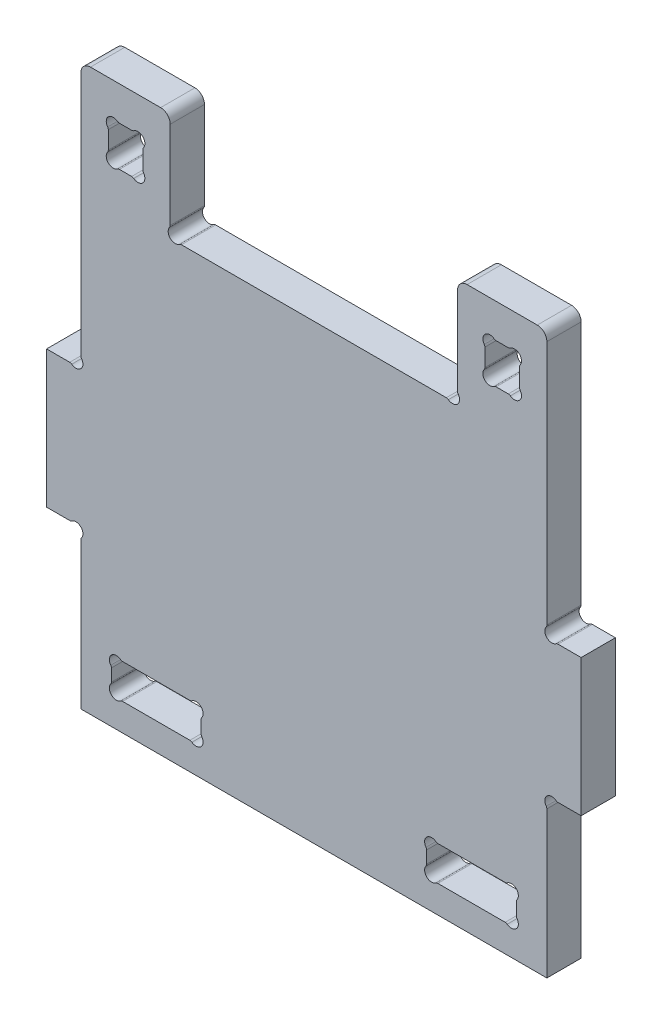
ISO-10303-21;
HEADER;
FILE_DESCRIPTION(('STEP AP214'),'2;1');
FILE_NAME('part.step','',(''),(''),'','','');
FILE_SCHEMA(('AUTOMOTIVE_DESIGN { 1 0 10303 214 1 1 1 1 }'));
ENDSEC;
DATA;
#1=APPLICATION_CONTEXT('core data for automotive mechanical design processes');
#2=APPLICATION_PROTOCOL_DEFINITION('international standard','automotive_design',2000,#1);
#3=PRODUCT_CONTEXT('',#1,'mechanical');
#4=PRODUCT('Part','Part','',(#3));
#5=PRODUCT_RELATED_PRODUCT_CATEGORY('part','',(#4));
#6=PRODUCT_DEFINITION_FORMATION('','',#4);
#7=PRODUCT_DEFINITION_CONTEXT('part definition',#1,'design');
#8=PRODUCT_DEFINITION('design','',#6,#7);
#9=PRODUCT_DEFINITION_SHAPE('','',#8);
#10=(LENGTH_UNIT() NAMED_UNIT(*) SI_UNIT(.MILLI.,.METRE.));
#11=(NAMED_UNIT(*) PLANE_ANGLE_UNIT() SI_UNIT($,.RADIAN.));
#12=(NAMED_UNIT(*) SI_UNIT($,.STERADIAN.) SOLID_ANGLE_UNIT());
#13=UNCERTAINTY_MEASURE_WITH_UNIT(LENGTH_MEASURE(1.E-05),#10,'distance_accuracy_value','');
#14=(GEOMETRIC_REPRESENTATION_CONTEXT(3) GLOBAL_UNCERTAINTY_ASSIGNED_CONTEXT((#13)) GLOBAL_UNIT_ASSIGNED_CONTEXT((#10,
#11,#12)) REPRESENTATION_CONTEXT('',''));
#15=CARTESIAN_POINT('',(0.,0.,0.));
#16=DIRECTION('',(0.,0.,1.));
#17=DIRECTION('',(1.,0.,0.));
#18=AXIS2_PLACEMENT_3D('',#15,#16,#17);
#19=CARTESIAN_POINT('',(-167.500000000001,106.86895961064,25.));
#20=DIRECTION('',(0.,0.,-1.));
#21=DIRECTION('',(-1.,0.,0.));
#22=AXIS2_PLACEMENT_3D('',#19,#20,#21);
#23=PLANE('',#22);
#24=CARTESIAN_POINT('',(-132.931040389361,352.5,25.));
#25=DIRECTION('',(0.,0.,-1.));
#26=DIRECTION('',(1.,0.,0.));
#27=AXIS2_PLACEMENT_3D('',#24,#25,#26);
#28=CIRCLE('',#27,2.50000000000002);
#29=CARTESIAN_POINT('',(-132.931040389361,355.,25.));
#30=VERTEX_POINT('',#29);
#31=CARTESIAN_POINT('',(-131.442620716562,354.508633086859,25.));
#32=VERTEX_POINT('',#31);
#33=EDGE_CURVE('E1194',#30,#32,#28,.T.);
#34=ORIENTED_EDGE('',*,*,#33,.F.);
#35=DIRECTION('',(1.,0.,0.));
#36=VECTOR('',#35,1.);
#37=CARTESIAN_POINT('',(-141.86895961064,355.,25.));
#38=LINE('',#37,#36);
#39=CARTESIAN_POINT('',(-141.86895961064,355.,25.));
#40=VERTEX_POINT('',#39);
#41=EDGE_CURVE('E1226',#40,#30,#38,.T.);
#42=ORIENTED_EDGE('',*,*,#41,.F.);
#43=CARTESIAN_POINT('',(-141.86895961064,352.5,25.));
#44=DIRECTION('',(0.,0.,-1.));
#45=DIRECTION('',(-1.,0.,0.));
#46=AXIS2_PLACEMENT_3D('',#43,#44,#45);
#47=CIRCLE('',#46,2.50000000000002);
#48=CARTESIAN_POINT('',(-143.357379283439,354.508633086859,25.));
#49=VERTEX_POINT('',#48);
#50=EDGE_CURVE('E1223',#49,#40,#47,.T.);
#51=ORIENTED_EDGE('',*,*,#50,.F.);
#52=CARTESIAN_POINT('',(-146.393755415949,358.606244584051,25.));
#53=DIRECTION('',(0.,0.,1.));
#54=DIRECTION('',(-1.,0.,0.));
#55=AXIS2_PLACEMENT_3D('',#52,#53,#54);
#56=CIRCLE('',#55,5.10000000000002);
#57=CARTESIAN_POINT('',(-150.491366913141,361.642620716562,25.));
#58=VERTEX_POINT('',#57);
#59=EDGE_CURVE('E1221',#58,#49,#56,.T.);
#60=ORIENTED_EDGE('',*,*,#59,.F.);
#61=CARTESIAN_POINT('',(-152.500000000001,363.131040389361,25.));
#62=DIRECTION('',(0.,0.,-1.));
#63=DIRECTION('',(1.,0.,0.));
#64=AXIS2_PLACEMENT_3D('',#61,#62,#63);
#65=CIRCLE('',#64,2.50000000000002);
#66=CARTESIAN_POINT('',(-150.,363.131040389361,25.));
#67=VERTEX_POINT('',#66);
#68=EDGE_CURVE('E1219',#67,#58,#65,.T.);
#69=ORIENTED_EDGE('',*,*,#68,.F.);
#70=DIRECTION('',(0.,-1.,0.));
#71=VECTOR('',#70,1.);
#72=CARTESIAN_POINT('',(-150.,363.131040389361,25.));
#73=LINE('',#72,#71);
#74=CARTESIAN_POINT('',(-150.000000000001,376.035626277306,25.));
#75=VERTEX_POINT('',#74);
#76=EDGE_CURVE('E1217',#75,#67,#73,.T.);
#77=ORIENTED_EDGE('',*,*,#76,.F.);
#78=CARTESIAN_POINT('',(-152.500000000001,376.035626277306,25.));
#79=DIRECTION('',(0.,0.,-1.));
#80=DIRECTION('',(-1.,0.,0.));
#81=AXIS2_PLACEMENT_3D('',#78,#79,#80);
#82=CIRCLE('',#81,2.50000000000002);
#83=CARTESIAN_POINT('',(-150.491366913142,377.524045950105,25.));
#84=VERTEX_POINT('',#83);
#85=EDGE_CURVE('E1215',#84,#75,#82,.T.);
#86=ORIENTED_EDGE('',*,*,#85,.F.);
#87=CARTESIAN_POINT('',(-146.393755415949,380.560422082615,25.));
#88=DIRECTION('',(0.,0.,1.));
#89=DIRECTION('',(1.,0.,0.));
#90=AXIS2_PLACEMENT_3D('',#87,#88,#89);
#91=CIRCLE('',#90,5.10000000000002);
#92=CARTESIAN_POINT('',(-143.357379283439,384.658033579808,25.));
#93=VERTEX_POINT('',#92);
#94=EDGE_CURVE('E1213',#93,#84,#91,.T.);
#95=ORIENTED_EDGE('',*,*,#94,.F.);
#96=CARTESIAN_POINT('',(-141.86895961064,386.666666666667,25.));
#97=DIRECTION('',(0.,0.,-1.));
#98=DIRECTION('',(1.,0.,0.));
#99=AXIS2_PLACEMENT_3D('',#96,#97,#98);
#100=CIRCLE('',#99,2.50000000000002);
#101=CARTESIAN_POINT('',(-141.86895961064,384.166666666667,25.));
#102=VERTEX_POINT('',#101);
#103=EDGE_CURVE('E1211',#102,#93,#100,.T.);
#104=ORIENTED_EDGE('',*,*,#103,.F.);
#105=DIRECTION('',(-1.,0.,0.));
#106=VECTOR('',#105,1.);
#107=CARTESIAN_POINT('',(-141.86895961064,384.166666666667,25.));
#108=LINE('',#107,#106);
#109=CARTESIAN_POINT('',(-132.931040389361,384.166666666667,25.));
#110=VERTEX_POINT('',#109);
#111=EDGE_CURVE('E1209',#110,#102,#108,.T.);
#112=ORIENTED_EDGE('',*,*,#111,.F.);
#113=CARTESIAN_POINT('',(-132.931040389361,386.666666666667,25.));
#114=DIRECTION('',(0.,0.,-1.));
#115=DIRECTION('',(-1.,0.,0.));
#116=AXIS2_PLACEMENT_3D('',#113,#114,#115);
#117=CIRCLE('',#116,2.50000000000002);
#118=CARTESIAN_POINT('',(-131.442620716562,384.658033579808,25.));
#119=VERTEX_POINT('',#118);
#120=EDGE_CURVE('E1207',#119,#110,#117,.T.);
#121=ORIENTED_EDGE('',*,*,#120,.F.);
#122=CARTESIAN_POINT('',(-128.406244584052,380.560422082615,25.));
#123=DIRECTION('',(0.,0.,1.));
#124=DIRECTION('',(-1.,0.,0.));
#125=AXIS2_PLACEMENT_3D('',#122,#123,#124);
#126=CIRCLE('',#125,5.10000000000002);
#127=CARTESIAN_POINT('',(-124.30863308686,377.524045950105,25.));
#128=VERTEX_POINT('',#127);
#129=EDGE_CURVE('E1205',#128,#119,#126,.T.);
#130=ORIENTED_EDGE('',*,*,#129,.F.);
#131=CARTESIAN_POINT('',(-122.300000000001,376.035626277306,25.));
#132=DIRECTION('',(0.,0.,-1.));
#133=DIRECTION('',(1.,0.,0.));
#134=AXIS2_PLACEMENT_3D('',#131,#132,#133);
#135=CIRCLE('',#134,2.50000000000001);
#136=CARTESIAN_POINT('',(-124.800000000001,376.035626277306,25.));
#137=VERTEX_POINT('',#136);
#138=EDGE_CURVE('E1203',#137,#128,#135,.T.);
#139=ORIENTED_EDGE('',*,*,#138,.F.);
#140=DIRECTION('',(0.,1.,0.));
#141=VECTOR('',#140,1.);
#142=CARTESIAN_POINT('',(-124.800000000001,363.131040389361,25.));
#143=LINE('',#142,#141);
#144=CARTESIAN_POINT('',(-124.800000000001,363.131040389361,25.));
#145=VERTEX_POINT('',#144);
#146=EDGE_CURVE('E1201',#145,#137,#143,.T.);
#147=ORIENTED_EDGE('',*,*,#146,.F.);
#148=CARTESIAN_POINT('',(-122.300000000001,363.131040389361,25.));
#149=DIRECTION('',(0.,0.,-1.));
#150=DIRECTION('',(-1.,0.,0.));
#151=AXIS2_PLACEMENT_3D('',#148,#149,#150);
#152=CIRCLE('',#151,2.50000000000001);
#153=CARTESIAN_POINT('',(-124.30863308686,361.642620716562,25.));
#154=VERTEX_POINT('',#153);
#155=EDGE_CURVE('E1199',#154,#145,#152,.T.);
#156=ORIENTED_EDGE('',*,*,#155,.F.);
#157=CARTESIAN_POINT('',(-128.406244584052,358.606244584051,25.));
#158=DIRECTION('',(0.,0.,1.));
#159=DIRECTION('',(1.,0.,0.));
#160=AXIS2_PLACEMENT_3D('',#157,#158,#159);
#161=CIRCLE('',#160,5.10000000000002);
#162=EDGE_CURVE('E1196',#32,#154,#161,.T.);
#163=ORIENTED_EDGE('',*,*,#162,.F.);
#164=EDGE_LOOP('',(#34,#42,#51,#60,#69,#77,#86,#95,#104,#112,#121,#130,#139,#147,#156,#163));
#165=FACE_BOUND('',#164,.T.);
#166=DIRECTION('',(0.,1.,0.));
#167=VECTOR('',#166,1.);
#168=CARTESIAN_POINT('',(-104.800000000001,338.13104038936,25.));
#169=LINE('',#168,#167);
#170=CARTESIAN_POINT('',(-104.800000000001,338.13104038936,25.));
#171=VERTEX_POINT('',#170);
#172=CARTESIAN_POINT('',(-104.800000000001,402.066666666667,25.));
#173=VERTEX_POINT('',#172);
#174=EDGE_CURVE('E1318',#171,#173,#169,.T.);
#175=ORIENTED_EDGE('',*,*,#174,.T.);
#176=CARTESIAN_POINT('',(-111.800000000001,402.066666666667,25.));
#177=DIRECTION('',(0.,0.,-1.));
#178=DIRECTION('',(-1.,0.,0.));
#179=AXIS2_PLACEMENT_3D('',#176,#177,#178);
#180=CIRCLE('',#179,7.);
#181=CARTESIAN_POINT('',(-111.800000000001,409.066666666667,25.));
#182=VERTEX_POINT('',#181);
#183=EDGE_CURVE('E41',#173,#182,#180,.F.);
#184=ORIENTED_EDGE('',*,*,#183,.T.);
#185=DIRECTION('',(-1.,0.,0.));
#186=VECTOR('',#185,1.);
#187=CARTESIAN_POINT('',(-170.000000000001,409.066666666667,25.));
#188=LINE('',#187,#186);
#189=CARTESIAN_POINT('',(-163.000000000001,409.066666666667,25.));
#190=VERTEX_POINT('',#189);
#191=EDGE_CURVE('E1320',#182,#190,#188,.T.);
#192=ORIENTED_EDGE('',*,*,#191,.T.);
#193=CARTESIAN_POINT('',(-163.000000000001,402.066666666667,25.));
#194=DIRECTION('',(0.,0.,-1.));
#195=DIRECTION('',(-1.,0.,0.));
#196=AXIS2_PLACEMENT_3D('',#193,#194,#195);
#197=CIRCLE('',#196,7.);
#198=CARTESIAN_POINT('',(-170.000000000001,402.066666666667,25.));
#199=VERTEX_POINT('',#198);
#200=EDGE_CURVE('E48',#190,#199,#197,.F.);
#201=ORIENTED_EDGE('',*,*,#200,.T.);
#202=DIRECTION('',(0.,-1.,0.));
#203=VECTOR('',#202,1.);
#204=CARTESIAN_POINT('',(-170.,223.131040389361,25.));
#205=LINE('',#204,#203);
#206=CARTESIAN_POINT('',(-170.000000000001,223.131040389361,25.));
#207=VERTEX_POINT('',#206);
#208=EDGE_CURVE('E1322',#199,#207,#205,.T.);
#209=ORIENTED_EDGE('',*,*,#208,.T.);
#210=CARTESIAN_POINT('',(-167.500000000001,223.131040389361,25.));
#211=DIRECTION('',(0.,0.,1.));
#212=DIRECTION('',(-1.,0.,0.));
#213=AXIS2_PLACEMENT_3D('',#210,#211,#212);
#214=CIRCLE('',#213,2.49999999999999);
#215=CARTESIAN_POINT('',(-169.508633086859,221.642620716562,25.));
#216=VERTEX_POINT('',#215);
#217=EDGE_CURVE('E1324',#207,#216,#214,.T.);
#218=ORIENTED_EDGE('',*,*,#217,.T.);
#219=CARTESIAN_POINT('',(-173.606244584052,218.606244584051,25.));
#220=DIRECTION('',(0.,0.,-1.));
#221=DIRECTION('',(1.,0.,0.));
#222=AXIS2_PLACEMENT_3D('',#219,#220,#221);
#223=CIRCLE('',#222,5.1);
#224=CARTESIAN_POINT('',(-176.642620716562,214.508633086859,25.));
#225=VERTEX_POINT('',#224);
#226=EDGE_CURVE('E1326',#216,#225,#223,.T.);
#227=ORIENTED_EDGE('',*,*,#226,.T.);
#228=CARTESIAN_POINT('',(-178.131040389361,212.5,25.));
#229=DIRECTION('',(0.,0.,1.));
#230=DIRECTION('',(-1.,0.,0.));
#231=AXIS2_PLACEMENT_3D('',#228,#229,#230);
#232=CIRCLE('',#231,2.49999999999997);
#233=CARTESIAN_POINT('',(-178.131040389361,215.,25.));
#234=VERTEX_POINT('',#233);
#235=EDGE_CURVE('E1328',#225,#234,#232,.T.);
#236=ORIENTED_EDGE('',*,*,#235,.T.);
#237=DIRECTION('',(-1.,0.,0.));
#238=VECTOR('',#237,1.);
#239=CARTESIAN_POINT('',(-178.131040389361,215.,25.));
#240=LINE('',#239,#238);
#241=CARTESIAN_POINT('',(-195.,215.,25.));
#242=VERTEX_POINT('',#241);
#243=EDGE_CURVE('E1330',#234,#242,#240,.T.);
#244=ORIENTED_EDGE('',*,*,#243,.T.);
#245=DIRECTION('',(0.,-1.,0.));
#246=VECTOR('',#245,1.);
#247=CARTESIAN_POINT('',(-195.,115.,25.));
#248=LINE('',#247,#246);
#249=CARTESIAN_POINT('',(-195.,115.,25.));
#250=VERTEX_POINT('',#249);
#251=EDGE_CURVE('E1332',#242,#250,#248,.T.);
#252=ORIENTED_EDGE('',*,*,#251,.T.);
#253=DIRECTION('',(1.,0.,0.));
#254=VECTOR('',#253,1.);
#255=CARTESIAN_POINT('',(-178.131040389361,115.,25.));
#256=LINE('',#255,#254);
#257=CARTESIAN_POINT('',(-178.131040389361,115.,25.));
#258=VERTEX_POINT('',#257);
#259=EDGE_CURVE('E1334',#250,#258,#256,.T.);
#260=ORIENTED_EDGE('',*,*,#259,.T.);
#261=CARTESIAN_POINT('',(-178.131040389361,117.5,25.));
#262=DIRECTION('',(0.,0.,1.));
#263=DIRECTION('',(-1.,0.,0.));
#264=AXIS2_PLACEMENT_3D('',#261,#262,#263);
#265=CIRCLE('',#264,2.50000000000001);
#266=CARTESIAN_POINT('',(-176.642620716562,115.491366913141,25.));
#267=VERTEX_POINT('',#266);
#268=EDGE_CURVE('E1336',#258,#267,#265,.T.);
#269=ORIENTED_EDGE('',*,*,#268,.T.);
#270=CARTESIAN_POINT('',(-173.606244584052,111.393755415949,25.));
#271=DIRECTION('',(0.,0.,-1.));
#272=DIRECTION('',(1.,0.,0.));
#273=AXIS2_PLACEMENT_3D('',#270,#271,#272);
#274=CIRCLE('',#273,5.1);
#275=CARTESIAN_POINT('',(-169.50863308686,108.357379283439,25.));
#276=VERTEX_POINT('',#275);
#277=EDGE_CURVE('E1338',#267,#276,#274,.T.);
#278=ORIENTED_EDGE('',*,*,#277,.T.);
#279=CARTESIAN_POINT('',(-167.500000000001,106.86895961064,25.));
#280=DIRECTION('',(0.,0.,1.));
#281=DIRECTION('',(-1.,0.,0.));
#282=AXIS2_PLACEMENT_3D('',#279,#280,#281);
#283=CIRCLE('',#282,2.49999999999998);
#284=CARTESIAN_POINT('',(-170.,106.86895961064,25.));
#285=VERTEX_POINT('',#284);
#286=EDGE_CURVE('E1340',#276,#285,#283,.T.);
#287=ORIENTED_EDGE('',*,*,#286,.T.);
#288=DIRECTION('',(0.,-1.,0.));
#289=VECTOR('',#288,1.);
#290=CARTESIAN_POINT('',(-170.,106.86895961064,25.));
#291=LINE('',#290,#289);
#292=CARTESIAN_POINT('',(-170.,0.,25.));
#293=VERTEX_POINT('',#292);
#294=EDGE_CURVE('E1342',#285,#293,#291,.T.);
#295=ORIENTED_EDGE('',*,*,#294,.T.);
#296=DIRECTION('',(1.,0.,0.));
#297=VECTOR('',#296,1.);
#298=CARTESIAN_POINT('',(0.,0.,25.));
#299=LINE('',#298,#297);
#300=CARTESIAN_POINT('',(170.,0.,25.));
#301=VERTEX_POINT('',#300);
#302=EDGE_CURVE('E1344',#293,#301,#299,.T.);
#303=ORIENTED_EDGE('',*,*,#302,.T.);
#304=DIRECTION('',(0.,-1.,0.));
#305=VECTOR('',#304,1.);
#306=CARTESIAN_POINT('',(170.,106.86895961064,25.));
#307=LINE('',#306,#305);
#308=CARTESIAN_POINT('',(170.,106.86895961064,25.));
#309=VERTEX_POINT('',#308);
#310=EDGE_CURVE('E977',#309,#301,#307,.T.);
#311=ORIENTED_EDGE('',*,*,#310,.F.);
#312=CARTESIAN_POINT('',(167.500000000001,106.86895961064,25.));
#313=DIRECTION('',(0.,0.,-1.));
#314=DIRECTION('',(1.,0.,0.));
#315=AXIS2_PLACEMENT_3D('',#312,#313,#314);
#316=CIRCLE('',#315,2.49999999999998);
#317=CARTESIAN_POINT('',(169.50863308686,108.357379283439,25.));
#318=VERTEX_POINT('',#317);
#319=EDGE_CURVE('E974',#318,#309,#316,.T.);
#320=ORIENTED_EDGE('',*,*,#319,.F.);
#321=CARTESIAN_POINT('',(173.606244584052,111.393755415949,25.));
#322=DIRECTION('',(0.,0.,1.));
#323=DIRECTION('',(-1.,0.,0.));
#324=AXIS2_PLACEMENT_3D('',#321,#322,#323);
#325=CIRCLE('',#324,5.1);
#326=CARTESIAN_POINT('',(176.642620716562,115.491366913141,25.));
#327=VERTEX_POINT('',#326);
#328=EDGE_CURVE('E971',#327,#318,#325,.T.);
#329=ORIENTED_EDGE('',*,*,#328,.F.);
#330=CARTESIAN_POINT('',(178.131040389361,117.5,25.));
#331=DIRECTION('',(0.,0.,-1.));
#332=DIRECTION('',(1.,0.,0.));
#333=AXIS2_PLACEMENT_3D('',#330,#331,#332);
#334=CIRCLE('',#333,2.50000000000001);
#335=CARTESIAN_POINT('',(178.131040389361,115.,25.));
#336=VERTEX_POINT('',#335);
#337=EDGE_CURVE('E968',#336,#327,#334,.T.);
#338=ORIENTED_EDGE('',*,*,#337,.F.);
#339=DIRECTION('',(-1.,0.,0.));
#340=VECTOR('',#339,1.);
#341=CARTESIAN_POINT('',(178.131040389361,115.,25.));
#342=LINE('',#341,#340);
#343=CARTESIAN_POINT('',(195.,115.,25.));
#344=VERTEX_POINT('',#343);
#345=EDGE_CURVE('E965',#344,#336,#342,.T.);
#346=ORIENTED_EDGE('',*,*,#345,.F.);
#347=DIRECTION('',(0.,-1.,0.));
#348=VECTOR('',#347,1.);
#349=CARTESIAN_POINT('',(195.,115.,25.));
#350=LINE('',#349,#348);
#351=CARTESIAN_POINT('',(195.,215.,25.));
#352=VERTEX_POINT('',#351);
#353=EDGE_CURVE('E962',#352,#344,#350,.T.);
#354=ORIENTED_EDGE('',*,*,#353,.F.);
#355=DIRECTION('',(1.,0.,0.));
#356=VECTOR('',#355,1.);
#357=CARTESIAN_POINT('',(178.131040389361,215.,25.));
#358=LINE('',#357,#356);
#359=CARTESIAN_POINT('',(178.131040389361,215.,25.));
#360=VERTEX_POINT('',#359);
#361=EDGE_CURVE('E959',#360,#352,#358,.T.);
#362=ORIENTED_EDGE('',*,*,#361,.F.);
#363=CARTESIAN_POINT('',(178.131040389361,212.5,25.));
#364=DIRECTION('',(0.,0.,-1.));
#365=DIRECTION('',(1.,0.,0.));
#366=AXIS2_PLACEMENT_3D('',#363,#364,#365);
#367=CIRCLE('',#366,2.49999999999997);
#368=CARTESIAN_POINT('',(176.642620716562,214.508633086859,25.));
#369=VERTEX_POINT('',#368);
#370=EDGE_CURVE('E956',#369,#360,#367,.T.);
#371=ORIENTED_EDGE('',*,*,#370,.F.);
#372=CARTESIAN_POINT('',(173.606244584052,218.606244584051,25.));
#373=DIRECTION('',(0.,0.,1.));
#374=DIRECTION('',(-1.,0.,0.));
#375=AXIS2_PLACEMENT_3D('',#372,#373,#374);
#376=CIRCLE('',#375,5.1);
#377=CARTESIAN_POINT('',(169.508633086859,221.642620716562,25.));
#378=VERTEX_POINT('',#377);
#379=EDGE_CURVE('E953',#378,#369,#376,.T.);
#380=ORIENTED_EDGE('',*,*,#379,.F.);
#381=CARTESIAN_POINT('',(167.500000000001,223.131040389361,25.));
#382=DIRECTION('',(0.,0.,-1.));
#383=DIRECTION('',(1.,0.,0.));
#384=AXIS2_PLACEMENT_3D('',#381,#382,#383);
#385=CIRCLE('',#384,2.49999999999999);
#386=CARTESIAN_POINT('',(170.000000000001,223.131040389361,25.));
#387=VERTEX_POINT('',#386);
#388=EDGE_CURVE('E950',#387,#378,#385,.T.);
#389=ORIENTED_EDGE('',*,*,#388,.F.);
#390=DIRECTION('',(0.,-1.,0.));
#391=VECTOR('',#390,1.);
#392=CARTESIAN_POINT('',(170.,223.131040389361,25.));
#393=LINE('',#392,#391);
#394=CARTESIAN_POINT('',(170.000000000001,402.066666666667,25.));
#395=VERTEX_POINT('',#394);
#396=EDGE_CURVE('E947',#395,#387,#393,.T.);
#397=ORIENTED_EDGE('',*,*,#396,.F.);
#398=CARTESIAN_POINT('',(163.000000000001,402.066666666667,25.));
#399=DIRECTION('',(0.,0.,1.));
#400=DIRECTION('',(1.,0.,0.));
#401=AXIS2_PLACEMENT_3D('',#398,#399,#400);
#402=CIRCLE('',#401,7.);
#403=CARTESIAN_POINT('',(163.000000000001,409.066666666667,25.));
#404=VERTEX_POINT('',#403);
#405=EDGE_CURVE('E1070',#404,#395,#402,.F.);
#406=ORIENTED_EDGE('',*,*,#405,.F.);
#407=DIRECTION('',(1.,0.,0.));
#408=VECTOR('',#407,1.);
#409=CARTESIAN_POINT('',(170.000000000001,409.066666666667,25.));
#410=LINE('',#409,#408);
#411=CARTESIAN_POINT('',(111.800000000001,409.066666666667,25.));
#412=VERTEX_POINT('',#411);
#413=EDGE_CURVE('E944',#412,#404,#410,.T.);
#414=ORIENTED_EDGE('',*,*,#413,.F.);
#415=CARTESIAN_POINT('',(111.800000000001,402.066666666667,25.));
#416=DIRECTION('',(0.,0.,1.));
#417=DIRECTION('',(1.,0.,0.));
#418=AXIS2_PLACEMENT_3D('',#415,#416,#417);
#419=CIRCLE('',#418,7.);
#420=CARTESIAN_POINT('',(104.800000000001,402.066666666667,25.));
#421=VERTEX_POINT('',#420);
#422=EDGE_CURVE('E1073',#421,#412,#419,.F.);
#423=ORIENTED_EDGE('',*,*,#422,.F.);
#424=DIRECTION('',(0.,1.,0.));
#425=VECTOR('',#424,1.);
#426=CARTESIAN_POINT('',(104.800000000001,338.13104038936,25.));
#427=LINE('',#426,#425);
#428=CARTESIAN_POINT('',(104.800000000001,338.13104038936,25.));
#429=VERTEX_POINT('',#428);
#430=EDGE_CURVE('E941',#429,#421,#427,.T.);
#431=ORIENTED_EDGE('',*,*,#430,.F.);
#432=CARTESIAN_POINT('',(107.300000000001,338.13104038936,25.));
#433=DIRECTION('',(0.,0.,-1.));
#434=DIRECTION('',(1.,0.,0.));
#435=AXIS2_PLACEMENT_3D('',#432,#433,#434);
#436=CIRCLE('',#435,2.5);
#437=CARTESIAN_POINT('',(105.291366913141,336.642620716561,25.));
#438=VERTEX_POINT('',#437);
#439=EDGE_CURVE('E938',#438,#429,#436,.T.);
#440=ORIENTED_EDGE('',*,*,#439,.F.);
#441=CARTESIAN_POINT('',(101.193755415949,333.606244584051,25.));
#442=DIRECTION('',(0.,0.,1.));
#443=DIRECTION('',(-1.,0.,0.));
#444=AXIS2_PLACEMENT_3D('',#441,#442,#443);
#445=CIRCLE('',#444,5.1);
#446=CARTESIAN_POINT('',(98.1573792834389,329.508633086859,25.));
#447=VERTEX_POINT('',#446);
#448=EDGE_CURVE('E934',#447,#438,#445,.T.);
#449=ORIENTED_EDGE('',*,*,#448,.F.);
#450=CARTESIAN_POINT('',(96.6689596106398,327.5,25.));
#451=DIRECTION('',(0.,0.,-1.));
#452=DIRECTION('',(1.,0.,0.));
#453=AXIS2_PLACEMENT_3D('',#450,#451,#452);
#454=CIRCLE('',#453,2.50000000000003);
#455=CARTESIAN_POINT('',(96.6689596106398,330.,25.));
#456=VERTEX_POINT('',#455);
#457=EDGE_CURVE('E931',#456,#447,#454,.T.);
#458=ORIENTED_EDGE('',*,*,#457,.F.);
#459=DIRECTION('',(-1.,0.,0.));
#460=VECTOR('',#459,1.);
#461=CARTESIAN_POINT('',(-96.6689596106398,330.,25.));
#462=LINE('',#461,#460);
#463=CARTESIAN_POINT('',(-96.6689596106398,330.,25.));
#464=VERTEX_POINT('',#463);
#465=EDGE_CURVE('E1309',#456,#464,#462,.T.);
#466=ORIENTED_EDGE('',*,*,#465,.T.);
#467=CARTESIAN_POINT('',(-96.6689596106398,327.5,25.));
#468=DIRECTION('',(0.,0.,1.));
#469=DIRECTION('',(-1.,0.,0.));
#470=AXIS2_PLACEMENT_3D('',#467,#468,#469);
#471=CIRCLE('',#470,2.50000000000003);
#472=CARTESIAN_POINT('',(-98.1573792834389,329.508633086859,25.));
#473=VERTEX_POINT('',#472);
#474=EDGE_CURVE('E1311',#464,#473,#471,.T.);
#475=ORIENTED_EDGE('',*,*,#474,.T.);
#476=CARTESIAN_POINT('',(-101.193755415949,333.606244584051,25.));
#477=DIRECTION('',(0.,0.,-1.));
#478=DIRECTION('',(1.,0.,0.));
#479=AXIS2_PLACEMENT_3D('',#476,#477,#478);
#480=CIRCLE('',#479,5.1);
#481=CARTESIAN_POINT('',(-105.291366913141,336.642620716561,25.));
#482=VERTEX_POINT('',#481);
#483=EDGE_CURVE('E1314',#473,#482,#480,.T.);
#484=ORIENTED_EDGE('',*,*,#483,.T.);
#485=CARTESIAN_POINT('',(-107.300000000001,338.13104038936,25.));
#486=DIRECTION('',(0.,0.,1.));
#487=DIRECTION('',(-1.,0.,0.));
#488=AXIS2_PLACEMENT_3D('',#485,#486,#487);
#489=CIRCLE('',#488,2.5);
#490=EDGE_CURVE('E1316',#482,#171,#489,.T.);
#491=ORIENTED_EDGE('',*,*,#490,.T.);
#492=EDGE_LOOP('',(#175,#184,#192,#201,#209,#218,#227,#236,#244,#252,#260,#269,#278,#287,#295,
#303,#311,#320,#329,#338,#346,#354,#362,#371,#380,#389,#397,#406,#414,#423,#431,#440,#449,#458,
#466,#475,#484,#491));
#493=FACE_BOUND('',#492,.T.);
#494=CARTESIAN_POINT('',(-90.431040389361,17.5,25.));
#495=DIRECTION('',(0.,0.,-1.));
#496=DIRECTION('',(1.,0.,0.));
#497=AXIS2_PLACEMENT_3D('',#494,#495,#496);
#498=CIRCLE('',#497,2.5);
#499=CARTESIAN_POINT('',(-90.431040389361,20.,25.));
#500=VERTEX_POINT('',#499);
#501=CARTESIAN_POINT('',(-88.9426207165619,19.508633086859,25.));
#502=VERTEX_POINT('',#501);
#503=EDGE_CURVE('E1079',#500,#502,#498,.T.);
#504=ORIENTED_EDGE('',*,*,#503,.F.);
#505=DIRECTION('',(1.,0.,0.));
#506=VECTOR('',#505,1.);
#507=CARTESIAN_POINT('',(-139.56895961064,20.,25.));
#508=LINE('',#507,#506);
#509=CARTESIAN_POINT('',(-139.56895961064,20.,25.));
#510=VERTEX_POINT('',#509);
#511=EDGE_CURVE('E1111',#510,#500,#508,.T.);
#512=ORIENTED_EDGE('',*,*,#511,.F.);
#513=CARTESIAN_POINT('',(-139.56895961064,17.5,25.));
#514=DIRECTION('',(0.,0.,-1.));
#515=DIRECTION('',(-1.,0.,0.));
#516=AXIS2_PLACEMENT_3D('',#513,#514,#515);
#517=CIRCLE('',#516,2.50000000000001);
#518=CARTESIAN_POINT('',(-141.057379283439,19.508633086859,25.));
#519=VERTEX_POINT('',#518);
#520=EDGE_CURVE('E1108',#519,#510,#517,.T.);
#521=ORIENTED_EDGE('',*,*,#520,.F.);
#522=CARTESIAN_POINT('',(-144.093755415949,23.6062445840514,25.));
#523=DIRECTION('',(0.,0.,1.));
#524=DIRECTION('',(-1.,0.,0.));
#525=AXIS2_PLACEMENT_3D('',#522,#523,#524);
#526=CIRCLE('',#525,5.09999999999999);
#527=CARTESIAN_POINT('',(-148.191366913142,26.6426207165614,25.));
#528=VERTEX_POINT('',#527);
#529=EDGE_CURVE('E1106',#528,#519,#526,.T.);
#530=ORIENTED_EDGE('',*,*,#529,.F.);
#531=CARTESIAN_POINT('',(-150.200000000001,28.1310403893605,25.));
#532=DIRECTION('',(0.,0.,-1.));
#533=DIRECTION('',(1.,0.,0.));
#534=AXIS2_PLACEMENT_3D('',#531,#532,#533);
#535=CIRCLE('',#534,2.49999999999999);
#536=CARTESIAN_POINT('',(-147.700000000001,28.1310403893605,25.));
#537=VERTEX_POINT('',#536);
#538=EDGE_CURVE('E1104',#537,#528,#535,.T.);
#539=ORIENTED_EDGE('',*,*,#538,.F.);
#540=DIRECTION('',(0.,-1.,0.));
#541=VECTOR('',#540,1.);
#542=CARTESIAN_POINT('',(-147.700000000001,28.1310403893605,25.));
#543=LINE('',#542,#541);
#544=CARTESIAN_POINT('',(-147.700000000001,37.0689596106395,25.));
#545=VERTEX_POINT('',#544);
#546=EDGE_CURVE('E1102',#545,#537,#543,.T.);
#547=ORIENTED_EDGE('',*,*,#546,.F.);
#548=CARTESIAN_POINT('',(-150.200000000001,37.0689596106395,25.));
#549=DIRECTION('',(0.,0.,-1.));
#550=DIRECTION('',(-1.,0.,0.));
#551=AXIS2_PLACEMENT_3D('',#548,#549,#550);
#552=CIRCLE('',#551,2.49999999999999);
#553=CARTESIAN_POINT('',(-148.191366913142,38.5573792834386,25.));
#554=VERTEX_POINT('',#553);
#555=EDGE_CURVE('E1100',#554,#545,#552,.T.);
#556=ORIENTED_EDGE('',*,*,#555,.F.);
#557=CARTESIAN_POINT('',(-144.093755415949,41.5937554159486,25.));
#558=DIRECTION('',(0.,0.,1.));
#559=DIRECTION('',(1.,0.,0.));
#560=AXIS2_PLACEMENT_3D('',#557,#558,#559);
#561=CIRCLE('',#560,5.1);
#562=CARTESIAN_POINT('',(-141.057379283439,45.691366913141,25.));
#563=VERTEX_POINT('',#562);
#564=EDGE_CURVE('E1098',#563,#554,#561,.T.);
#565=ORIENTED_EDGE('',*,*,#564,.F.);
#566=CARTESIAN_POINT('',(-139.56895961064,47.7,25.));
#567=DIRECTION('',(0.,0.,-1.));
#568=DIRECTION('',(1.,0.,0.));
#569=AXIS2_PLACEMENT_3D('',#566,#567,#568);
#570=CIRCLE('',#569,2.50000000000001);
#571=CARTESIAN_POINT('',(-139.56895961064,45.2,25.));
#572=VERTEX_POINT('',#571);
#573=EDGE_CURVE('E1096',#572,#563,#570,.T.);
#574=ORIENTED_EDGE('',*,*,#573,.F.);
#575=DIRECTION('',(-1.,0.,0.));
#576=VECTOR('',#575,1.);
#577=CARTESIAN_POINT('',(-139.56895961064,45.2,25.));
#578=LINE('',#577,#576);
#579=CARTESIAN_POINT('',(-90.431040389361,45.2,25.));
#580=VERTEX_POINT('',#579);
#581=EDGE_CURVE('E1094',#580,#572,#578,.T.);
#582=ORIENTED_EDGE('',*,*,#581,.F.);
#583=CARTESIAN_POINT('',(-90.431040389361,47.7,25.));
#584=DIRECTION('',(0.,0.,-1.));
#585=DIRECTION('',(-1.,0.,0.));
#586=AXIS2_PLACEMENT_3D('',#583,#584,#585);
#587=CIRCLE('',#586,2.5);
#588=CARTESIAN_POINT('',(-88.9426207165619,45.691366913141,25.));
#589=VERTEX_POINT('',#588);
#590=EDGE_CURVE('E1092',#589,#580,#587,.T.);
#591=ORIENTED_EDGE('',*,*,#590,.F.);
#592=CARTESIAN_POINT('',(-85.9062445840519,41.5937554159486,25.));
#593=DIRECTION('',(0.,0.,1.));
#594=DIRECTION('',(-1.,0.,0.));
#595=AXIS2_PLACEMENT_3D('',#592,#593,#594);
#596=CIRCLE('',#595,5.1);
#597=CARTESIAN_POINT('',(-81.8086330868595,38.5573792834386,25.));
#598=VERTEX_POINT('',#597);
#599=EDGE_CURVE('E1090',#598,#589,#596,.T.);
#600=ORIENTED_EDGE('',*,*,#599,.F.);
#601=CARTESIAN_POINT('',(-79.8000000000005,37.0689596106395,25.));
#602=DIRECTION('',(0.,0.,-1.));
#603=DIRECTION('',(1.,0.,0.));
#604=AXIS2_PLACEMENT_3D('',#601,#602,#603);
#605=CIRCLE('',#604,2.5);
#606=CARTESIAN_POINT('',(-82.3000000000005,37.0689596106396,25.));
#607=VERTEX_POINT('',#606);
#608=EDGE_CURVE('E1088',#607,#598,#605,.T.);
#609=ORIENTED_EDGE('',*,*,#608,.F.);
#610=DIRECTION('',(0.,1.,0.));
#611=VECTOR('',#610,1.);
#612=CARTESIAN_POINT('',(-82.3000000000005,28.1310403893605,25.));
#613=LINE('',#612,#611);
#614=CARTESIAN_POINT('',(-82.3000000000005,28.1310403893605,25.));
#615=VERTEX_POINT('',#614);
#616=EDGE_CURVE('E1086',#615,#607,#613,.T.);
#617=ORIENTED_EDGE('',*,*,#616,.F.);
#618=CARTESIAN_POINT('',(-79.8000000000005,28.1310403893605,25.));
#619=DIRECTION('',(0.,0.,-1.));
#620=DIRECTION('',(-1.,0.,0.));
#621=AXIS2_PLACEMENT_3D('',#618,#619,#620);
#622=CIRCLE('',#621,2.5);
#623=CARTESIAN_POINT('',(-81.8086330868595,26.6426207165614,25.));
#624=VERTEX_POINT('',#623);
#625=EDGE_CURVE('E1084',#624,#615,#622,.T.);
#626=ORIENTED_EDGE('',*,*,#625,.F.);
#627=CARTESIAN_POINT('',(-85.9062445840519,23.6062445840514,25.));
#628=DIRECTION('',(0.,0.,1.));
#629=DIRECTION('',(1.,0.,0.));
#630=AXIS2_PLACEMENT_3D('',#627,#628,#629);
#631=CIRCLE('',#630,5.1);
#632=EDGE_CURVE('E1081',#502,#624,#631,.T.);
#633=ORIENTED_EDGE('',*,*,#632,.F.);
#634=EDGE_LOOP('',(#504,#512,#521,#530,#539,#547,#556,#565,#574,#582,#591,#600,#609,#617,#626,#633));
#635=FACE_BOUND('',#634,.T.);
#636=CARTESIAN_POINT('',(132.931040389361,352.5,25.));
#637=DIRECTION('',(0.,0.,1.));
#638=DIRECTION('',(-1.,0.,0.));
#639=AXIS2_PLACEMENT_3D('',#636,#637,#638);
#640=CIRCLE('',#639,2.50000000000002);
#641=CARTESIAN_POINT('',(132.931040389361,355.,25.));
#642=VERTEX_POINT('',#641);
#643=CARTESIAN_POINT('',(131.442620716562,354.508633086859,25.));
#644=VERTEX_POINT('',#643);
#645=EDGE_CURVE('E803',#642,#644,#640,.T.);
#646=ORIENTED_EDGE('',*,*,#645,.T.);
#647=CARTESIAN_POINT('',(128.406244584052,358.606244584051,25.));
#648=DIRECTION('',(0.,0.,-1.));
#649=DIRECTION('',(-1.,0.,0.));
#650=AXIS2_PLACEMENT_3D('',#647,#648,#649);
#651=CIRCLE('',#650,5.10000000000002);
#652=CARTESIAN_POINT('',(124.30863308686,361.642620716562,25.));
#653=VERTEX_POINT('',#652);
#654=EDGE_CURVE('E806',#644,#653,#651,.T.);
#655=ORIENTED_EDGE('',*,*,#654,.T.);
#656=CARTESIAN_POINT('',(122.300000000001,363.131040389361,25.));
#657=DIRECTION('',(0.,0.,1.));
#658=DIRECTION('',(1.,0.,0.));
#659=AXIS2_PLACEMENT_3D('',#656,#657,#658);
#660=CIRCLE('',#659,2.50000000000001);
#661=CARTESIAN_POINT('',(124.800000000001,363.131040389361,25.));
#662=VERTEX_POINT('',#661);
#663=EDGE_CURVE('E810',#653,#662,#660,.T.);
#664=ORIENTED_EDGE('',*,*,#663,.T.);
#665=DIRECTION('',(0.,1.,0.));
#666=VECTOR('',#665,1.);
#667=CARTESIAN_POINT('',(124.800000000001,363.131040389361,25.));
#668=LINE('',#667,#666);
#669=CARTESIAN_POINT('',(124.800000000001,376.035626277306,25.));
#670=VERTEX_POINT('',#669);
#671=EDGE_CURVE('E813',#662,#670,#668,.T.);
#672=ORIENTED_EDGE('',*,*,#671,.T.);
#673=CARTESIAN_POINT('',(122.300000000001,376.035626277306,25.));
#674=DIRECTION('',(0.,0.,1.));
#675=DIRECTION('',(-1.,0.,0.));
#676=AXIS2_PLACEMENT_3D('',#673,#674,#675);
#677=CIRCLE('',#676,2.50000000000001);
#678=CARTESIAN_POINT('',(124.30863308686,377.524045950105,25.));
#679=VERTEX_POINT('',#678);
#680=EDGE_CURVE('E816',#670,#679,#677,.T.);
#681=ORIENTED_EDGE('',*,*,#680,.T.);
#682=CARTESIAN_POINT('',(128.406244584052,380.560422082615,25.));
#683=DIRECTION('',(0.,0.,-1.));
#684=DIRECTION('',(1.,0.,0.));
#685=AXIS2_PLACEMENT_3D('',#682,#683,#684);
#686=CIRCLE('',#685,5.10000000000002);
#687=CARTESIAN_POINT('',(131.442620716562,384.658033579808,25.));
#688=VERTEX_POINT('',#687);
#689=EDGE_CURVE('E819',#679,#688,#686,.T.);
#690=ORIENTED_EDGE('',*,*,#689,.T.);
#691=CARTESIAN_POINT('',(132.931040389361,386.666666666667,25.));
#692=DIRECTION('',(0.,0.,1.));
#693=DIRECTION('',(1.,0.,0.));
#694=AXIS2_PLACEMENT_3D('',#691,#692,#693);
#695=CIRCLE('',#694,2.50000000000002);
#696=CARTESIAN_POINT('',(132.931040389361,384.166666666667,25.));
#697=VERTEX_POINT('',#696);
#698=EDGE_CURVE('E822',#688,#697,#695,.T.);
#699=ORIENTED_EDGE('',*,*,#698,.T.);
#700=DIRECTION('',(1.,0.,0.));
#701=VECTOR('',#700,1.);
#702=CARTESIAN_POINT('',(141.86895961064,384.166666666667,25.));
#703=LINE('',#702,#701);
#704=CARTESIAN_POINT('',(141.86895961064,384.166666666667,25.));
#705=VERTEX_POINT('',#704);
#706=EDGE_CURVE('E825',#697,#705,#703,.T.);
#707=ORIENTED_EDGE('',*,*,#706,.T.);
#708=CARTESIAN_POINT('',(141.86895961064,386.666666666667,25.));
#709=DIRECTION('',(0.,0.,1.));
#710=DIRECTION('',(-1.,0.,0.));
#711=AXIS2_PLACEMENT_3D('',#708,#709,#710);
#712=CIRCLE('',#711,2.50000000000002);
#713=CARTESIAN_POINT('',(143.357379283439,384.658033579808,25.));
#714=VERTEX_POINT('',#713);
#715=EDGE_CURVE('E828',#705,#714,#712,.T.);
#716=ORIENTED_EDGE('',*,*,#715,.T.);
#717=CARTESIAN_POINT('',(146.393755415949,380.560422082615,25.));
#718=DIRECTION('',(0.,0.,-1.));
#719=DIRECTION('',(-1.,0.,0.));
#720=AXIS2_PLACEMENT_3D('',#717,#718,#719);
#721=CIRCLE('',#720,5.10000000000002);
#722=CARTESIAN_POINT('',(150.491366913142,377.524045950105,25.));
#723=VERTEX_POINT('',#722);
#724=EDGE_CURVE('E831',#714,#723,#721,.T.);
#725=ORIENTED_EDGE('',*,*,#724,.T.);
#726=CARTESIAN_POINT('',(152.500000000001,376.035626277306,25.));
#727=DIRECTION('',(0.,0.,1.));
#728=DIRECTION('',(1.,0.,0.));
#729=AXIS2_PLACEMENT_3D('',#726,#727,#728);
#730=CIRCLE('',#729,2.50000000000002);
#731=CARTESIAN_POINT('',(150.000000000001,376.035626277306,25.));
#732=VERTEX_POINT('',#731);
#733=EDGE_CURVE('E834',#723,#732,#730,.T.);
#734=ORIENTED_EDGE('',*,*,#733,.T.);
#735=DIRECTION('',(0.,-1.,0.));
#736=VECTOR('',#735,1.);
#737=CARTESIAN_POINT('',(150.,363.131040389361,25.));
#738=LINE('',#737,#736);
#739=CARTESIAN_POINT('',(150.,363.131040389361,25.));
#740=VERTEX_POINT('',#739);
#741=EDGE_CURVE('E837',#732,#740,#738,.T.);
#742=ORIENTED_EDGE('',*,*,#741,.T.);
#743=CARTESIAN_POINT('',(152.500000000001,363.131040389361,25.));
#744=DIRECTION('',(0.,0.,1.));
#745=DIRECTION('',(-1.,0.,0.));
#746=AXIS2_PLACEMENT_3D('',#743,#744,#745);
#747=CIRCLE('',#746,2.50000000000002);
#748=CARTESIAN_POINT('',(150.491366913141,361.642620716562,25.));
#749=VERTEX_POINT('',#748);
#750=EDGE_CURVE('E840',#740,#749,#747,.T.);
#751=ORIENTED_EDGE('',*,*,#750,.T.);
#752=CARTESIAN_POINT('',(146.393755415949,358.606244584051,25.));
#753=DIRECTION('',(0.,0.,-1.));
#754=DIRECTION('',(1.,0.,0.));
#755=AXIS2_PLACEMENT_3D('',#752,#753,#754);
#756=CIRCLE('',#755,5.10000000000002);
#757=CARTESIAN_POINT('',(143.357379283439,354.508633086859,25.));
#758=VERTEX_POINT('',#757);
#759=EDGE_CURVE('E843',#749,#758,#756,.T.);
#760=ORIENTED_EDGE('',*,*,#759,.T.);
#761=CARTESIAN_POINT('',(141.86895961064,352.5,25.));
#762=DIRECTION('',(0.,0.,1.));
#763=DIRECTION('',(1.,0.,0.));
#764=AXIS2_PLACEMENT_3D('',#761,#762,#763);
#765=CIRCLE('',#764,2.50000000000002);
#766=CARTESIAN_POINT('',(141.86895961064,355.,25.));
#767=VERTEX_POINT('',#766);
#768=EDGE_CURVE('E846',#758,#767,#765,.T.);
#769=ORIENTED_EDGE('',*,*,#768,.T.);
#770=DIRECTION('',(-1.,0.,0.));
#771=VECTOR('',#770,1.);
#772=CARTESIAN_POINT('',(141.86895961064,355.,25.));
#773=LINE('',#772,#771);
#774=EDGE_CURVE('E849',#767,#642,#773,.T.);
#775=ORIENTED_EDGE('',*,*,#774,.T.);
#776=EDGE_LOOP('',(#646,#655,#664,#672,#681,#690,#699,#707,#716,#725,#734,#742,#751,#760,#769,#775));
#777=FACE_BOUND('',#776,.T.);
#778=CARTESIAN_POINT('',(90.431040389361,17.5,25.));
#779=DIRECTION('',(0.,0.,1.));
#780=DIRECTION('',(-1.,0.,0.));
#781=AXIS2_PLACEMENT_3D('',#778,#779,#780);
#782=CIRCLE('',#781,2.5);
#783=CARTESIAN_POINT('',(90.431040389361,20.,25.));
#784=VERTEX_POINT('',#783);
#785=CARTESIAN_POINT('',(88.9426207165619,19.508633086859,25.));
#786=VERTEX_POINT('',#785);
#787=EDGE_CURVE('E669',#784,#786,#782,.T.);
#788=ORIENTED_EDGE('',*,*,#787,.T.);
#789=CARTESIAN_POINT('',(85.9062445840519,23.6062445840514,25.));
#790=DIRECTION('',(0.,0.,-1.));
#791=DIRECTION('',(-1.,0.,0.));
#792=AXIS2_PLACEMENT_3D('',#789,#790,#791);
#793=CIRCLE('',#792,5.1);
#794=CARTESIAN_POINT('',(81.8086330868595,26.6426207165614,25.));
#795=VERTEX_POINT('',#794);
#796=EDGE_CURVE('E679',#786,#795,#793,.T.);
#797=ORIENTED_EDGE('',*,*,#796,.T.);
#798=CARTESIAN_POINT('',(79.8000000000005,28.1310403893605,25.));
#799=DIRECTION('',(0.,0.,1.));
#800=DIRECTION('',(1.,0.,0.));
#801=AXIS2_PLACEMENT_3D('',#798,#799,#800);
#802=CIRCLE('',#801,2.5);
#803=CARTESIAN_POINT('',(82.3000000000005,28.1310403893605,25.));
#804=VERTEX_POINT('',#803);
#805=EDGE_CURVE('E684',#795,#804,#802,.T.);
#806=ORIENTED_EDGE('',*,*,#805,.T.);
#807=DIRECTION('',(0.,1.,0.));
#808=VECTOR('',#807,1.);
#809=CARTESIAN_POINT('',(82.3000000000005,28.1310403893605,25.));
#810=LINE('',#809,#808);
#811=CARTESIAN_POINT('',(82.3000000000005,37.0689596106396,25.));
#812=VERTEX_POINT('',#811);
#813=EDGE_CURVE('E697',#804,#812,#810,.T.);
#814=ORIENTED_EDGE('',*,*,#813,.T.);
#815=CARTESIAN_POINT('',(79.8000000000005,37.0689596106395,25.));
#816=DIRECTION('',(0.,0.,1.));
#817=DIRECTION('',(-1.,0.,0.));
#818=AXIS2_PLACEMENT_3D('',#815,#816,#817);
#819=CIRCLE('',#818,2.5);
#820=CARTESIAN_POINT('',(81.8086330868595,38.5573792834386,25.));
#821=VERTEX_POINT('',#820);
#822=EDGE_CURVE('E700',#812,#821,#819,.T.);
#823=ORIENTED_EDGE('',*,*,#822,.T.);
#824=CARTESIAN_POINT('',(85.9062445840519,41.5937554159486,25.));
#825=DIRECTION('',(0.,0.,-1.));
#826=DIRECTION('',(1.,0.,0.));
#827=AXIS2_PLACEMENT_3D('',#824,#825,#826);
#828=CIRCLE('',#827,5.1);
#829=CARTESIAN_POINT('',(88.9426207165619,45.691366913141,25.));
#830=VERTEX_POINT('',#829);
#831=EDGE_CURVE('E703',#821,#830,#828,.T.);
#832=ORIENTED_EDGE('',*,*,#831,.T.);
#833=CARTESIAN_POINT('',(90.431040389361,47.7,25.));
#834=DIRECTION('',(0.,0.,1.));
#835=DIRECTION('',(1.,0.,0.));
#836=AXIS2_PLACEMENT_3D('',#833,#834,#835);
#837=CIRCLE('',#836,2.5);
#838=CARTESIAN_POINT('',(90.431040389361,45.2,25.));
#839=VERTEX_POINT('',#838);
#840=EDGE_CURVE('E706',#830,#839,#837,.T.);
#841=ORIENTED_EDGE('',*,*,#840,.T.);
#842=DIRECTION('',(1.,0.,0.));
#843=VECTOR('',#842,1.);
#844=CARTESIAN_POINT('',(139.56895961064,45.2,25.));
#845=LINE('',#844,#843);
#846=CARTESIAN_POINT('',(139.56895961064,45.2,25.));
#847=VERTEX_POINT('',#846);
#848=EDGE_CURVE('E709',#839,#847,#845,.T.);
#849=ORIENTED_EDGE('',*,*,#848,.T.);
#850=CARTESIAN_POINT('',(139.56895961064,47.7,25.));
#851=DIRECTION('',(0.,0.,1.));
#852=DIRECTION('',(-1.,0.,0.));
#853=AXIS2_PLACEMENT_3D('',#850,#851,#852);
#854=CIRCLE('',#853,2.50000000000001);
#855=CARTESIAN_POINT('',(141.057379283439,45.691366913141,25.));
#856=VERTEX_POINT('',#855);
#857=EDGE_CURVE('E712',#847,#856,#854,.T.);
#858=ORIENTED_EDGE('',*,*,#857,.T.);
#859=CARTESIAN_POINT('',(144.093755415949,41.5937554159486,25.));
#860=DIRECTION('',(0.,0.,-1.));
#861=DIRECTION('',(-1.,0.,0.));
#862=AXIS2_PLACEMENT_3D('',#859,#860,#861);
#863=CIRCLE('',#862,5.1);
#864=CARTESIAN_POINT('',(148.191366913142,38.5573792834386,25.));
#865=VERTEX_POINT('',#864);
#866=EDGE_CURVE('E715',#856,#865,#863,.T.);
#867=ORIENTED_EDGE('',*,*,#866,.T.);
#868=CARTESIAN_POINT('',(150.200000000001,37.0689596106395,25.));
#869=DIRECTION('',(0.,0.,1.));
#870=DIRECTION('',(1.,0.,0.));
#871=AXIS2_PLACEMENT_3D('',#868,#869,#870);
#872=CIRCLE('',#871,2.49999999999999);
#873=CARTESIAN_POINT('',(147.700000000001,37.0689596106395,25.));
#874=VERTEX_POINT('',#873);
#875=EDGE_CURVE('E718',#865,#874,#872,.T.);
#876=ORIENTED_EDGE('',*,*,#875,.T.);
#877=DIRECTION('',(0.,-1.,0.));
#878=VECTOR('',#877,1.);
#879=CARTESIAN_POINT('',(147.700000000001,28.1310403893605,25.));
#880=LINE('',#879,#878);
#881=CARTESIAN_POINT('',(147.700000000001,28.1310403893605,25.));
#882=VERTEX_POINT('',#881);
#883=EDGE_CURVE('E721',#874,#882,#880,.T.);
#884=ORIENTED_EDGE('',*,*,#883,.T.);
#885=CARTESIAN_POINT('',(150.200000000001,28.1310403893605,25.));
#886=DIRECTION('',(0.,0.,1.));
#887=DIRECTION('',(-1.,0.,0.));
#888=AXIS2_PLACEMENT_3D('',#885,#886,#887);
#889=CIRCLE('',#888,2.49999999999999);
#890=CARTESIAN_POINT('',(148.191366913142,26.6426207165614,25.));
#891=VERTEX_POINT('',#890);
#892=EDGE_CURVE('E724',#882,#891,#889,.T.);
#893=ORIENTED_EDGE('',*,*,#892,.T.);
#894=CARTESIAN_POINT('',(144.093755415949,23.6062445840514,25.));
#895=DIRECTION('',(0.,0.,-1.));
#896=DIRECTION('',(1.,0.,0.));
#897=AXIS2_PLACEMENT_3D('',#894,#895,#896);
#898=CIRCLE('',#897,5.09999999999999);
#899=CARTESIAN_POINT('',(141.057379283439,19.508633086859,25.));
#900=VERTEX_POINT('',#899);
#901=EDGE_CURVE('E727',#891,#900,#898,.T.);
#902=ORIENTED_EDGE('',*,*,#901,.T.);
#903=CARTESIAN_POINT('',(139.56895961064,17.5,25.));
#904=DIRECTION('',(0.,0.,1.));
#905=DIRECTION('',(1.,0.,0.));
#906=AXIS2_PLACEMENT_3D('',#903,#904,#905);
#907=CIRCLE('',#906,2.50000000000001);
#908=CARTESIAN_POINT('',(139.56895961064,20.,25.));
#909=VERTEX_POINT('',#908);
#910=EDGE_CURVE('E730',#900,#909,#907,.T.);
#911=ORIENTED_EDGE('',*,*,#910,.T.);
#912=DIRECTION('',(-1.,0.,0.));
#913=VECTOR('',#912,1.);
#914=CARTESIAN_POINT('',(139.56895961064,20.,25.));
#915=LINE('',#914,#913);
#916=EDGE_CURVE('E689',#909,#784,#915,.T.);
#917=ORIENTED_EDGE('',*,*,#916,.T.);
#918=EDGE_LOOP('',(#788,#797,#806,#814,#823,#832,#841,#849,#858,#867,#876,#884,#893,#902,#911,#917));
#919=FACE_BOUND('',#918,.T.);
#920=ADVANCED_FACE('F33',(#165,#493,#635,#777,#919),#23,.F.);
#921=CARTESIAN_POINT('',(-167.500000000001,106.86895961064,0.));
#922=DIRECTION('',(0.,0.,-1.));
#923=DIRECTION('',(-1.,0.,0.));
#924=AXIS2_PLACEMENT_3D('',#921,#922,#923);
#925=PLANE('',#924);
#926=DIRECTION('',(-1.,0.,0.));
#927=VECTOR('',#926,1.);
#928=CARTESIAN_POINT('',(-170.000000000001,409.066666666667,0.));
#929=LINE('',#928,#927);
#930=CARTESIAN_POINT('',(-111.800000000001,409.066666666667,0.));
#931=VERTEX_POINT('',#930);
#932=CARTESIAN_POINT('',(-163.000000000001,409.066666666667,0.));
#933=VERTEX_POINT('',#932);
#934=EDGE_CURVE('E1356',#931,#933,#929,.T.);
#935=ORIENTED_EDGE('',*,*,#934,.F.);
#936=CARTESIAN_POINT('',(-111.800000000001,402.066666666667,0.));
#937=DIRECTION('',(0.,0.,-1.));
#938=DIRECTION('',(-1.,0.,0.));
#939=AXIS2_PLACEMENT_3D('',#936,#937,#938);
#940=CIRCLE('',#939,7.);
#941=CARTESIAN_POINT('',(-104.800000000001,402.066666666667,0.));
#942=VERTEX_POINT('',#941);
#943=EDGE_CURVE('E1433',#931,#942,#940,.T.);
#944=ORIENTED_EDGE('',*,*,#943,.T.);
#945=DIRECTION('',(0.,1.,0.));
#946=VECTOR('',#945,1.);
#947=CARTESIAN_POINT('',(-104.800000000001,338.13104038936,0.));
#948=LINE('',#947,#946);
#949=CARTESIAN_POINT('',(-104.800000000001,338.13104038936,0.));
#950=VERTEX_POINT('',#949);
#951=EDGE_CURVE('E1354',#950,#942,#948,.T.);
#952=ORIENTED_EDGE('',*,*,#951,.F.);
#953=CARTESIAN_POINT('',(-107.300000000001,338.13104038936,0.));
#954=DIRECTION('',(0.,0.,1.));
#955=DIRECTION('',(-1.,0.,0.));
#956=AXIS2_PLACEMENT_3D('',#953,#954,#955);
#957=CIRCLE('',#956,2.5);
#958=CARTESIAN_POINT('',(-105.291366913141,336.642620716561,0.));
#959=VERTEX_POINT('',#958);
#960=EDGE_CURVE('E1352',#959,#950,#957,.T.);
#961=ORIENTED_EDGE('',*,*,#960,.F.);
#962=CARTESIAN_POINT('',(-101.193755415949,333.606244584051,0.));
#963=DIRECTION('',(0.,0.,-1.));
#964=DIRECTION('',(1.,0.,0.));
#965=AXIS2_PLACEMENT_3D('',#962,#963,#964);
#966=CIRCLE('',#965,5.1);
#967=CARTESIAN_POINT('',(-98.1573792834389,329.508633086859,0.));
#968=VERTEX_POINT('',#967);
#969=EDGE_CURVE('E1350',#968,#959,#966,.T.);
#970=ORIENTED_EDGE('',*,*,#969,.F.);
#971=CARTESIAN_POINT('',(-96.6689596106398,327.5,0.));
#972=DIRECTION('',(0.,0.,1.));
#973=DIRECTION('',(-1.,0.,0.));
#974=AXIS2_PLACEMENT_3D('',#971,#972,#973);
#975=CIRCLE('',#974,2.50000000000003);
#976=CARTESIAN_POINT('',(-96.6689596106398,330.,0.));
#977=VERTEX_POINT('',#976);
#978=EDGE_CURVE('E1348',#977,#968,#975,.T.);
#979=ORIENTED_EDGE('',*,*,#978,.F.);
#980=DIRECTION('',(-1.,0.,0.));
#981=VECTOR('',#980,1.);
#982=CARTESIAN_POINT('',(-96.6689596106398,330.,0.));
#983=LINE('',#982,#981);
#984=CARTESIAN_POINT('',(96.6689596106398,330.,0.));
#985=VERTEX_POINT('',#984);
#986=EDGE_CURVE('E1308',#985,#977,#983,.T.);
#987=ORIENTED_EDGE('',*,*,#986,.F.);
#988=CARTESIAN_POINT('',(96.6689596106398,327.5,0.));
#989=DIRECTION('',(0.,0.,-1.));
#990=DIRECTION('',(1.,0.,0.));
#991=AXIS2_PLACEMENT_3D('',#988,#989,#990);
#992=CIRCLE('',#991,2.50000000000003);
#993=CARTESIAN_POINT('',(98.1573792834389,329.508633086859,0.));
#994=VERTEX_POINT('',#993);
#995=EDGE_CURVE('E930',#985,#994,#992,.T.);
#996=ORIENTED_EDGE('',*,*,#995,.T.);
#997=CARTESIAN_POINT('',(101.193755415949,333.606244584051,0.));
#998=DIRECTION('',(0.,0.,1.));
#999=DIRECTION('',(-1.,0.,0.));
#1000=AXIS2_PLACEMENT_3D('',#997,#998,#999);
#1001=CIRCLE('',#1000,5.1);
#1002=CARTESIAN_POINT('',(105.291366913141,336.642620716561,0.));
#1003=VERTEX_POINT('',#1002);
#1004=EDGE_CURVE('E983',#994,#1003,#1001,.T.);
#1005=ORIENTED_EDGE('',*,*,#1004,.T.);
#1006=CARTESIAN_POINT('',(107.300000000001,338.13104038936,0.));
#1007=DIRECTION('',(0.,0.,-1.));
#1008=DIRECTION('',(1.,0.,0.));
#1009=AXIS2_PLACEMENT_3D('',#1006,#1007,#1008);
#1010=CIRCLE('',#1009,2.5);
#1011=CARTESIAN_POINT('',(104.800000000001,338.13104038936,0.));
#1012=VERTEX_POINT('',#1011);
#1013=EDGE_CURVE('E986',#1003,#1012,#1010,.T.);
#1014=ORIENTED_EDGE('',*,*,#1013,.T.);
#1015=DIRECTION('',(0.,1.,0.));
#1016=VECTOR('',#1015,1.);
#1017=CARTESIAN_POINT('',(104.800000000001,338.13104038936,0.));
#1018=LINE('',#1017,#1016);
#1019=CARTESIAN_POINT('',(104.800000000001,402.066666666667,0.));
#1020=VERTEX_POINT('',#1019);
#1021=EDGE_CURVE('E989',#1012,#1020,#1018,.T.);
#1022=ORIENTED_EDGE('',*,*,#1021,.T.);
#1023=CARTESIAN_POINT('',(111.800000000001,402.066666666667,0.));
#1024=DIRECTION('',(0.,0.,1.));
#1025=DIRECTION('',(1.,0.,0.));
#1026=AXIS2_PLACEMENT_3D('',#1023,#1024,#1025);
#1027=CIRCLE('',#1026,7.);
#1028=CARTESIAN_POINT('',(111.800000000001,409.066666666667,0.));
#1029=VERTEX_POINT('',#1028);
#1030=EDGE_CURVE('E1065',#1029,#1020,#1027,.T.);
#1031=ORIENTED_EDGE('',*,*,#1030,.F.);
#1032=DIRECTION('',(1.,0.,0.));
#1033=VECTOR('',#1032,1.);
#1034=CARTESIAN_POINT('',(170.000000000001,409.066666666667,0.));
#1035=LINE('',#1034,#1033);
#1036=CARTESIAN_POINT('',(163.000000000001,409.066666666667,0.));
#1037=VERTEX_POINT('',#1036);
#1038=EDGE_CURVE('E992',#1029,#1037,#1035,.T.);
#1039=ORIENTED_EDGE('',*,*,#1038,.T.);
#1040=CARTESIAN_POINT('',(163.000000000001,402.066666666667,0.));
#1041=DIRECTION('',(0.,0.,1.));
#1042=DIRECTION('',(1.,0.,0.));
#1043=AXIS2_PLACEMENT_3D('',#1040,#1041,#1042);
#1044=CIRCLE('',#1043,7.);
#1045=CARTESIAN_POINT('',(170.000000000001,402.066666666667,0.));
#1046=VERTEX_POINT('',#1045);
#1047=EDGE_CURVE('E1062',#1046,#1037,#1044,.T.);
#1048=ORIENTED_EDGE('',*,*,#1047,.F.);
#1049=DIRECTION('',(0.,-1.,0.));
#1050=VECTOR('',#1049,1.);
#1051=CARTESIAN_POINT('',(170.,223.131040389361,0.));
#1052=LINE('',#1051,#1050);
#1053=CARTESIAN_POINT('',(170.000000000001,223.131040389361,0.));
#1054=VERTEX_POINT('',#1053);
#1055=EDGE_CURVE('E995',#1046,#1054,#1052,.T.);
#1056=ORIENTED_EDGE('',*,*,#1055,.T.);
#1057=CARTESIAN_POINT('',(167.500000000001,223.131040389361,0.));
#1058=DIRECTION('',(0.,0.,-1.));
#1059=DIRECTION('',(1.,0.,0.));
#1060=AXIS2_PLACEMENT_3D('',#1057,#1058,#1059);
#1061=CIRCLE('',#1060,2.49999999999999);
#1062=CARTESIAN_POINT('',(169.508633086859,221.642620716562,0.));
#1063=VERTEX_POINT('',#1062);
#1064=EDGE_CURVE('E998',#1054,#1063,#1061,.T.);
#1065=ORIENTED_EDGE('',*,*,#1064,.T.);
#1066=CARTESIAN_POINT('',(173.606244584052,218.606244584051,0.));
#1067=DIRECTION('',(0.,0.,1.));
#1068=DIRECTION('',(-1.,0.,0.));
#1069=AXIS2_PLACEMENT_3D('',#1066,#1067,#1068);
#1070=CIRCLE('',#1069,5.1);
#1071=CARTESIAN_POINT('',(176.642620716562,214.508633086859,0.));
#1072=VERTEX_POINT('',#1071);
#1073=EDGE_CURVE('E1001',#1063,#1072,#1070,.T.);
#1074=ORIENTED_EDGE('',*,*,#1073,.T.);
#1075=CARTESIAN_POINT('',(178.131040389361,212.5,0.));
#1076=DIRECTION('',(0.,0.,-1.));
#1077=DIRECTION('',(1.,0.,0.));
#1078=AXIS2_PLACEMENT_3D('',#1075,#1076,#1077);
#1079=CIRCLE('',#1078,2.49999999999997);
#1080=CARTESIAN_POINT('',(178.131040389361,215.,0.));
#1081=VERTEX_POINT('',#1080);
#1082=EDGE_CURVE('E1004',#1072,#1081,#1079,.T.);
#1083=ORIENTED_EDGE('',*,*,#1082,.T.);
#1084=DIRECTION('',(1.,0.,0.));
#1085=VECTOR('',#1084,1.);
#1086=CARTESIAN_POINT('',(178.131040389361,215.,0.));
#1087=LINE('',#1086,#1085);
#1088=CARTESIAN_POINT('',(195.,215.,0.));
#1089=VERTEX_POINT('',#1088);
#1090=EDGE_CURVE('E1007',#1081,#1089,#1087,.T.);
#1091=ORIENTED_EDGE('',*,*,#1090,.T.);
#1092=DIRECTION('',(0.,-1.,0.));
#1093=VECTOR('',#1092,1.);
#1094=CARTESIAN_POINT('',(195.,115.,0.));
#1095=LINE('',#1094,#1093);
#1096=CARTESIAN_POINT('',(195.,115.,0.));
#1097=VERTEX_POINT('',#1096);
#1098=EDGE_CURVE('E1010',#1089,#1097,#1095,.T.);
#1099=ORIENTED_EDGE('',*,*,#1098,.T.);
#1100=DIRECTION('',(-1.,0.,0.));
#1101=VECTOR('',#1100,1.);
#1102=CARTESIAN_POINT('',(178.131040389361,115.,0.));
#1103=LINE('',#1102,#1101);
#1104=CARTESIAN_POINT('',(178.131040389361,115.,0.));
#1105=VERTEX_POINT('',#1104);
#1106=EDGE_CURVE('E1013',#1097,#1105,#1103,.T.);
#1107=ORIENTED_EDGE('',*,*,#1106,.T.);
#1108=CARTESIAN_POINT('',(178.131040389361,117.5,0.));
#1109=DIRECTION('',(0.,0.,-1.));
#1110=DIRECTION('',(1.,0.,0.));
#1111=AXIS2_PLACEMENT_3D('',#1108,#1109,#1110);
#1112=CIRCLE('',#1111,2.50000000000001);
#1113=CARTESIAN_POINT('',(176.642620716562,115.491366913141,0.));
#1114=VERTEX_POINT('',#1113);
#1115=EDGE_CURVE('E1016',#1105,#1114,#1112,.T.);
#1116=ORIENTED_EDGE('',*,*,#1115,.T.);
#1117=CARTESIAN_POINT('',(173.606244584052,111.393755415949,0.));
#1118=DIRECTION('',(0.,0.,1.));
#1119=DIRECTION('',(-1.,0.,0.));
#1120=AXIS2_PLACEMENT_3D('',#1117,#1118,#1119);
#1121=CIRCLE('',#1120,5.1);
#1122=CARTESIAN_POINT('',(169.50863308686,108.357379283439,0.));
#1123=VERTEX_POINT('',#1122);
#1124=EDGE_CURVE('E1019',#1114,#1123,#1121,.T.);
#1125=ORIENTED_EDGE('',*,*,#1124,.T.);
#1126=CARTESIAN_POINT('',(167.500000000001,106.86895961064,0.));
#1127=DIRECTION('',(0.,0.,-1.));
#1128=DIRECTION('',(1.,0.,0.));
#1129=AXIS2_PLACEMENT_3D('',#1126,#1127,#1128);
#1130=CIRCLE('',#1129,2.49999999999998);
#1131=CARTESIAN_POINT('',(170.,106.86895961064,0.));
#1132=VERTEX_POINT('',#1131);
#1133=EDGE_CURVE('E1022',#1123,#1132,#1130,.T.);
#1134=ORIENTED_EDGE('',*,*,#1133,.T.);
#1135=DIRECTION('',(0.,-1.,0.));
#1136=VECTOR('',#1135,1.);
#1137=CARTESIAN_POINT('',(170.,106.86895961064,0.));
#1138=LINE('',#1137,#1136);
#1139=CARTESIAN_POINT('',(170.,0.,0.));
#1140=VERTEX_POINT('',#1139);
#1141=EDGE_CURVE('E935',#1132,#1140,#1138,.T.);
#1142=ORIENTED_EDGE('',*,*,#1141,.T.);
#1143=DIRECTION('',(1.,0.,0.));
#1144=VECTOR('',#1143,1.);
#1145=CARTESIAN_POINT('',(0.,0.,0.));
#1146=LINE('',#1145,#1144);
#1147=CARTESIAN_POINT('',(-170.,0.,0.));
#1148=VERTEX_POINT('',#1147);
#1149=EDGE_CURVE('E1312',#1148,#1140,#1146,.T.);
#1150=ORIENTED_EDGE('',*,*,#1149,.F.);
#1151=DIRECTION('',(0.,-1.,0.));
#1152=VECTOR('',#1151,1.);
#1153=CARTESIAN_POINT('',(-170.,106.86895961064,0.));
#1154=LINE('',#1153,#1152);
#1155=CARTESIAN_POINT('',(-170.,106.86895961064,0.));
#1156=VERTEX_POINT('',#1155);
#1157=EDGE_CURVE('E1379',#1156,#1148,#1154,.T.);
#1158=ORIENTED_EDGE('',*,*,#1157,.F.);
#1159=CARTESIAN_POINT('',(-167.500000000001,106.86895961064,0.));
#1160=DIRECTION('',(0.,0.,1.));
#1161=DIRECTION('',(-1.,0.,0.));
#1162=AXIS2_PLACEMENT_3D('',#1159,#1160,#1161);
#1163=CIRCLE('',#1162,2.49999999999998);
#1164=CARTESIAN_POINT('',(-169.50863308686,108.357379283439,0.));
#1165=VERTEX_POINT('',#1164);
#1166=EDGE_CURVE('E1377',#1165,#1156,#1163,.T.);
#1167=ORIENTED_EDGE('',*,*,#1166,.F.);
#1168=CARTESIAN_POINT('',(-173.606244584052,111.393755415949,0.));
#1169=DIRECTION('',(0.,0.,-1.));
#1170=DIRECTION('',(1.,0.,0.));
#1171=AXIS2_PLACEMENT_3D('',#1168,#1169,#1170);
#1172=CIRCLE('',#1171,5.1);
#1173=CARTESIAN_POINT('',(-176.642620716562,115.491366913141,0.));
#1174=VERTEX_POINT('',#1173);
#1175=EDGE_CURVE('E1375',#1174,#1165,#1172,.T.);
#1176=ORIENTED_EDGE('',*,*,#1175,.F.);
#1177=CARTESIAN_POINT('',(-178.131040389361,117.5,0.));
#1178=DIRECTION('',(0.,0.,1.));
#1179=DIRECTION('',(-1.,0.,0.));
#1180=AXIS2_PLACEMENT_3D('',#1177,#1178,#1179);
#1181=CIRCLE('',#1180,2.50000000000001);
#1182=CARTESIAN_POINT('',(-178.131040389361,115.,0.));
#1183=VERTEX_POINT('',#1182);
#1184=EDGE_CURVE('E1373',#1183,#1174,#1181,.T.);
#1185=ORIENTED_EDGE('',*,*,#1184,.F.);
#1186=DIRECTION('',(1.,0.,0.));
#1187=VECTOR('',#1186,1.);
#1188=CARTESIAN_POINT('',(-178.131040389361,115.,0.));
#1189=LINE('',#1188,#1187);
#1190=CARTESIAN_POINT('',(-195.,115.,0.));
#1191=VERTEX_POINT('',#1190);
#1192=EDGE_CURVE('E1371',#1191,#1183,#1189,.T.);
#1193=ORIENTED_EDGE('',*,*,#1192,.F.);
#1194=DIRECTION('',(0.,-1.,0.));
#1195=VECTOR('',#1194,1.);
#1196=CARTESIAN_POINT('',(-195.,115.,0.));
#1197=LINE('',#1196,#1195);
#1198=CARTESIAN_POINT('',(-195.,215.,0.));
#1199=VERTEX_POINT('',#1198);
#1200=EDGE_CURVE('E1369',#1199,#1191,#1197,.T.);
#1201=ORIENTED_EDGE('',*,*,#1200,.F.);
#1202=DIRECTION('',(-1.,0.,0.));
#1203=VECTOR('',#1202,1.);
#1204=CARTESIAN_POINT('',(-178.131040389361,215.,0.));
#1205=LINE('',#1204,#1203);
#1206=CARTESIAN_POINT('',(-178.131040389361,215.,0.));
#1207=VERTEX_POINT('',#1206);
#1208=EDGE_CURVE('E1367',#1207,#1199,#1205,.T.);
#1209=ORIENTED_EDGE('',*,*,#1208,.F.);
#1210=CARTESIAN_POINT('',(-178.131040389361,212.5,0.));
#1211=DIRECTION('',(0.,0.,1.));
#1212=DIRECTION('',(-1.,0.,0.));
#1213=AXIS2_PLACEMENT_3D('',#1210,#1211,#1212);
#1214=CIRCLE('',#1213,2.49999999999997);
#1215=CARTESIAN_POINT('',(-176.642620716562,214.508633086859,0.));
#1216=VERTEX_POINT('',#1215);
#1217=EDGE_CURVE('E1365',#1216,#1207,#1214,.T.);
#1218=ORIENTED_EDGE('',*,*,#1217,.F.);
#1219=CARTESIAN_POINT('',(-173.606244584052,218.606244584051,0.));
#1220=DIRECTION('',(0.,0.,-1.));
#1221=DIRECTION('',(1.,0.,0.));
#1222=AXIS2_PLACEMENT_3D('',#1219,#1220,#1221);
#1223=CIRCLE('',#1222,5.1);
#1224=CARTESIAN_POINT('',(-169.508633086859,221.642620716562,0.));
#1225=VERTEX_POINT('',#1224);
#1226=EDGE_CURVE('E1363',#1225,#1216,#1223,.T.);
#1227=ORIENTED_EDGE('',*,*,#1226,.F.);
#1228=CARTESIAN_POINT('',(-167.500000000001,223.131040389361,0.));
#1229=DIRECTION('',(0.,0.,1.));
#1230=DIRECTION('',(-1.,0.,0.));
#1231=AXIS2_PLACEMENT_3D('',#1228,#1229,#1230);
#1232=CIRCLE('',#1231,2.49999999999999);
#1233=CARTESIAN_POINT('',(-170.000000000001,223.131040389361,0.));
#1234=VERTEX_POINT('',#1233);
#1235=EDGE_CURVE('E1361',#1234,#1225,#1232,.T.);
#1236=ORIENTED_EDGE('',*,*,#1235,.F.);
#1237=DIRECTION('',(0.,-1.,0.));
#1238=VECTOR('',#1237,1.);
#1239=CARTESIAN_POINT('',(-170.,223.131040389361,0.));
#1240=LINE('',#1239,#1238);
#1241=CARTESIAN_POINT('',(-170.000000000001,402.066666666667,0.));
#1242=VERTEX_POINT('',#1241);
#1243=EDGE_CURVE('E1359',#1242,#1234,#1240,.T.);
#1244=ORIENTED_EDGE('',*,*,#1243,.F.);
#1245=CARTESIAN_POINT('',(-163.000000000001,402.066666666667,0.));
#1246=DIRECTION('',(0.,0.,-1.));
#1247=DIRECTION('',(-1.,0.,0.));
#1248=AXIS2_PLACEMENT_3D('',#1245,#1246,#1247);
#1249=CIRCLE('',#1248,7.);
#1250=EDGE_CURVE('E1431',#1242,#933,#1249,.T.);
#1251=ORIENTED_EDGE('',*,*,#1250,.T.);
#1252=EDGE_LOOP('',(#935,#944,#952,#961,#970,#979,#987,#996,#1005,#1014,#1022,#1031,#1039,#1048,
#1056,#1065,#1074,#1083,#1091,#1099,#1107,#1116,#1125,#1134,#1142,#1150,#1158,#1167,#1176,#1185,
#1193,#1201,#1209,#1218,#1227,#1236,#1244,#1251));
#1253=FACE_BOUND('',#1252,.T.);
#1254=DIRECTION('',(1.,0.,0.));
#1255=VECTOR('',#1254,1.);
#1256=CARTESIAN_POINT('',(-141.86895961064,355.,0.));
#1257=LINE('',#1256,#1255);
#1258=CARTESIAN_POINT('',(-141.86895961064,355.,0.));
#1259=VERTEX_POINT('',#1258);
#1260=CARTESIAN_POINT('',(-132.931040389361,355.,0.));
#1261=VERTEX_POINT('',#1260);
#1262=EDGE_CURVE('E1197',#1259,#1261,#1257,.T.);
#1263=ORIENTED_EDGE('',*,*,#1262,.T.);
#1264=CARTESIAN_POINT('',(-132.931040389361,352.5,0.));
#1265=DIRECTION('',(0.,0.,-1.));
#1266=DIRECTION('',(1.,0.,0.));
#1267=AXIS2_PLACEMENT_3D('',#1264,#1265,#1266);
#1268=CIRCLE('',#1267,2.50000000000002);
#1269=CARTESIAN_POINT('',(-131.442620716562,354.508633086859,0.));
#1270=VERTEX_POINT('',#1269);
#1271=EDGE_CURVE('E1193',#1261,#1270,#1268,.T.);
#1272=ORIENTED_EDGE('',*,*,#1271,.T.);
#1273=CARTESIAN_POINT('',(-128.406244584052,358.606244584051,0.));
#1274=DIRECTION('',(0.,0.,1.));
#1275=DIRECTION('',(1.,0.,0.));
#1276=AXIS2_PLACEMENT_3D('',#1273,#1274,#1275);
#1277=CIRCLE('',#1276,5.10000000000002);
#1278=CARTESIAN_POINT('',(-124.30863308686,361.642620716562,0.));
#1279=VERTEX_POINT('',#1278);
#1280=EDGE_CURVE('E1231',#1270,#1279,#1277,.T.);
#1281=ORIENTED_EDGE('',*,*,#1280,.T.);
#1282=CARTESIAN_POINT('',(-122.300000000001,363.131040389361,0.));
#1283=DIRECTION('',(0.,0.,-1.));
#1284=DIRECTION('',(-1.,0.,0.));
#1285=AXIS2_PLACEMENT_3D('',#1282,#1283,#1284);
#1286=CIRCLE('',#1285,2.50000000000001);
#1287=CARTESIAN_POINT('',(-124.800000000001,363.131040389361,0.));
#1288=VERTEX_POINT('',#1287);
#1289=EDGE_CURVE('E1234',#1279,#1288,#1286,.T.);
#1290=ORIENTED_EDGE('',*,*,#1289,.T.);
#1291=DIRECTION('',(0.,1.,0.));
#1292=VECTOR('',#1291,1.);
#1293=CARTESIAN_POINT('',(-124.800000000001,363.131040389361,0.));
#1294=LINE('',#1293,#1292);
#1295=CARTESIAN_POINT('',(-124.800000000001,376.035626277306,0.));
#1296=VERTEX_POINT('',#1295);
#1297=EDGE_CURVE('E1237',#1288,#1296,#1294,.T.);
#1298=ORIENTED_EDGE('',*,*,#1297,.T.);
#1299=CARTESIAN_POINT('',(-122.300000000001,376.035626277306,0.));
#1300=DIRECTION('',(0.,0.,-1.));
#1301=DIRECTION('',(1.,0.,0.));
#1302=AXIS2_PLACEMENT_3D('',#1299,#1300,#1301);
#1303=CIRCLE('',#1302,2.50000000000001);
#1304=CARTESIAN_POINT('',(-124.30863308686,377.524045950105,0.));
#1305=VERTEX_POINT('',#1304);
#1306=EDGE_CURVE('E1240',#1296,#1305,#1303,.T.);
#1307=ORIENTED_EDGE('',*,*,#1306,.T.);
#1308=CARTESIAN_POINT('',(-128.406244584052,380.560422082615,0.));
#1309=DIRECTION('',(0.,0.,1.));
#1310=DIRECTION('',(-1.,0.,0.));
#1311=AXIS2_PLACEMENT_3D('',#1308,#1309,#1310);
#1312=CIRCLE('',#1311,5.10000000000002);
#1313=CARTESIAN_POINT('',(-131.442620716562,384.658033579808,0.));
#1314=VERTEX_POINT('',#1313);
#1315=EDGE_CURVE('E1243',#1305,#1314,#1312,.T.);
#1316=ORIENTED_EDGE('',*,*,#1315,.T.);
#1317=CARTESIAN_POINT('',(-132.931040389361,386.666666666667,0.));
#1318=DIRECTION('',(0.,0.,-1.));
#1319=DIRECTION('',(-1.,0.,0.));
#1320=AXIS2_PLACEMENT_3D('',#1317,#1318,#1319);
#1321=CIRCLE('',#1320,2.50000000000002);
#1322=CARTESIAN_POINT('',(-132.931040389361,384.166666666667,0.));
#1323=VERTEX_POINT('',#1322);
#1324=EDGE_CURVE('E1246',#1314,#1323,#1321,.T.);
#1325=ORIENTED_EDGE('',*,*,#1324,.T.);
#1326=DIRECTION('',(-1.,0.,0.));
#1327=VECTOR('',#1326,1.);
#1328=CARTESIAN_POINT('',(-141.86895961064,384.166666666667,0.));
#1329=LINE('',#1328,#1327);
#1330=CARTESIAN_POINT('',(-141.86895961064,384.166666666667,0.));
#1331=VERTEX_POINT('',#1330);
#1332=EDGE_CURVE('E1249',#1323,#1331,#1329,.T.);
#1333=ORIENTED_EDGE('',*,*,#1332,.T.);
#1334=CARTESIAN_POINT('',(-141.86895961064,386.666666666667,0.));
#1335=DIRECTION('',(0.,0.,-1.));
#1336=DIRECTION('',(1.,0.,0.));
#1337=AXIS2_PLACEMENT_3D('',#1334,#1335,#1336);
#1338=CIRCLE('',#1337,2.50000000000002);
#1339=CARTESIAN_POINT('',(-143.357379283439,384.658033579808,0.));
#1340=VERTEX_POINT('',#1339);
#1341=EDGE_CURVE('E1252',#1331,#1340,#1338,.T.);
#1342=ORIENTED_EDGE('',*,*,#1341,.T.);
#1343=CARTESIAN_POINT('',(-146.393755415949,380.560422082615,0.));
#1344=DIRECTION('',(0.,0.,1.));
#1345=DIRECTION('',(1.,0.,0.));
#1346=AXIS2_PLACEMENT_3D('',#1343,#1344,#1345);
#1347=CIRCLE('',#1346,5.10000000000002);
#1348=CARTESIAN_POINT('',(-150.491366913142,377.524045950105,0.));
#1349=VERTEX_POINT('',#1348);
#1350=EDGE_CURVE('E1255',#1340,#1349,#1347,.T.);
#1351=ORIENTED_EDGE('',*,*,#1350,.T.);
#1352=CARTESIAN_POINT('',(-152.500000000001,376.035626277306,0.));
#1353=DIRECTION('',(0.,0.,-1.));
#1354=DIRECTION('',(-1.,0.,0.));
#1355=AXIS2_PLACEMENT_3D('',#1352,#1353,#1354);
#1356=CIRCLE('',#1355,2.50000000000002);
#1357=CARTESIAN_POINT('',(-150.000000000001,376.035626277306,0.));
#1358=VERTEX_POINT('',#1357);
#1359=EDGE_CURVE('E1258',#1349,#1358,#1356,.T.);
#1360=ORIENTED_EDGE('',*,*,#1359,.T.);
#1361=DIRECTION('',(0.,-1.,0.));
#1362=VECTOR('',#1361,1.);
#1363=CARTESIAN_POINT('',(-150.,363.131040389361,0.));
#1364=LINE('',#1363,#1362);
#1365=CARTESIAN_POINT('',(-150.,363.131040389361,0.));
#1366=VERTEX_POINT('',#1365);
#1367=EDGE_CURVE('E1261',#1358,#1366,#1364,.T.);
#1368=ORIENTED_EDGE('',*,*,#1367,.T.);
#1369=CARTESIAN_POINT('',(-152.500000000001,363.131040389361,0.));
#1370=DIRECTION('',(0.,0.,-1.));
#1371=DIRECTION('',(1.,0.,0.));
#1372=AXIS2_PLACEMENT_3D('',#1369,#1370,#1371);
#1373=CIRCLE('',#1372,2.50000000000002);
#1374=CARTESIAN_POINT('',(-150.491366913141,361.642620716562,0.));
#1375=VERTEX_POINT('',#1374);
#1376=EDGE_CURVE('E1264',#1366,#1375,#1373,.T.);
#1377=ORIENTED_EDGE('',*,*,#1376,.T.);
#1378=CARTESIAN_POINT('',(-146.393755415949,358.606244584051,0.));
#1379=DIRECTION('',(0.,0.,1.));
#1380=DIRECTION('',(-1.,0.,0.));
#1381=AXIS2_PLACEMENT_3D('',#1378,#1379,#1380);
#1382=CIRCLE('',#1381,5.10000000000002);
#1383=CARTESIAN_POINT('',(-143.357379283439,354.508633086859,0.));
#1384=VERTEX_POINT('',#1383);
#1385=EDGE_CURVE('E1267',#1375,#1384,#1382,.T.);
#1386=ORIENTED_EDGE('',*,*,#1385,.T.);
#1387=CARTESIAN_POINT('',(-141.86895961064,352.5,0.));
#1388=DIRECTION('',(0.,0.,-1.));
#1389=DIRECTION('',(-1.,0.,0.));
#1390=AXIS2_PLACEMENT_3D('',#1387,#1388,#1389);
#1391=CIRCLE('',#1390,2.50000000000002);
#1392=EDGE_CURVE('E1270',#1384,#1259,#1391,.T.);
#1393=ORIENTED_EDGE('',*,*,#1392,.T.);
#1394=EDGE_LOOP('',(#1263,#1272,#1281,#1290,#1298,#1307,#1316,#1325,#1333,#1342,#1351,#1360,
#1368,#1377,#1386,#1393));
#1395=FACE_BOUND('',#1394,.T.);
#1396=DIRECTION('',(1.,0.,0.));
#1397=VECTOR('',#1396,1.);
#1398=CARTESIAN_POINT('',(-139.56895961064,20.,0.));
#1399=LINE('',#1398,#1397);
#1400=CARTESIAN_POINT('',(-139.56895961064,20.,0.));
#1401=VERTEX_POINT('',#1400);
#1402=CARTESIAN_POINT('',(-90.431040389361,20.,0.));
#1403=VERTEX_POINT('',#1402);
#1404=EDGE_CURVE('E1082',#1401,#1403,#1399,.T.);
#1405=ORIENTED_EDGE('',*,*,#1404,.T.);
#1406=CARTESIAN_POINT('',(-90.431040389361,17.5,0.));
#1407=DIRECTION('',(0.,0.,-1.));
#1408=DIRECTION('',(1.,0.,0.));
#1409=AXIS2_PLACEMENT_3D('',#1406,#1407,#1408);
#1410=CIRCLE('',#1409,2.5);
#1411=CARTESIAN_POINT('',(-88.9426207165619,19.508633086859,0.));
#1412=VERTEX_POINT('',#1411);
#1413=EDGE_CURVE('E1078',#1403,#1412,#1410,.T.);
#1414=ORIENTED_EDGE('',*,*,#1413,.T.);
#1415=CARTESIAN_POINT('',(-85.9062445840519,23.6062445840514,0.));
#1416=DIRECTION('',(0.,0.,1.));
#1417=DIRECTION('',(1.,0.,0.));
#1418=AXIS2_PLACEMENT_3D('',#1415,#1416,#1417);
#1419=CIRCLE('',#1418,5.1);
#1420=CARTESIAN_POINT('',(-81.8086330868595,26.6426207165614,0.));
#1421=VERTEX_POINT('',#1420);
#1422=EDGE_CURVE('E1116',#1412,#1421,#1419,.T.);
#1423=ORIENTED_EDGE('',*,*,#1422,.T.);
#1424=CARTESIAN_POINT('',(-79.8000000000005,28.1310403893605,0.));
#1425=DIRECTION('',(0.,0.,-1.));
#1426=DIRECTION('',(-1.,0.,0.));
#1427=AXIS2_PLACEMENT_3D('',#1424,#1425,#1426);
#1428=CIRCLE('',#1427,2.5);
#1429=CARTESIAN_POINT('',(-82.3000000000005,28.1310403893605,0.));
#1430=VERTEX_POINT('',#1429);
#1431=EDGE_CURVE('E1119',#1421,#1430,#1428,.T.);
#1432=ORIENTED_EDGE('',*,*,#1431,.T.);
#1433=DIRECTION('',(0.,1.,0.));
#1434=VECTOR('',#1433,1.);
#1435=CARTESIAN_POINT('',(-82.3000000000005,28.1310403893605,0.));
#1436=LINE('',#1435,#1434);
#1437=CARTESIAN_POINT('',(-82.3000000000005,37.0689596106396,0.));
#1438=VERTEX_POINT('',#1437);
#1439=EDGE_CURVE('E1122',#1430,#1438,#1436,.T.);
#1440=ORIENTED_EDGE('',*,*,#1439,.T.);
#1441=CARTESIAN_POINT('',(-79.8000000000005,37.0689596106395,0.));
#1442=DIRECTION('',(0.,0.,-1.));
#1443=DIRECTION('',(1.,0.,0.));
#1444=AXIS2_PLACEMENT_3D('',#1441,#1442,#1443);
#1445=CIRCLE('',#1444,2.5);
#1446=CARTESIAN_POINT('',(-81.8086330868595,38.5573792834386,0.));
#1447=VERTEX_POINT('',#1446);
#1448=EDGE_CURVE('E1125',#1438,#1447,#1445,.T.);
#1449=ORIENTED_EDGE('',*,*,#1448,.T.);
#1450=CARTESIAN_POINT('',(-85.9062445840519,41.5937554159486,0.));
#1451=DIRECTION('',(0.,0.,1.));
#1452=DIRECTION('',(-1.,0.,0.));
#1453=AXIS2_PLACEMENT_3D('',#1450,#1451,#1452);
#1454=CIRCLE('',#1453,5.1);
#1455=CARTESIAN_POINT('',(-88.9426207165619,45.691366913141,0.));
#1456=VERTEX_POINT('',#1455);
#1457=EDGE_CURVE('E1128',#1447,#1456,#1454,.T.);
#1458=ORIENTED_EDGE('',*,*,#1457,.T.);
#1459=CARTESIAN_POINT('',(-90.431040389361,47.7,0.));
#1460=DIRECTION('',(0.,0.,-1.));
#1461=DIRECTION('',(-1.,0.,0.));
#1462=AXIS2_PLACEMENT_3D('',#1459,#1460,#1461);
#1463=CIRCLE('',#1462,2.5);
#1464=CARTESIAN_POINT('',(-90.431040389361,45.2,0.));
#1465=VERTEX_POINT('',#1464);
#1466=EDGE_CURVE('E1131',#1456,#1465,#1463,.T.);
#1467=ORIENTED_EDGE('',*,*,#1466,.T.);
#1468=DIRECTION('',(-1.,0.,0.));
#1469=VECTOR('',#1468,1.);
#1470=CARTESIAN_POINT('',(-139.56895961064,45.2,0.));
#1471=LINE('',#1470,#1469);
#1472=CARTESIAN_POINT('',(-139.56895961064,45.2,0.));
#1473=VERTEX_POINT('',#1472);
#1474=EDGE_CURVE('E1134',#1465,#1473,#1471,.T.);
#1475=ORIENTED_EDGE('',*,*,#1474,.T.);
#1476=CARTESIAN_POINT('',(-139.56895961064,47.7,0.));
#1477=DIRECTION('',(0.,0.,-1.));
#1478=DIRECTION('',(1.,0.,0.));
#1479=AXIS2_PLACEMENT_3D('',#1476,#1477,#1478);
#1480=CIRCLE('',#1479,2.50000000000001);
#1481=CARTESIAN_POINT('',(-141.057379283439,45.691366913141,0.));
#1482=VERTEX_POINT('',#1481);
#1483=EDGE_CURVE('E1137',#1473,#1482,#1480,.T.);
#1484=ORIENTED_EDGE('',*,*,#1483,.T.);
#1485=CARTESIAN_POINT('',(-144.093755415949,41.5937554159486,0.));
#1486=DIRECTION('',(0.,0.,1.));
#1487=DIRECTION('',(1.,0.,0.));
#1488=AXIS2_PLACEMENT_3D('',#1485,#1486,#1487);
#1489=CIRCLE('',#1488,5.1);
#1490=CARTESIAN_POINT('',(-148.191366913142,38.5573792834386,0.));
#1491=VERTEX_POINT('',#1490);
#1492=EDGE_CURVE('E1140',#1482,#1491,#1489,.T.);
#1493=ORIENTED_EDGE('',*,*,#1492,.T.);
#1494=CARTESIAN_POINT('',(-150.200000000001,37.0689596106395,0.));
#1495=DIRECTION('',(0.,0.,-1.));
#1496=DIRECTION('',(-1.,0.,0.));
#1497=AXIS2_PLACEMENT_3D('',#1494,#1495,#1496);
#1498=CIRCLE('',#1497,2.49999999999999);
#1499=CARTESIAN_POINT('',(-147.700000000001,37.0689596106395,0.));
#1500=VERTEX_POINT('',#1499);
#1501=EDGE_CURVE('E1143',#1491,#1500,#1498,.T.);
#1502=ORIENTED_EDGE('',*,*,#1501,.T.);
#1503=DIRECTION('',(0.,-1.,0.));
#1504=VECTOR('',#1503,1.);
#1505=CARTESIAN_POINT('',(-147.700000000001,28.1310403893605,0.));
#1506=LINE('',#1505,#1504);
#1507=CARTESIAN_POINT('',(-147.700000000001,28.1310403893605,0.));
#1508=VERTEX_POINT('',#1507);
#1509=EDGE_CURVE('E1146',#1500,#1508,#1506,.T.);
#1510=ORIENTED_EDGE('',*,*,#1509,.T.);
#1511=CARTESIAN_POINT('',(-150.200000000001,28.1310403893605,0.));
#1512=DIRECTION('',(0.,0.,-1.));
#1513=DIRECTION('',(1.,0.,0.));
#1514=AXIS2_PLACEMENT_3D('',#1511,#1512,#1513);
#1515=CIRCLE('',#1514,2.49999999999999);
#1516=CARTESIAN_POINT('',(-148.191366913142,26.6426207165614,0.));
#1517=VERTEX_POINT('',#1516);
#1518=EDGE_CURVE('E1149',#1508,#1517,#1515,.T.);
#1519=ORIENTED_EDGE('',*,*,#1518,.T.);
#1520=CARTESIAN_POINT('',(-144.093755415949,23.6062445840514,0.));
#1521=DIRECTION('',(0.,0.,1.));
#1522=DIRECTION('',(-1.,0.,0.));
#1523=AXIS2_PLACEMENT_3D('',#1520,#1521,#1522);
#1524=CIRCLE('',#1523,5.09999999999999);
#1525=CARTESIAN_POINT('',(-141.057379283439,19.508633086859,0.));
#1526=VERTEX_POINT('',#1525);
#1527=EDGE_CURVE('E1152',#1517,#1526,#1524,.T.);
#1528=ORIENTED_EDGE('',*,*,#1527,.T.);
#1529=CARTESIAN_POINT('',(-139.56895961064,17.5,0.));
#1530=DIRECTION('',(0.,0.,-1.));
#1531=DIRECTION('',(-1.,0.,0.));
#1532=AXIS2_PLACEMENT_3D('',#1529,#1530,#1531);
#1533=CIRCLE('',#1532,2.50000000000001);
#1534=EDGE_CURVE('E1155',#1526,#1401,#1533,.T.);
#1535=ORIENTED_EDGE('',*,*,#1534,.T.);
#1536=EDGE_LOOP('',(#1405,#1414,#1423,#1432,#1440,#1449,#1458,#1467,#1475,#1484,#1493,#1502,
#1510,#1519,#1528,#1535));
#1537=FACE_BOUND('',#1536,.T.);
#1538=DIRECTION('',(-1.,0.,0.));
#1539=VECTOR('',#1538,1.);
#1540=CARTESIAN_POINT('',(141.86895961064,355.,0.));
#1541=LINE('',#1540,#1539);
#1542=CARTESIAN_POINT('',(141.86895961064,355.,0.));
#1543=VERTEX_POINT('',#1542);
#1544=CARTESIAN_POINT('',(132.931040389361,355.,0.));
#1545=VERTEX_POINT('',#1544);
#1546=EDGE_CURVE('E807',#1543,#1545,#1541,.T.);
#1547=ORIENTED_EDGE('',*,*,#1546,.F.);
#1548=CARTESIAN_POINT('',(141.86895961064,352.5,0.));
#1549=DIRECTION('',(0.,0.,1.));
#1550=DIRECTION('',(1.,0.,0.));
#1551=AXIS2_PLACEMENT_3D('',#1548,#1549,#1550);
#1552=CIRCLE('',#1551,2.50000000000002);
#1553=CARTESIAN_POINT('',(143.357379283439,354.508633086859,0.));
#1554=VERTEX_POINT('',#1553);
#1555=EDGE_CURVE('E894',#1554,#1543,#1552,.T.);
#1556=ORIENTED_EDGE('',*,*,#1555,.F.);
#1557=CARTESIAN_POINT('',(146.393755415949,358.606244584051,0.));
#1558=DIRECTION('',(0.,0.,-1.));
#1559=DIRECTION('',(1.,0.,0.));
#1560=AXIS2_PLACEMENT_3D('',#1557,#1558,#1559);
#1561=CIRCLE('',#1560,5.10000000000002);
#1562=CARTESIAN_POINT('',(150.491366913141,361.642620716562,0.));
#1563=VERTEX_POINT('',#1562);
#1564=EDGE_CURVE('E891',#1563,#1554,#1561,.T.);
#1565=ORIENTED_EDGE('',*,*,#1564,.F.);
#1566=CARTESIAN_POINT('',(152.500000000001,363.131040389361,0.));
#1567=DIRECTION('',(0.,0.,1.));
#1568=DIRECTION('',(-1.,0.,0.));
#1569=AXIS2_PLACEMENT_3D('',#1566,#1567,#1568);
#1570=CIRCLE('',#1569,2.50000000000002);
#1571=CARTESIAN_POINT('',(150.,363.131040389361,0.));
#1572=VERTEX_POINT('',#1571);
#1573=EDGE_CURVE('E888',#1572,#1563,#1570,.T.);
#1574=ORIENTED_EDGE('',*,*,#1573,.F.);
#1575=DIRECTION('',(0.,-1.,0.));
#1576=VECTOR('',#1575,1.);
#1577=CARTESIAN_POINT('',(150.,363.131040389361,0.));
#1578=LINE('',#1577,#1576);
#1579=CARTESIAN_POINT('',(150.000000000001,376.035626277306,0.));
#1580=VERTEX_POINT('',#1579);
#1581=EDGE_CURVE('E885',#1580,#1572,#1578,.T.);
#1582=ORIENTED_EDGE('',*,*,#1581,.F.);
#1583=CARTESIAN_POINT('',(152.500000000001,376.035626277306,0.));
#1584=DIRECTION('',(0.,0.,1.));
#1585=DIRECTION('',(1.,0.,0.));
#1586=AXIS2_PLACEMENT_3D('',#1583,#1584,#1585);
#1587=CIRCLE('',#1586,2.50000000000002);
#1588=CARTESIAN_POINT('',(150.491366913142,377.524045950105,0.));
#1589=VERTEX_POINT('',#1588);
#1590=EDGE_CURVE('E882',#1589,#1580,#1587,.T.);
#1591=ORIENTED_EDGE('',*,*,#1590,.F.);
#1592=CARTESIAN_POINT('',(146.393755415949,380.560422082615,0.));
#1593=DIRECTION('',(0.,0.,-1.));
#1594=DIRECTION('',(-1.,0.,0.));
#1595=AXIS2_PLACEMENT_3D('',#1592,#1593,#1594);
#1596=CIRCLE('',#1595,5.10000000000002);
#1597=CARTESIAN_POINT('',(143.357379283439,384.658033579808,0.));
#1598=VERTEX_POINT('',#1597);
#1599=EDGE_CURVE('E879',#1598,#1589,#1596,.T.);
#1600=ORIENTED_EDGE('',*,*,#1599,.F.);
#1601=CARTESIAN_POINT('',(141.86895961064,386.666666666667,0.));
#1602=DIRECTION('',(0.,0.,1.));
#1603=DIRECTION('',(-1.,0.,0.));
#1604=AXIS2_PLACEMENT_3D('',#1601,#1602,#1603);
#1605=CIRCLE('',#1604,2.50000000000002);
#1606=CARTESIAN_POINT('',(141.86895961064,384.166666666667,0.));
#1607=VERTEX_POINT('',#1606);
#1608=EDGE_CURVE('E876',#1607,#1598,#1605,.T.);
#1609=ORIENTED_EDGE('',*,*,#1608,.F.);
#1610=DIRECTION('',(1.,0.,0.));
#1611=VECTOR('',#1610,1.);
#1612=CARTESIAN_POINT('',(141.86895961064,384.166666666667,0.));
#1613=LINE('',#1612,#1611);
#1614=CARTESIAN_POINT('',(132.931040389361,384.166666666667,0.));
#1615=VERTEX_POINT('',#1614);
#1616=EDGE_CURVE('E873',#1615,#1607,#1613,.T.);
#1617=ORIENTED_EDGE('',*,*,#1616,.F.);
#1618=CARTESIAN_POINT('',(132.931040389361,386.666666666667,0.));
#1619=DIRECTION('',(0.,0.,1.));
#1620=DIRECTION('',(1.,0.,0.));
#1621=AXIS2_PLACEMENT_3D('',#1618,#1619,#1620);
#1622=CIRCLE('',#1621,2.50000000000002);
#1623=CARTESIAN_POINT('',(131.442620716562,384.658033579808,0.));
#1624=VERTEX_POINT('',#1623);
#1625=EDGE_CURVE('E870',#1624,#1615,#1622,.T.);
#1626=ORIENTED_EDGE('',*,*,#1625,.F.);
#1627=CARTESIAN_POINT('',(128.406244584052,380.560422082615,0.));
#1628=DIRECTION('',(0.,0.,-1.));
#1629=DIRECTION('',(1.,0.,0.));
#1630=AXIS2_PLACEMENT_3D('',#1627,#1628,#1629);
#1631=CIRCLE('',#1630,5.10000000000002);
#1632=CARTESIAN_POINT('',(124.30863308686,377.524045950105,0.));
#1633=VERTEX_POINT('',#1632);
#1634=EDGE_CURVE('E867',#1633,#1624,#1631,.T.);
#1635=ORIENTED_EDGE('',*,*,#1634,.F.);
#1636=CARTESIAN_POINT('',(122.300000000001,376.035626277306,0.));
#1637=DIRECTION('',(0.,0.,1.));
#1638=DIRECTION('',(-1.,0.,0.));
#1639=AXIS2_PLACEMENT_3D('',#1636,#1637,#1638);
#1640=CIRCLE('',#1639,2.50000000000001);
#1641=CARTESIAN_POINT('',(124.800000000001,376.035626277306,0.));
#1642=VERTEX_POINT('',#1641);
#1643=EDGE_CURVE('E864',#1642,#1633,#1640,.T.);
#1644=ORIENTED_EDGE('',*,*,#1643,.F.);
#1645=DIRECTION('',(0.,1.,0.));
#1646=VECTOR('',#1645,1.);
#1647=CARTESIAN_POINT('',(124.800000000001,363.131040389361,0.));
#1648=LINE('',#1647,#1646);
#1649=CARTESIAN_POINT('',(124.800000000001,363.131040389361,0.));
#1650=VERTEX_POINT('',#1649);
#1651=EDGE_CURVE('E861',#1650,#1642,#1648,.T.);
#1652=ORIENTED_EDGE('',*,*,#1651,.F.);
#1653=CARTESIAN_POINT('',(122.300000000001,363.131040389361,0.));
#1654=DIRECTION('',(0.,0.,1.));
#1655=DIRECTION('',(1.,0.,0.));
#1656=AXIS2_PLACEMENT_3D('',#1653,#1654,#1655);
#1657=CIRCLE('',#1656,2.50000000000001);
#1658=CARTESIAN_POINT('',(124.30863308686,361.642620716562,0.));
#1659=VERTEX_POINT('',#1658);
#1660=EDGE_CURVE('E858',#1659,#1650,#1657,.T.);
#1661=ORIENTED_EDGE('',*,*,#1660,.F.);
#1662=CARTESIAN_POINT('',(128.406244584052,358.606244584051,0.));
#1663=DIRECTION('',(0.,0.,-1.));
#1664=DIRECTION('',(-1.,0.,0.));
#1665=AXIS2_PLACEMENT_3D('',#1662,#1663,#1664);
#1666=CIRCLE('',#1665,5.10000000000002);
#1667=CARTESIAN_POINT('',(131.442620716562,354.508633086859,0.));
#1668=VERTEX_POINT('',#1667);
#1669=EDGE_CURVE('E855',#1668,#1659,#1666,.T.);
#1670=ORIENTED_EDGE('',*,*,#1669,.F.);
#1671=CARTESIAN_POINT('',(132.931040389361,352.5,0.));
#1672=DIRECTION('',(0.,0.,1.));
#1673=DIRECTION('',(-1.,0.,0.));
#1674=AXIS2_PLACEMENT_3D('',#1671,#1672,#1673);
#1675=CIRCLE('',#1674,2.50000000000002);
#1676=EDGE_CURVE('E675',#1545,#1668,#1675,.T.);
#1677=ORIENTED_EDGE('',*,*,#1676,.F.);
#1678=EDGE_LOOP('',(#1547,#1556,#1565,#1574,#1582,#1591,#1600,#1609,#1617,#1626,#1635,#1644,
#1652,#1661,#1670,#1677));
#1679=FACE_BOUND('',#1678,.T.);
#1680=DIRECTION('',(-1.,0.,0.));
#1681=VECTOR('',#1680,1.);
#1682=CARTESIAN_POINT('',(139.56895961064,20.,0.));
#1683=LINE('',#1682,#1681);
#1684=CARTESIAN_POINT('',(139.56895961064,20.,0.));
#1685=VERTEX_POINT('',#1684);
#1686=CARTESIAN_POINT('',(90.431040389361,20.,0.));
#1687=VERTEX_POINT('',#1686);
#1688=EDGE_CURVE('E690',#1685,#1687,#1683,.T.);
#1689=ORIENTED_EDGE('',*,*,#1688,.F.);
#1690=CARTESIAN_POINT('',(139.56895961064,17.5,0.));
#1691=DIRECTION('',(0.,0.,1.));
#1692=DIRECTION('',(1.,0.,0.));
#1693=AXIS2_PLACEMENT_3D('',#1690,#1691,#1692);
#1694=CIRCLE('',#1693,2.50000000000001);
#1695=CARTESIAN_POINT('',(141.057379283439,19.508633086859,0.));
#1696=VERTEX_POINT('',#1695);
#1697=EDGE_CURVE('E693',#1696,#1685,#1694,.T.);
#1698=ORIENTED_EDGE('',*,*,#1697,.F.);
#1699=CARTESIAN_POINT('',(144.093755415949,23.6062445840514,0.));
#1700=DIRECTION('',(0.,0.,-1.));
#1701=DIRECTION('',(1.,0.,0.));
#1702=AXIS2_PLACEMENT_3D('',#1699,#1700,#1701);
#1703=CIRCLE('',#1702,5.09999999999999);
#1704=CARTESIAN_POINT('',(148.191366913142,26.6426207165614,0.));
#1705=VERTEX_POINT('',#1704);
#1706=EDGE_CURVE('E770',#1705,#1696,#1703,.T.);
#1707=ORIENTED_EDGE('',*,*,#1706,.F.);
#1708=CARTESIAN_POINT('',(150.200000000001,28.1310403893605,0.));
#1709=DIRECTION('',(0.,0.,1.));
#1710=DIRECTION('',(-1.,0.,0.));
#1711=AXIS2_PLACEMENT_3D('',#1708,#1709,#1710);
#1712=CIRCLE('',#1711,2.49999999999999);
#1713=CARTESIAN_POINT('',(147.700000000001,28.1310403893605,0.));
#1714=VERTEX_POINT('',#1713);
#1715=EDGE_CURVE('E767',#1714,#1705,#1712,.T.);
#1716=ORIENTED_EDGE('',*,*,#1715,.F.);
#1717=DIRECTION('',(0.,-1.,0.));
#1718=VECTOR('',#1717,1.);
#1719=CARTESIAN_POINT('',(147.700000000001,28.1310403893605,0.));
#1720=LINE('',#1719,#1718);
#1721=CARTESIAN_POINT('',(147.700000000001,37.0689596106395,0.));
#1722=VERTEX_POINT('',#1721);
#1723=EDGE_CURVE('E764',#1722,#1714,#1720,.T.);
#1724=ORIENTED_EDGE('',*,*,#1723,.F.);
#1725=CARTESIAN_POINT('',(150.200000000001,37.0689596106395,0.));
#1726=DIRECTION('',(0.,0.,1.));
#1727=DIRECTION('',(1.,0.,0.));
#1728=AXIS2_PLACEMENT_3D('',#1725,#1726,#1727);
#1729=CIRCLE('',#1728,2.49999999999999);
#1730=CARTESIAN_POINT('',(148.191366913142,38.5573792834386,0.));
#1731=VERTEX_POINT('',#1730);
#1732=EDGE_CURVE('E761',#1731,#1722,#1729,.T.);
#1733=ORIENTED_EDGE('',*,*,#1732,.F.);
#1734=CARTESIAN_POINT('',(144.093755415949,41.5937554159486,0.));
#1735=DIRECTION('',(0.,0.,-1.));
#1736=DIRECTION('',(-1.,0.,0.));
#1737=AXIS2_PLACEMENT_3D('',#1734,#1735,#1736);
#1738=CIRCLE('',#1737,5.1);
#1739=CARTESIAN_POINT('',(141.057379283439,45.691366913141,0.));
#1740=VERTEX_POINT('',#1739);
#1741=EDGE_CURVE('E758',#1740,#1731,#1738,.T.);
#1742=ORIENTED_EDGE('',*,*,#1741,.F.);
#1743=CARTESIAN_POINT('',(139.56895961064,47.7,0.));
#1744=DIRECTION('',(0.,0.,1.));
#1745=DIRECTION('',(-1.,0.,0.));
#1746=AXIS2_PLACEMENT_3D('',#1743,#1744,#1745);
#1747=CIRCLE('',#1746,2.50000000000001);
#1748=CARTESIAN_POINT('',(139.56895961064,45.2,0.));
#1749=VERTEX_POINT('',#1748);
#1750=EDGE_CURVE('E755',#1749,#1740,#1747,.T.);
#1751=ORIENTED_EDGE('',*,*,#1750,.F.);
#1752=DIRECTION('',(1.,0.,0.));
#1753=VECTOR('',#1752,1.);
#1754=CARTESIAN_POINT('',(139.56895961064,45.2,0.));
#1755=LINE('',#1754,#1753);
#1756=CARTESIAN_POINT('',(90.431040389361,45.2,0.));
#1757=VERTEX_POINT('',#1756);
#1758=EDGE_CURVE('E752',#1757,#1749,#1755,.T.);
#1759=ORIENTED_EDGE('',*,*,#1758,.F.);
#1760=CARTESIAN_POINT('',(90.431040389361,47.7,0.));
#1761=DIRECTION('',(0.,0.,1.));
#1762=DIRECTION('',(1.,0.,0.));
#1763=AXIS2_PLACEMENT_3D('',#1760,#1761,#1762);
#1764=CIRCLE('',#1763,2.5);
#1765=CARTESIAN_POINT('',(88.9426207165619,45.691366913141,0.));
#1766=VERTEX_POINT('',#1765);
#1767=EDGE_CURVE('E749',#1766,#1757,#1764,.T.);
#1768=ORIENTED_EDGE('',*,*,#1767,.F.);
#1769=CARTESIAN_POINT('',(85.9062445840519,41.5937554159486,0.));
#1770=DIRECTION('',(0.,0.,-1.));
#1771=DIRECTION('',(1.,0.,0.));
#1772=AXIS2_PLACEMENT_3D('',#1769,#1770,#1771);
#1773=CIRCLE('',#1772,5.1);
#1774=CARTESIAN_POINT('',(81.8086330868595,38.5573792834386,0.));
#1775=VERTEX_POINT('',#1774);
#1776=EDGE_CURVE('E746',#1775,#1766,#1773,.T.);
#1777=ORIENTED_EDGE('',*,*,#1776,.F.);
#1778=CARTESIAN_POINT('',(79.8000000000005,37.0689596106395,0.));
#1779=DIRECTION('',(0.,0.,1.));
#1780=DIRECTION('',(-1.,0.,0.));
#1781=AXIS2_PLACEMENT_3D('',#1778,#1779,#1780);
#1782=CIRCLE('',#1781,2.5);
#1783=CARTESIAN_POINT('',(82.3000000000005,37.0689596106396,0.));
#1784=VERTEX_POINT('',#1783);
#1785=EDGE_CURVE('E743',#1784,#1775,#1782,.T.);
#1786=ORIENTED_EDGE('',*,*,#1785,.F.);
#1787=DIRECTION('',(0.,1.,0.));
#1788=VECTOR('',#1787,1.);
#1789=CARTESIAN_POINT('',(82.3000000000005,28.1310403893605,0.));
#1790=LINE('',#1789,#1788);
#1791=CARTESIAN_POINT('',(82.3000000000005,28.1310403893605,0.));
#1792=VERTEX_POINT('',#1791);
#1793=EDGE_CURVE('E740',#1792,#1784,#1790,.T.);
#1794=ORIENTED_EDGE('',*,*,#1793,.F.);
#1795=CARTESIAN_POINT('',(79.8000000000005,28.1310403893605,0.));
#1796=DIRECTION('',(0.,0.,1.));
#1797=DIRECTION('',(1.,0.,0.));
#1798=AXIS2_PLACEMENT_3D('',#1795,#1796,#1797);
#1799=CIRCLE('',#1798,2.5);
#1800=CARTESIAN_POINT('',(81.8086330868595,26.6426207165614,0.));
#1801=VERTEX_POINT('',#1800);
#1802=EDGE_CURVE('E737',#1801,#1792,#1799,.T.);
#1803=ORIENTED_EDGE('',*,*,#1802,.F.);
#1804=CARTESIAN_POINT('',(85.9062445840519,23.6062445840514,0.));
#1805=DIRECTION('',(0.,0.,-1.));
#1806=DIRECTION('',(-1.,0.,0.));
#1807=AXIS2_PLACEMENT_3D('',#1804,#1805,#1806);
#1808=CIRCLE('',#1807,5.1);
#1809=CARTESIAN_POINT('',(88.9426207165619,19.508633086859,0.));
#1810=VERTEX_POINT('',#1809);
#1811=EDGE_CURVE('E735',#1810,#1801,#1808,.T.);
#1812=ORIENTED_EDGE('',*,*,#1811,.F.);
#1813=CARTESIAN_POINT('',(90.431040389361,17.5,0.));
#1814=DIRECTION('',(0.,0.,1.));
#1815=DIRECTION('',(-1.,0.,0.));
#1816=AXIS2_PLACEMENT_3D('',#1813,#1814,#1815);
#1817=CIRCLE('',#1816,2.5);
#1818=EDGE_CURVE('E671',#1687,#1810,#1817,.T.);
#1819=ORIENTED_EDGE('',*,*,#1818,.F.);
#1820=EDGE_LOOP('',(#1689,#1698,#1707,#1716,#1724,#1733,#1742,#1751,#1759,#1768,#1777,#1786,
#1794,#1803,#1812,#1819));
#1821=FACE_BOUND('',#1820,.T.);
#1822=ADVANCED_FACE('F1448',(#1253,#1395,#1537,#1679,#1821),#925,.T.);
#1823=CARTESIAN_POINT('',(-96.6689596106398,330.,25.));
#1824=DIRECTION('',(0.,-1.,0.));
#1825=DIRECTION('',(0.,0.,-1.));
#1826=AXIS2_PLACEMENT_3D('',#1823,#1824,#1825);
#1827=PLANE('',#1826);
#1828=ORIENTED_EDGE('',*,*,#986,.T.);
#1829=DIRECTION('',(0.,0.,-1.));
#1830=VECTOR('',#1829,1.);
#1831=CARTESIAN_POINT('',(-96.6689596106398,330.,25.));
#1832=LINE('',#1831,#1830);
#1833=EDGE_CURVE('E1423',#464,#977,#1832,.T.);
#1834=ORIENTED_EDGE('',*,*,#1833,.F.);
#1835=ORIENTED_EDGE('',*,*,#465,.F.);
#1836=DIRECTION('',(0.,0.,-1.));
#1837=VECTOR('',#1836,1.);
#1838=CARTESIAN_POINT('',(96.6689596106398,330.,25.));
#1839=LINE('',#1838,#1837);
#1840=EDGE_CURVE('E1055',#456,#985,#1839,.T.);
#1841=ORIENTED_EDGE('',*,*,#1840,.T.);
#1842=EDGE_LOOP('',(#1828,#1834,#1835,#1841));
#1843=FACE_BOUND('',#1842,.T.);
#1844=ADVANCED_FACE('F1468',(#1843),#1827,.F.);
#1845=CARTESIAN_POINT('',(-96.6689596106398,327.5,25.));
#1846=DIRECTION('',(0.,0.,-1.));
#1847=DIRECTION('',(-1.,0.,0.));
#1848=AXIS2_PLACEMENT_3D('',#1845,#1846,#1847);
#1849=CYLINDRICAL_SURFACE('',#1848,2.50000000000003);
#1850=ORIENTED_EDGE('',*,*,#978,.T.);
#1851=DIRECTION('',(0.,0.,-1.));
#1852=VECTOR('',#1851,1.);
#1853=CARTESIAN_POINT('',(-98.1573792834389,329.508633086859,25.));
#1854=LINE('',#1853,#1852);
#1855=EDGE_CURVE('E1420',#473,#968,#1854,.T.);
#1856=ORIENTED_EDGE('',*,*,#1855,.F.);
#1857=ORIENTED_EDGE('',*,*,#474,.F.);
#1858=ORIENTED_EDGE('',*,*,#1833,.T.);
#1859=EDGE_LOOP('',(#1850,#1856,#1857,#1858));
#1860=FACE_BOUND('',#1859,.T.);
#1861=ADVANCED_FACE('F1465',(#1860),#1849,.T.);
#1862=CARTESIAN_POINT('',(-101.193755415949,333.606244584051,25.));
#1863=DIRECTION('',(0.,0.,-1.));
#1864=DIRECTION('',(-1.,0.,0.));
#1865=AXIS2_PLACEMENT_3D('',#1862,#1863,#1864);
#1866=CYLINDRICAL_SURFACE('',#1865,5.1);
#1867=ORIENTED_EDGE('',*,*,#969,.T.);
#1868=DIRECTION('',(0.,0.,-1.));
#1869=VECTOR('',#1868,1.);
#1870=CARTESIAN_POINT('',(-105.291366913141,336.642620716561,25.));
#1871=LINE('',#1870,#1869);
#1872=EDGE_CURVE('E1417',#482,#959,#1871,.T.);
#1873=ORIENTED_EDGE('',*,*,#1872,.F.);
#1874=ORIENTED_EDGE('',*,*,#483,.F.);
#1875=ORIENTED_EDGE('',*,*,#1855,.T.);
#1876=EDGE_LOOP('',(#1867,#1873,#1874,#1875));
#1877=FACE_BOUND('',#1876,.T.);
#1878=ADVANCED_FACE('F1460',(#1877),#1866,.F.);
#1879=CARTESIAN_POINT('',(-107.300000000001,338.13104038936,25.));
#1880=DIRECTION('',(0.,0.,-1.));
#1881=DIRECTION('',(-1.,0.,0.));
#1882=AXIS2_PLACEMENT_3D('',#1879,#1880,#1881);
#1883=CYLINDRICAL_SURFACE('',#1882,2.5);
#1884=ORIENTED_EDGE('',*,*,#960,.T.);
#1885=DIRECTION('',(0.,0.,-1.));
#1886=VECTOR('',#1885,1.);
#1887=CARTESIAN_POINT('',(-104.800000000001,338.13104038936,25.));
#1888=LINE('',#1887,#1886);
#1889=EDGE_CURVE('E1414',#171,#950,#1888,.T.);
#1890=ORIENTED_EDGE('',*,*,#1889,.F.);
#1891=ORIENTED_EDGE('',*,*,#490,.F.);
#1892=ORIENTED_EDGE('',*,*,#1872,.T.);
#1893=EDGE_LOOP('',(#1884,#1890,#1891,#1892));
#1894=FACE_BOUND('',#1893,.T.);
#1895=ADVANCED_FACE('F1455',(#1894),#1883,.T.);
#1896=CARTESIAN_POINT('',(-104.800000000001,338.13104038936,25.));
#1897=DIRECTION('',(-1.,0.,0.));
#1898=DIRECTION('',(0.,-1.,0.));
#1899=AXIS2_PLACEMENT_3D('',#1896,#1897,#1898);
#1900=PLANE('',#1899);
#1901=ORIENTED_EDGE('',*,*,#951,.T.);
#1902=DIRECTION('',(0.,0.,-1.));
#1903=VECTOR('',#1902,1.);
#1904=CARTESIAN_POINT('',(-104.800000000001,402.066666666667,25.));
#1905=LINE('',#1904,#1903);
#1906=EDGE_CURVE('E56',#942,#173,#1905,.F.);
#1907=ORIENTED_EDGE('',*,*,#1906,.T.);
#1908=ORIENTED_EDGE('',*,*,#174,.F.);
#1909=ORIENTED_EDGE('',*,*,#1889,.T.);
#1910=EDGE_LOOP('',(#1901,#1907,#1908,#1909));
#1911=FACE_BOUND('',#1910,.T.);
#1912=ADVANCED_FACE('F1451',(#1911),#1900,.F.);
#1913=CARTESIAN_POINT('',(-170.000000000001,409.066666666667,25.));
#1914=DIRECTION('',(0.,-1.,0.));
#1915=DIRECTION('',(0.,0.,-1.));
#1916=AXIS2_PLACEMENT_3D('',#1913,#1914,#1915);
#1917=PLANE('',#1916);
#1918=ORIENTED_EDGE('',*,*,#191,.F.);
#1919=DIRECTION('',(0.,0.,-1.));
#1920=VECTOR('',#1919,1.);
#1921=CARTESIAN_POINT('',(-111.800000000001,409.066666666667,25.));
#1922=LINE('',#1921,#1920);
#1923=EDGE_CURVE('E1428',#182,#931,#1922,.T.);
#1924=ORIENTED_EDGE('',*,*,#1923,.T.);
#1925=ORIENTED_EDGE('',*,*,#934,.T.);
#1926=DIRECTION('',(0.,0.,-1.));
#1927=VECTOR('',#1926,1.);
#1928=CARTESIAN_POINT('',(-163.000000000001,409.066666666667,25.));
#1929=LINE('',#1928,#1927);
#1930=EDGE_CURVE('E1426',#933,#190,#1929,.F.);
#1931=ORIENTED_EDGE('',*,*,#1930,.T.);
#1932=EDGE_LOOP('',(#1918,#1924,#1925,#1931));
#1933=FACE_BOUND('',#1932,.T.);
#1934=ADVANCED_FACE('F1442',(#1933),#1917,.F.);
#1935=CARTESIAN_POINT('',(-170.,223.131040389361,25.));
#1936=DIRECTION('',(1.,0.,0.));
#1937=DIRECTION('',(0.,1.,0.));
#1938=AXIS2_PLACEMENT_3D('',#1935,#1936,#1937);
#1939=PLANE('',#1938);
#1940=ORIENTED_EDGE('',*,*,#208,.F.);
#1941=DIRECTION('',(0.,0.,-1.));
#1942=VECTOR('',#1941,1.);
#1943=CARTESIAN_POINT('',(-170.000000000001,402.066666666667,25.));
#1944=LINE('',#1943,#1942);
#1945=EDGE_CURVE('E11',#199,#1242,#1944,.T.);
#1946=ORIENTED_EDGE('',*,*,#1945,.T.);
#1947=ORIENTED_EDGE('',*,*,#1243,.T.);
#1948=DIRECTION('',(0.,0.,-1.));
#1949=VECTOR('',#1948,1.);
#1950=CARTESIAN_POINT('',(-170.000000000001,223.131040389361,25.));
#1951=LINE('',#1950,#1949);
#1952=EDGE_CURVE('E1411',#207,#1234,#1951,.T.);
#1953=ORIENTED_EDGE('',*,*,#1952,.F.);
#1954=EDGE_LOOP('',(#1940,#1946,#1947,#1953));
#1955=FACE_BOUND('',#1954,.T.);
#1956=ADVANCED_FACE('F1600',(#1955),#1939,.F.);
#1957=CARTESIAN_POINT('',(-167.500000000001,223.131040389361,25.));
#1958=DIRECTION('',(0.,0.,-1.));
#1959=DIRECTION('',(-1.,0.,0.));
#1960=AXIS2_PLACEMENT_3D('',#1957,#1958,#1959);
#1961=CYLINDRICAL_SURFACE('',#1960,2.49999999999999);
#1962=ORIENTED_EDGE('',*,*,#1235,.T.);
#1963=DIRECTION('',(0.,0.,-1.));
#1964=VECTOR('',#1963,1.);
#1965=CARTESIAN_POINT('',(-169.508633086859,221.642620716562,25.));
#1966=LINE('',#1965,#1964);
#1967=EDGE_CURVE('E1408',#216,#1225,#1966,.T.);
#1968=ORIENTED_EDGE('',*,*,#1967,.F.);
#1969=ORIENTED_EDGE('',*,*,#217,.F.);
#1970=ORIENTED_EDGE('',*,*,#1952,.T.);
#1971=EDGE_LOOP('',(#1962,#1968,#1969,#1970));
#1972=FACE_BOUND('',#1971,.T.);
#1973=ADVANCED_FACE('F1597',(#1972),#1961,.T.);
#1974=CARTESIAN_POINT('',(-173.606244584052,218.606244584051,25.));
#1975=DIRECTION('',(0.,0.,-1.));
#1976=DIRECTION('',(-1.,0.,0.));
#1977=AXIS2_PLACEMENT_3D('',#1974,#1975,#1976);
#1978=CYLINDRICAL_SURFACE('',#1977,5.1);
#1979=ORIENTED_EDGE('',*,*,#1226,.T.);
#1980=DIRECTION('',(0.,0.,-1.));
#1981=VECTOR('',#1980,1.);
#1982=CARTESIAN_POINT('',(-176.642620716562,214.508633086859,25.));
#1983=LINE('',#1982,#1981);
#1984=EDGE_CURVE('E1405',#225,#1216,#1983,.T.);
#1985=ORIENTED_EDGE('',*,*,#1984,.F.);
#1986=ORIENTED_EDGE('',*,*,#226,.F.);
#1987=ORIENTED_EDGE('',*,*,#1967,.T.);
#1988=EDGE_LOOP('',(#1979,#1985,#1986,#1987));
#1989=FACE_BOUND('',#1988,.T.);
#1990=ADVANCED_FACE('F1592',(#1989),#1978,.F.);
#1991=CARTESIAN_POINT('',(-178.131040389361,212.5,25.));
#1992=DIRECTION('',(0.,0.,-1.));
#1993=DIRECTION('',(-1.,0.,0.));
#1994=AXIS2_PLACEMENT_3D('',#1991,#1992,#1993);
#1995=CYLINDRICAL_SURFACE('',#1994,2.49999999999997);
#1996=ORIENTED_EDGE('',*,*,#1217,.T.);
#1997=DIRECTION('',(0.,0.,-1.));
#1998=VECTOR('',#1997,1.);
#1999=CARTESIAN_POINT('',(-178.131040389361,215.,25.));
#2000=LINE('',#1999,#1998);
#2001=EDGE_CURVE('E1402',#234,#1207,#2000,.T.);
#2002=ORIENTED_EDGE('',*,*,#2001,.F.);
#2003=ORIENTED_EDGE('',*,*,#235,.F.);
#2004=ORIENTED_EDGE('',*,*,#1984,.T.);
#2005=EDGE_LOOP('',(#1996,#2002,#2003,#2004));
#2006=FACE_BOUND('',#2005,.T.);
#2007=ADVANCED_FACE('F1586',(#2006),#1995,.T.);
#2008=CARTESIAN_POINT('',(-178.131040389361,215.,25.));
#2009=DIRECTION('',(0.,-1.,0.));
#2010=DIRECTION('',(0.,0.,-1.));
#2011=AXIS2_PLACEMENT_3D('',#2008,#2009,#2010);
#2012=PLANE('',#2011);
#2013=ORIENTED_EDGE('',*,*,#1208,.T.);
#2014=DIRECTION('',(0.,0.,-1.));
#2015=VECTOR('',#2014,1.);
#2016=CARTESIAN_POINT('',(-195.,215.,25.));
#2017=LINE('',#2016,#2015);
#2018=EDGE_CURVE('E1399',#242,#1199,#2017,.T.);
#2019=ORIENTED_EDGE('',*,*,#2018,.F.);
#2020=ORIENTED_EDGE('',*,*,#243,.F.);
#2021=ORIENTED_EDGE('',*,*,#2001,.T.);
#2022=EDGE_LOOP('',(#2013,#2019,#2020,#2021));
#2023=FACE_BOUND('',#2022,.T.);
#2024=ADVANCED_FACE('F1582',(#2023),#2012,.F.);
#2025=CARTESIAN_POINT('',(-195.,115.,25.));
#2026=DIRECTION('',(1.,0.,0.));
#2027=DIRECTION('',(0.,0.,-1.));
#2028=AXIS2_PLACEMENT_3D('',#2025,#2026,#2027);
#2029=PLANE('',#2028);
#2030=ORIENTED_EDGE('',*,*,#1200,.T.);
#2031=DIRECTION('',(0.,0.,-1.));
#2032=VECTOR('',#2031,1.);
#2033=CARTESIAN_POINT('',(-195.,115.,25.));
#2034=LINE('',#2033,#2032);
#2035=EDGE_CURVE('E1396',#250,#1191,#2034,.T.);
#2036=ORIENTED_EDGE('',*,*,#2035,.F.);
#2037=ORIENTED_EDGE('',*,*,#251,.F.);
#2038=ORIENTED_EDGE('',*,*,#2018,.T.);
#2039=EDGE_LOOP('',(#2030,#2036,#2037,#2038));
#2040=FACE_BOUND('',#2039,.T.);
#2041=ADVANCED_FACE('F1577',(#2040),#2029,.F.);
#2042=CARTESIAN_POINT('',(-178.131040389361,115.,25.));
#2043=DIRECTION('',(0.,1.,0.));
#2044=DIRECTION('',(-1.,0.,0.));
#2045=AXIS2_PLACEMENT_3D('',#2042,#2043,#2044);
#2046=PLANE('',#2045);
#2047=ORIENTED_EDGE('',*,*,#1192,.T.);
#2048=DIRECTION('',(0.,0.,-1.));
#2049=VECTOR('',#2048,1.);
#2050=CARTESIAN_POINT('',(-178.131040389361,115.,25.));
#2051=LINE('',#2050,#2049);
#2052=EDGE_CURVE('E1393',#258,#1183,#2051,.T.);
#2053=ORIENTED_EDGE('',*,*,#2052,.F.);
#2054=ORIENTED_EDGE('',*,*,#259,.F.);
#2055=ORIENTED_EDGE('',*,*,#2035,.T.);
#2056=EDGE_LOOP('',(#2047,#2053,#2054,#2055));
#2057=FACE_BOUND('',#2056,.T.);
#2058=ADVANCED_FACE('F1571',(#2057),#2046,.F.);
#2059=CARTESIAN_POINT('',(-178.131040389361,117.5,25.));
#2060=DIRECTION('',(0.,0.,-1.));
#2061=DIRECTION('',(-1.,0.,0.));
#2062=AXIS2_PLACEMENT_3D('',#2059,#2060,#2061);
#2063=CYLINDRICAL_SURFACE('',#2062,2.50000000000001);
#2064=ORIENTED_EDGE('',*,*,#1184,.T.);
#2065=DIRECTION('',(0.,0.,-1.));
#2066=VECTOR('',#2065,1.);
#2067=CARTESIAN_POINT('',(-176.642620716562,115.491366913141,25.));
#2068=LINE('',#2067,#2066);
#2069=EDGE_CURVE('E1390',#267,#1174,#2068,.T.);
#2070=ORIENTED_EDGE('',*,*,#2069,.F.);
#2071=ORIENTED_EDGE('',*,*,#268,.F.);
#2072=ORIENTED_EDGE('',*,*,#2052,.T.);
#2073=EDGE_LOOP('',(#2064,#2070,#2071,#2072));
#2074=FACE_BOUND('',#2073,.T.);
#2075=ADVANCED_FACE('F1567',(#2074),#2063,.T.);
#2076=CARTESIAN_POINT('',(-173.606244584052,111.393755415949,25.));
#2077=DIRECTION('',(0.,0.,-1.));
#2078=DIRECTION('',(-1.,0.,0.));
#2079=AXIS2_PLACEMENT_3D('',#2076,#2077,#2078);
#2080=CYLINDRICAL_SURFACE('',#2079,5.1);
#2081=ORIENTED_EDGE('',*,*,#1175,.T.);
#2082=DIRECTION('',(0.,0.,-1.));
#2083=VECTOR('',#2082,1.);
#2084=CARTESIAN_POINT('',(-169.50863308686,108.357379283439,25.));
#2085=LINE('',#2084,#2083);
#2086=EDGE_CURVE('E1387',#276,#1165,#2085,.T.);
#2087=ORIENTED_EDGE('',*,*,#2086,.F.);
#2088=ORIENTED_EDGE('',*,*,#277,.F.);
#2089=ORIENTED_EDGE('',*,*,#2069,.T.);
#2090=EDGE_LOOP('',(#2081,#2087,#2088,#2089));
#2091=FACE_BOUND('',#2090,.T.);
#2092=ADVANCED_FACE('F1562',(#2091),#2080,.F.);
#2093=CARTESIAN_POINT('',(-167.500000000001,106.86895961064,25.));
#2094=DIRECTION('',(0.,0.,-1.));
#2095=DIRECTION('',(-1.,0.,0.));
#2096=AXIS2_PLACEMENT_3D('',#2093,#2094,#2095);
#2097=CYLINDRICAL_SURFACE('',#2096,2.49999999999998);
#2098=ORIENTED_EDGE('',*,*,#1166,.T.);
#2099=DIRECTION('',(0.,0.,-1.));
#2100=VECTOR('',#2099,1.);
#2101=CARTESIAN_POINT('',(-170.,106.86895961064,25.));
#2102=LINE('',#2101,#2100);
#2103=EDGE_CURVE('E1384',#285,#1156,#2102,.T.);
#2104=ORIENTED_EDGE('',*,*,#2103,.F.);
#2105=ORIENTED_EDGE('',*,*,#286,.F.);
#2106=ORIENTED_EDGE('',*,*,#2086,.T.);
#2107=EDGE_LOOP('',(#2098,#2104,#2105,#2106));
#2108=FACE_BOUND('',#2107,.T.);
#2109=ADVANCED_FACE('F1556',(#2108),#2097,.T.);
#2110=CARTESIAN_POINT('',(-170.,106.86895961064,25.));
#2111=DIRECTION('',(1.,0.,0.));
#2112=DIRECTION('',(0.,1.,0.));
#2113=AXIS2_PLACEMENT_3D('',#2110,#2111,#2112);
#2114=PLANE('',#2113);
#2115=ORIENTED_EDGE('',*,*,#1157,.T.);
#2116=DIRECTION('',(0.,0.,-1.));
#2117=VECTOR('',#2116,1.);
#2118=CARTESIAN_POINT('',(-170.,0.,25.));
#2119=LINE('',#2118,#2117);
#2120=EDGE_CURVE('E1346',#293,#1148,#2119,.T.);
#2121=ORIENTED_EDGE('',*,*,#2120,.F.);
#2122=ORIENTED_EDGE('',*,*,#294,.F.);
#2123=ORIENTED_EDGE('',*,*,#2103,.T.);
#2124=EDGE_LOOP('',(#2115,#2121,#2122,#2123));
#2125=FACE_BOUND('',#2124,.T.);
#2126=ADVANCED_FACE('F1552',(#2125),#2114,.F.);
#2127=CARTESIAN_POINT('',(0.,0.,25.));
#2128=DIRECTION('',(0.,1.,0.));
#2129=DIRECTION('',(-1.,0.,0.));
#2130=AXIS2_PLACEMENT_3D('',#2127,#2128,#2129);
#2131=PLANE('',#2130);
#2132=ORIENTED_EDGE('',*,*,#1149,.T.);
#2133=DIRECTION('',(0.,0.,-1.));
#2134=VECTOR('',#2133,1.);
#2135=CARTESIAN_POINT('',(170.,0.,25.));
#2136=LINE('',#2135,#2134);
#2137=EDGE_CURVE('E980',#301,#1140,#2136,.T.);
#2138=ORIENTED_EDGE('',*,*,#2137,.F.);
#2139=ORIENTED_EDGE('',*,*,#302,.F.);
#2140=ORIENTED_EDGE('',*,*,#2120,.T.);
#2141=EDGE_LOOP('',(#2132,#2138,#2139,#2140));
#2142=FACE_BOUND('',#2141,.T.);
#2143=ADVANCED_FACE('F1547',(#2142),#2131,.F.);
#2144=CARTESIAN_POINT('',(-132.931040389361,352.5,25.));
#2145=DIRECTION('',(0.,0.,-1.));
#2146=DIRECTION('',(-1.,0.,0.));
#2147=AXIS2_PLACEMENT_3D('',#2144,#2145,#2146);
#2148=CYLINDRICAL_SURFACE('',#2147,2.50000000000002);
#2149=ORIENTED_EDGE('',*,*,#1271,.F.);
#2150=DIRECTION('',(0.,0.,-1.));
#2151=VECTOR('',#2150,1.);
#2152=CARTESIAN_POINT('',(-132.931040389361,355.,25.));
#2153=LINE('',#2152,#2151);
#2154=EDGE_CURVE('E1228',#30,#1261,#2153,.T.);
#2155=ORIENTED_EDGE('',*,*,#2154,.F.);
#2156=ORIENTED_EDGE('',*,*,#33,.T.);
#2157=DIRECTION('',(0.,0.,-1.));
#2158=VECTOR('',#2157,1.);
#2159=CARTESIAN_POINT('',(-131.442620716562,354.508633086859,25.));
#2160=LINE('',#2159,#2158);
#2161=EDGE_CURVE('E1305',#32,#1270,#2160,.T.);
#2162=ORIENTED_EDGE('',*,*,#2161,.T.);
#2163=EDGE_LOOP('',(#2149,#2155,#2156,#2162));
#2164=FACE_BOUND('',#2163,.T.);
#2165=ADVANCED_FACE('F1619',(#2164),#2148,.T.);
#2166=CARTESIAN_POINT('',(-128.406244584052,358.606244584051,25.));
#2167=DIRECTION('',(0.,0.,-1.));
#2168=DIRECTION('',(-1.,0.,0.));
#2169=AXIS2_PLACEMENT_3D('',#2166,#2167,#2168);
#2170=CYLINDRICAL_SURFACE('',#2169,5.10000000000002);
#2171=ORIENTED_EDGE('',*,*,#1280,.F.);
#2172=ORIENTED_EDGE('',*,*,#2161,.F.);
#2173=ORIENTED_EDGE('',*,*,#162,.T.);
#2174=DIRECTION('',(0.,0.,-1.));
#2175=VECTOR('',#2174,1.);
#2176=CARTESIAN_POINT('',(-124.30863308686,361.642620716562,25.));
#2177=LINE('',#2176,#2175);
#2178=EDGE_CURVE('E1303',#154,#1279,#2177,.T.);
#2179=ORIENTED_EDGE('',*,*,#2178,.T.);
#2180=EDGE_LOOP('',(#2171,#2172,#2173,#2179));
#2181=FACE_BOUND('',#2180,.T.);
#2182=ADVANCED_FACE('F1754',(#2181),#2170,.F.);
#2183=CARTESIAN_POINT('',(-122.300000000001,363.131040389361,25.));
#2184=DIRECTION('',(0.,0.,-1.));
#2185=DIRECTION('',(-1.,0.,0.));
#2186=AXIS2_PLACEMENT_3D('',#2183,#2184,#2185);
#2187=CYLINDRICAL_SURFACE('',#2186,2.50000000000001);
#2188=ORIENTED_EDGE('',*,*,#1289,.F.);
#2189=ORIENTED_EDGE('',*,*,#2178,.F.);
#2190=ORIENTED_EDGE('',*,*,#155,.T.);
#2191=DIRECTION('',(0.,0.,-1.));
#2192=VECTOR('',#2191,1.);
#2193=CARTESIAN_POINT('',(-124.800000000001,363.131040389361,25.));
#2194=LINE('',#2193,#2192);
#2195=EDGE_CURVE('E1301',#145,#1288,#2194,.T.);
#2196=ORIENTED_EDGE('',*,*,#2195,.T.);
#2197=EDGE_LOOP('',(#2188,#2189,#2190,#2196));
#2198=FACE_BOUND('',#2197,.T.);
#2199=ADVANCED_FACE('F1762',(#2198),#2187,.T.);
#2200=CARTESIAN_POINT('',(-124.800000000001,363.131040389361,25.));
#2201=DIRECTION('',(-1.,0.,0.));
#2202=DIRECTION('',(0.,0.,1.));
#2203=AXIS2_PLACEMENT_3D('',#2200,#2201,#2202);
#2204=PLANE('',#2203);
#2205=ORIENTED_EDGE('',*,*,#1297,.F.);
#2206=ORIENTED_EDGE('',*,*,#2195,.F.);
#2207=ORIENTED_EDGE('',*,*,#146,.T.);
#2208=DIRECTION('',(0.,0.,-1.));
#2209=VECTOR('',#2208,1.);
#2210=CARTESIAN_POINT('',(-124.800000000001,376.035626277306,25.));
#2211=LINE('',#2210,#2209);
#2212=EDGE_CURVE('E1299',#137,#1296,#2211,.T.);
#2213=ORIENTED_EDGE('',*,*,#2212,.T.);
#2214=EDGE_LOOP('',(#2205,#2206,#2207,#2213));
#2215=FACE_BOUND('',#2214,.T.);
#2216=ADVANCED_FACE('F1770',(#2215),#2204,.T.);
#2217=CARTESIAN_POINT('',(-122.300000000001,376.035626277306,25.));
#2218=DIRECTION('',(0.,0.,-1.));
#2219=DIRECTION('',(-1.,0.,0.));
#2220=AXIS2_PLACEMENT_3D('',#2217,#2218,#2219);
#2221=CYLINDRICAL_SURFACE('',#2220,2.50000000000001);
#2222=ORIENTED_EDGE('',*,*,#1306,.F.);
#2223=ORIENTED_EDGE('',*,*,#2212,.F.);
#2224=ORIENTED_EDGE('',*,*,#138,.T.);
#2225=DIRECTION('',(0.,0.,-1.));
#2226=VECTOR('',#2225,1.);
#2227=CARTESIAN_POINT('',(-124.30863308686,377.524045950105,25.));
#2228=LINE('',#2227,#2226);
#2229=EDGE_CURVE('E1297',#128,#1305,#2228,.T.);
#2230=ORIENTED_EDGE('',*,*,#2229,.T.);
#2231=EDGE_LOOP('',(#2222,#2223,#2224,#2230));
#2232=FACE_BOUND('',#2231,.T.);
#2233=ADVANCED_FACE('F1779',(#2232),#2221,.T.);
#2234=CARTESIAN_POINT('',(-128.406244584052,380.560422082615,25.));
#2235=DIRECTION('',(0.,0.,-1.));
#2236=DIRECTION('',(-1.,0.,0.));
#2237=AXIS2_PLACEMENT_3D('',#2234,#2235,#2236);
#2238=CYLINDRICAL_SURFACE('',#2237,5.10000000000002);
#2239=ORIENTED_EDGE('',*,*,#1315,.F.);
#2240=ORIENTED_EDGE('',*,*,#2229,.F.);
#2241=ORIENTED_EDGE('',*,*,#129,.T.);
#2242=DIRECTION('',(0.,0.,-1.));
#2243=VECTOR('',#2242,1.);
#2244=CARTESIAN_POINT('',(-131.442620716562,384.658033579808,25.));
#2245=LINE('',#2244,#2243);
#2246=EDGE_CURVE('E1295',#119,#1314,#2245,.T.);
#2247=ORIENTED_EDGE('',*,*,#2246,.T.);
#2248=EDGE_LOOP('',(#2239,#2240,#2241,#2247));
#2249=FACE_BOUND('',#2248,.T.);
#2250=ADVANCED_FACE('F1788',(#2249),#2238,.F.);
#2251=CARTESIAN_POINT('',(-132.931040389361,386.666666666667,25.));
#2252=DIRECTION('',(0.,0.,-1.));
#2253=DIRECTION('',(-1.,0.,0.));
#2254=AXIS2_PLACEMENT_3D('',#2251,#2252,#2253);
#2255=CYLINDRICAL_SURFACE('',#2254,2.50000000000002);
#2256=ORIENTED_EDGE('',*,*,#1324,.F.);
#2257=ORIENTED_EDGE('',*,*,#2246,.F.);
#2258=ORIENTED_EDGE('',*,*,#120,.T.);
#2259=DIRECTION('',(0.,0.,-1.));
#2260=VECTOR('',#2259,1.);
#2261=CARTESIAN_POINT('',(-132.931040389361,384.166666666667,25.));
#2262=LINE('',#2261,#2260);
#2263=EDGE_CURVE('E1293',#110,#1323,#2262,.T.);
#2264=ORIENTED_EDGE('',*,*,#2263,.T.);
#2265=EDGE_LOOP('',(#2256,#2257,#2258,#2264));
#2266=FACE_BOUND('',#2265,.T.);
#2267=ADVANCED_FACE('F1797',(#2266),#2255,.T.);
#2268=CARTESIAN_POINT('',(-141.86895961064,384.166666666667,25.));
#2269=DIRECTION('',(0.,-1.,0.));
#2270=DIRECTION('',(0.,0.,-1.));
#2271=AXIS2_PLACEMENT_3D('',#2268,#2269,#2270);
#2272=PLANE('',#2271);
#2273=ORIENTED_EDGE('',*,*,#1332,.F.);
#2274=ORIENTED_EDGE('',*,*,#2263,.F.);
#2275=ORIENTED_EDGE('',*,*,#111,.T.);
#2276=DIRECTION('',(0.,0.,-1.));
#2277=VECTOR('',#2276,1.);
#2278=CARTESIAN_POINT('',(-141.86895961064,384.166666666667,25.));
#2279=LINE('',#2278,#2277);
#2280=EDGE_CURVE('E1291',#102,#1331,#2279,.T.);
#2281=ORIENTED_EDGE('',*,*,#2280,.T.);
#2282=EDGE_LOOP('',(#2273,#2274,#2275,#2281));
#2283=FACE_BOUND('',#2282,.T.);
#2284=ADVANCED_FACE('F1806',(#2283),#2272,.T.);
#2285=CARTESIAN_POINT('',(-141.86895961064,386.666666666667,25.));
#2286=DIRECTION('',(0.,0.,-1.));
#2287=DIRECTION('',(-1.,0.,0.));
#2288=AXIS2_PLACEMENT_3D('',#2285,#2286,#2287);
#2289=CYLINDRICAL_SURFACE('',#2288,2.50000000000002);
#2290=ORIENTED_EDGE('',*,*,#1341,.F.);
#2291=ORIENTED_EDGE('',*,*,#2280,.F.);
#2292=ORIENTED_EDGE('',*,*,#103,.T.);
#2293=DIRECTION('',(0.,0.,-1.));
#2294=VECTOR('',#2293,1.);
#2295=CARTESIAN_POINT('',(-143.357379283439,384.658033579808,25.));
#2296=LINE('',#2295,#2294);
#2297=EDGE_CURVE('E1289',#93,#1340,#2296,.T.);
#2298=ORIENTED_EDGE('',*,*,#2297,.T.);
#2299=EDGE_LOOP('',(#2290,#2291,#2292,#2298));
#2300=FACE_BOUND('',#2299,.T.);
#2301=ADVANCED_FACE('F1815',(#2300),#2289,.T.);
#2302=CARTESIAN_POINT('',(-146.393755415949,380.560422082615,25.));
#2303=DIRECTION('',(0.,0.,-1.));
#2304=DIRECTION('',(-1.,0.,0.));
#2305=AXIS2_PLACEMENT_3D('',#2302,#2303,#2304);
#2306=CYLINDRICAL_SURFACE('',#2305,5.10000000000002);
#2307=ORIENTED_EDGE('',*,*,#1350,.F.);
#2308=ORIENTED_EDGE('',*,*,#2297,.F.);
#2309=ORIENTED_EDGE('',*,*,#94,.T.);
#2310=DIRECTION('',(0.,0.,-1.));
#2311=VECTOR('',#2310,1.);
#2312=CARTESIAN_POINT('',(-150.491366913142,377.524045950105,25.));
#2313=LINE('',#2312,#2311);
#2314=EDGE_CURVE('E1287',#84,#1349,#2313,.T.);
#2315=ORIENTED_EDGE('',*,*,#2314,.T.);
#2316=EDGE_LOOP('',(#2307,#2308,#2309,#2315));
#2317=FACE_BOUND('',#2316,.T.);
#2318=ADVANCED_FACE('F1824',(#2317),#2306,.F.);
#2319=CARTESIAN_POINT('',(-152.500000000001,376.035626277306,25.));
#2320=DIRECTION('',(0.,0.,-1.));
#2321=DIRECTION('',(-1.,0.,0.));
#2322=AXIS2_PLACEMENT_3D('',#2319,#2320,#2321);
#2323=CYLINDRICAL_SURFACE('',#2322,2.50000000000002);
#2324=ORIENTED_EDGE('',*,*,#1359,.F.);
#2325=ORIENTED_EDGE('',*,*,#2314,.F.);
#2326=ORIENTED_EDGE('',*,*,#85,.T.);
#2327=DIRECTION('',(0.,0.,-1.));
#2328=VECTOR('',#2327,1.);
#2329=CARTESIAN_POINT('',(-150.000000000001,376.035626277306,25.));
#2330=LINE('',#2329,#2328);
#2331=EDGE_CURVE('E1285',#75,#1358,#2330,.T.);
#2332=ORIENTED_EDGE('',*,*,#2331,.T.);
#2333=EDGE_LOOP('',(#2324,#2325,#2326,#2332));
#2334=FACE_BOUND('',#2333,.T.);
#2335=ADVANCED_FACE('F1833',(#2334),#2323,.T.);
#2336=CARTESIAN_POINT('',(-150.,363.131040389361,25.));
#2337=DIRECTION('',(1.,0.,0.));
#2338=DIRECTION('',(0.,0.,-1.));
#2339=AXIS2_PLACEMENT_3D('',#2336,#2337,#2338);
#2340=PLANE('',#2339);
#2341=ORIENTED_EDGE('',*,*,#1367,.F.);
#2342=ORIENTED_EDGE('',*,*,#2331,.F.);
#2343=ORIENTED_EDGE('',*,*,#76,.T.);
#2344=DIRECTION('',(0.,0.,-1.));
#2345=VECTOR('',#2344,1.);
#2346=CARTESIAN_POINT('',(-150.,363.131040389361,25.));
#2347=LINE('',#2346,#2345);
#2348=EDGE_CURVE('E1283',#67,#1366,#2347,.T.);
#2349=ORIENTED_EDGE('',*,*,#2348,.T.);
#2350=EDGE_LOOP('',(#2341,#2342,#2343,#2349));
#2351=FACE_BOUND('',#2350,.T.);
#2352=ADVANCED_FACE('F1842',(#2351),#2340,.T.);
#2353=CARTESIAN_POINT('',(-152.500000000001,363.131040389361,25.));
#2354=DIRECTION('',(0.,0.,-1.));
#2355=DIRECTION('',(-1.,0.,0.));
#2356=AXIS2_PLACEMENT_3D('',#2353,#2354,#2355);
#2357=CYLINDRICAL_SURFACE('',#2356,2.50000000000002);
#2358=ORIENTED_EDGE('',*,*,#1376,.F.);
#2359=ORIENTED_EDGE('',*,*,#2348,.F.);
#2360=ORIENTED_EDGE('',*,*,#68,.T.);
#2361=DIRECTION('',(0.,0.,-1.));
#2362=VECTOR('',#2361,1.);
#2363=CARTESIAN_POINT('',(-150.491366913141,361.642620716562,25.));
#2364=LINE('',#2363,#2362);
#2365=EDGE_CURVE('E1281',#58,#1375,#2364,.T.);
#2366=ORIENTED_EDGE('',*,*,#2365,.T.);
#2367=EDGE_LOOP('',(#2358,#2359,#2360,#2366));
#2368=FACE_BOUND('',#2367,.T.);
#2369=ADVANCED_FACE('F1851',(#2368),#2357,.T.);
#2370=CARTESIAN_POINT('',(-146.393755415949,358.606244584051,25.));
#2371=DIRECTION('',(0.,0.,-1.));
#2372=DIRECTION('',(-1.,0.,0.));
#2373=AXIS2_PLACEMENT_3D('',#2370,#2371,#2372);
#2374=CYLINDRICAL_SURFACE('',#2373,5.10000000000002);
#2375=ORIENTED_EDGE('',*,*,#1385,.F.);
#2376=ORIENTED_EDGE('',*,*,#2365,.F.);
#2377=ORIENTED_EDGE('',*,*,#59,.T.);
#2378=DIRECTION('',(0.,0.,-1.));
#2379=VECTOR('',#2378,1.);
#2380=CARTESIAN_POINT('',(-143.357379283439,354.508633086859,25.));
#2381=LINE('',#2380,#2379);
#2382=EDGE_CURVE('E1279',#49,#1384,#2381,.T.);
#2383=ORIENTED_EDGE('',*,*,#2382,.T.);
#2384=EDGE_LOOP('',(#2375,#2376,#2377,#2383));
#2385=FACE_BOUND('',#2384,.T.);
#2386=ADVANCED_FACE('F1860',(#2385),#2374,.F.);
#2387=CARTESIAN_POINT('',(-141.86895961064,352.5,25.));
#2388=DIRECTION('',(0.,0.,-1.));
#2389=DIRECTION('',(-1.,0.,0.));
#2390=AXIS2_PLACEMENT_3D('',#2387,#2388,#2389);
#2391=CYLINDRICAL_SURFACE('',#2390,2.50000000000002);
#2392=ORIENTED_EDGE('',*,*,#1392,.F.);
#2393=ORIENTED_EDGE('',*,*,#2382,.F.);
#2394=ORIENTED_EDGE('',*,*,#50,.T.);
#2395=DIRECTION('',(0.,0.,-1.));
#2396=VECTOR('',#2395,1.);
#2397=CARTESIAN_POINT('',(-141.86895961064,355.,25.));
#2398=LINE('',#2397,#2396);
#2399=EDGE_CURVE('E1277',#40,#1259,#2398,.T.);
#2400=ORIENTED_EDGE('',*,*,#2399,.T.);
#2401=EDGE_LOOP('',(#2392,#2393,#2394,#2400));
#2402=FACE_BOUND('',#2401,.T.);
#2403=ADVANCED_FACE('F1869',(#2402),#2391,.T.);
#2404=CARTESIAN_POINT('',(-141.86895961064,355.,25.));
#2405=DIRECTION('',(0.,1.,0.));
#2406=DIRECTION('',(0.,0.,1.));
#2407=AXIS2_PLACEMENT_3D('',#2404,#2405,#2406);
#2408=PLANE('',#2407);
#2409=ORIENTED_EDGE('',*,*,#1262,.F.);
#2410=ORIENTED_EDGE('',*,*,#2399,.F.);
#2411=ORIENTED_EDGE('',*,*,#41,.T.);
#2412=ORIENTED_EDGE('',*,*,#2154,.T.);
#2413=EDGE_LOOP('',(#2409,#2410,#2411,#2412));
#2414=FACE_BOUND('',#2413,.T.);
#2415=ADVANCED_FACE('F1878',(#2414),#2408,.T.);
#2416=CARTESIAN_POINT('',(-90.431040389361,17.5,25.));
#2417=DIRECTION('',(0.,0.,-1.));
#2418=DIRECTION('',(-1.,0.,0.));
#2419=AXIS2_PLACEMENT_3D('',#2416,#2417,#2418);
#2420=CYLINDRICAL_SURFACE('',#2419,2.5);
#2421=ORIENTED_EDGE('',*,*,#1413,.F.);
#2422=DIRECTION('',(0.,0.,-1.));
#2423=VECTOR('',#2422,1.);
#2424=CARTESIAN_POINT('',(-90.431040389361,20.,25.));
#2425=LINE('',#2424,#2423);
#2426=EDGE_CURVE('E1113',#500,#1403,#2425,.T.);
#2427=ORIENTED_EDGE('',*,*,#2426,.F.);
#2428=ORIENTED_EDGE('',*,*,#503,.T.);
#2429=DIRECTION('',(0.,0.,-1.));
#2430=VECTOR('',#2429,1.);
#2431=CARTESIAN_POINT('',(-88.9426207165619,19.508633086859,25.));
#2432=LINE('',#2431,#2430);
#2433=EDGE_CURVE('E1190',#502,#1412,#2432,.T.);
#2434=ORIENTED_EDGE('',*,*,#2433,.T.);
#2435=EDGE_LOOP('',(#2421,#2427,#2428,#2434));
#2436=FACE_BOUND('',#2435,.T.);
#2437=ADVANCED_FACE('F1887',(#2436),#2420,.T.);
#2438=CARTESIAN_POINT('',(-85.9062445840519,23.6062445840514,25.));
#2439=DIRECTION('',(0.,0.,-1.));
#2440=DIRECTION('',(-1.,0.,0.));
#2441=AXIS2_PLACEMENT_3D('',#2438,#2439,#2440);
#2442=CYLINDRICAL_SURFACE('',#2441,5.1);
#2443=ORIENTED_EDGE('',*,*,#1422,.F.);
#2444=ORIENTED_EDGE('',*,*,#2433,.F.);
#2445=ORIENTED_EDGE('',*,*,#632,.T.);
#2446=DIRECTION('',(0.,0.,-1.));
#2447=VECTOR('',#2446,1.);
#2448=CARTESIAN_POINT('',(-81.8086330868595,26.6426207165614,25.));
#2449=LINE('',#2448,#2447);
#2450=EDGE_CURVE('E1188',#624,#1421,#2449,.T.);
#2451=ORIENTED_EDGE('',*,*,#2450,.T.);
#2452=EDGE_LOOP('',(#2443,#2444,#2445,#2451));
#2453=FACE_BOUND('',#2452,.T.);
#2454=ADVANCED_FACE('F1896',(#2453),#2442,.F.);
#2455=CARTESIAN_POINT('',(-79.8000000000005,28.1310403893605,25.));
#2456=DIRECTION('',(0.,0.,-1.));
#2457=DIRECTION('',(-1.,0.,0.));
#2458=AXIS2_PLACEMENT_3D('',#2455,#2456,#2457);
#2459=CYLINDRICAL_SURFACE('',#2458,2.5);
#2460=ORIENTED_EDGE('',*,*,#1431,.F.);
#2461=ORIENTED_EDGE('',*,*,#2450,.F.);
#2462=ORIENTED_EDGE('',*,*,#625,.T.);
#2463=DIRECTION('',(0.,0.,-1.));
#2464=VECTOR('',#2463,1.);
#2465=CARTESIAN_POINT('',(-82.3000000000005,28.1310403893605,25.));
#2466=LINE('',#2465,#2464);
#2467=EDGE_CURVE('E1186',#615,#1430,#2466,.T.);
#2468=ORIENTED_EDGE('',*,*,#2467,.T.);
#2469=EDGE_LOOP('',(#2460,#2461,#2462,#2468));
#2470=FACE_BOUND('',#2469,.T.);
#2471=ADVANCED_FACE('F1905',(#2470),#2459,.T.);
#2472=CARTESIAN_POINT('',(-82.3000000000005,28.1310403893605,25.));
#2473=DIRECTION('',(-1.,0.,0.));
#2474=DIRECTION('',(0.,0.,1.));
#2475=AXIS2_PLACEMENT_3D('',#2472,#2473,#2474);
#2476=PLANE('',#2475);
#2477=ORIENTED_EDGE('',*,*,#1439,.F.);
#2478=ORIENTED_EDGE('',*,*,#2467,.F.);
#2479=ORIENTED_EDGE('',*,*,#616,.T.);
#2480=DIRECTION('',(0.,0.,-1.));
#2481=VECTOR('',#2480,1.);
#2482=CARTESIAN_POINT('',(-82.3000000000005,37.0689596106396,25.));
#2483=LINE('',#2482,#2481);
#2484=EDGE_CURVE('E1184',#607,#1438,#2483,.T.);
#2485=ORIENTED_EDGE('',*,*,#2484,.T.);
#2486=EDGE_LOOP('',(#2477,#2478,#2479,#2485));
#2487=FACE_BOUND('',#2486,.T.);
#2488=ADVANCED_FACE('F1914',(#2487),#2476,.T.);
#2489=CARTESIAN_POINT('',(-79.8000000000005,37.0689596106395,25.));
#2490=DIRECTION('',(0.,0.,-1.));
#2491=DIRECTION('',(-1.,0.,0.));
#2492=AXIS2_PLACEMENT_3D('',#2489,#2490,#2491);
#2493=CYLINDRICAL_SURFACE('',#2492,2.5);
#2494=ORIENTED_EDGE('',*,*,#1448,.F.);
#2495=ORIENTED_EDGE('',*,*,#2484,.F.);
#2496=ORIENTED_EDGE('',*,*,#608,.T.);
#2497=DIRECTION('',(0.,0.,-1.));
#2498=VECTOR('',#2497,1.);
#2499=CARTESIAN_POINT('',(-81.8086330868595,38.5573792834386,25.));
#2500=LINE('',#2499,#2498);
#2501=EDGE_CURVE('E1182',#598,#1447,#2500,.T.);
#2502=ORIENTED_EDGE('',*,*,#2501,.T.);
#2503=EDGE_LOOP('',(#2494,#2495,#2496,#2502));
#2504=FACE_BOUND('',#2503,.T.);
#2505=ADVANCED_FACE('F1923',(#2504),#2493,.T.);
#2506=CARTESIAN_POINT('',(-85.9062445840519,41.5937554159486,25.));
#2507=DIRECTION('',(0.,0.,-1.));
#2508=DIRECTION('',(-1.,0.,0.));
#2509=AXIS2_PLACEMENT_3D('',#2506,#2507,#2508);
#2510=CYLINDRICAL_SURFACE('',#2509,5.1);
#2511=ORIENTED_EDGE('',*,*,#1457,.F.);
#2512=ORIENTED_EDGE('',*,*,#2501,.F.);
#2513=ORIENTED_EDGE('',*,*,#599,.T.);
#2514=DIRECTION('',(0.,0.,-1.));
#2515=VECTOR('',#2514,1.);
#2516=CARTESIAN_POINT('',(-88.9426207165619,45.691366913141,25.));
#2517=LINE('',#2516,#2515);
#2518=EDGE_CURVE('E1180',#589,#1456,#2517,.T.);
#2519=ORIENTED_EDGE('',*,*,#2518,.T.);
#2520=EDGE_LOOP('',(#2511,#2512,#2513,#2519));
#2521=FACE_BOUND('',#2520,.T.);
#2522=ADVANCED_FACE('F1932',(#2521),#2510,.F.);
#2523=CARTESIAN_POINT('',(-90.431040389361,47.7,25.));
#2524=DIRECTION('',(0.,0.,-1.));
#2525=DIRECTION('',(-1.,0.,0.));
#2526=AXIS2_PLACEMENT_3D('',#2523,#2524,#2525);
#2527=CYLINDRICAL_SURFACE('',#2526,2.5);
#2528=ORIENTED_EDGE('',*,*,#1466,.F.);
#2529=ORIENTED_EDGE('',*,*,#2518,.F.);
#2530=ORIENTED_EDGE('',*,*,#590,.T.);
#2531=DIRECTION('',(0.,0.,-1.));
#2532=VECTOR('',#2531,1.);
#2533=CARTESIAN_POINT('',(-90.431040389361,45.2,25.));
#2534=LINE('',#2533,#2532);
#2535=EDGE_CURVE('E1178',#580,#1465,#2534,.T.);
#2536=ORIENTED_EDGE('',*,*,#2535,.T.);
#2537=EDGE_LOOP('',(#2528,#2529,#2530,#2536));
#2538=FACE_BOUND('',#2537,.T.);
#2539=ADVANCED_FACE('F1941',(#2538),#2527,.T.);
#2540=CARTESIAN_POINT('',(-139.56895961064,45.2,25.));
#2541=DIRECTION('',(0.,-1.,0.));
#2542=DIRECTION('',(1.,0.,0.));
#2543=AXIS2_PLACEMENT_3D('',#2540,#2541,#2542);
#2544=PLANE('',#2543);
#2545=ORIENTED_EDGE('',*,*,#1474,.F.);
#2546=ORIENTED_EDGE('',*,*,#2535,.F.);
#2547=ORIENTED_EDGE('',*,*,#581,.T.);
#2548=DIRECTION('',(0.,0.,-1.));
#2549=VECTOR('',#2548,1.);
#2550=CARTESIAN_POINT('',(-139.56895961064,45.2,25.));
#2551=LINE('',#2550,#2549);
#2552=EDGE_CURVE('E1176',#572,#1473,#2551,.T.);
#2553=ORIENTED_EDGE('',*,*,#2552,.T.);
#2554=EDGE_LOOP('',(#2545,#2546,#2547,#2553));
#2555=FACE_BOUND('',#2554,.T.);
#2556=ADVANCED_FACE('F1950',(#2555),#2544,.T.);
#2557=CARTESIAN_POINT('',(-139.56895961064,47.7,25.));
#2558=DIRECTION('',(0.,0.,-1.));
#2559=DIRECTION('',(-1.,0.,0.));
#2560=AXIS2_PLACEMENT_3D('',#2557,#2558,#2559);
#2561=CYLINDRICAL_SURFACE('',#2560,2.50000000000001);
#2562=ORIENTED_EDGE('',*,*,#1483,.F.);
#2563=ORIENTED_EDGE('',*,*,#2552,.F.);
#2564=ORIENTED_EDGE('',*,*,#573,.T.);
#2565=DIRECTION('',(0.,0.,-1.));
#2566=VECTOR('',#2565,1.);
#2567=CARTESIAN_POINT('',(-141.057379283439,45.691366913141,25.));
#2568=LINE('',#2567,#2566);
#2569=EDGE_CURVE('E1174',#563,#1482,#2568,.T.);
#2570=ORIENTED_EDGE('',*,*,#2569,.T.);
#2571=EDGE_LOOP('',(#2562,#2563,#2564,#2570));
#2572=FACE_BOUND('',#2571,.T.);
#2573=ADVANCED_FACE('F1959',(#2572),#2561,.T.);
#2574=CARTESIAN_POINT('',(-144.093755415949,41.5937554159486,25.));
#2575=DIRECTION('',(0.,0.,-1.));
#2576=DIRECTION('',(-1.,0.,0.));
#2577=AXIS2_PLACEMENT_3D('',#2574,#2575,#2576);
#2578=CYLINDRICAL_SURFACE('',#2577,5.1);
#2579=ORIENTED_EDGE('',*,*,#1492,.F.);
#2580=ORIENTED_EDGE('',*,*,#2569,.F.);
#2581=ORIENTED_EDGE('',*,*,#564,.T.);
#2582=DIRECTION('',(0.,0.,-1.));
#2583=VECTOR('',#2582,1.);
#2584=CARTESIAN_POINT('',(-148.191366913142,38.5573792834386,25.));
#2585=LINE('',#2584,#2583);
#2586=EDGE_CURVE('E1172',#554,#1491,#2585,.T.);
#2587=ORIENTED_EDGE('',*,*,#2586,.T.);
#2588=EDGE_LOOP('',(#2579,#2580,#2581,#2587));
#2589=FACE_BOUND('',#2588,.T.);
#2590=ADVANCED_FACE('F1968',(#2589),#2578,.F.);
#2591=CARTESIAN_POINT('',(-150.200000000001,37.0689596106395,25.));
#2592=DIRECTION('',(0.,0.,-1.));
#2593=DIRECTION('',(-1.,0.,0.));
#2594=AXIS2_PLACEMENT_3D('',#2591,#2592,#2593);
#2595=CYLINDRICAL_SURFACE('',#2594,2.49999999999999);
#2596=ORIENTED_EDGE('',*,*,#1501,.F.);
#2597=ORIENTED_EDGE('',*,*,#2586,.F.);
#2598=ORIENTED_EDGE('',*,*,#555,.T.);
#2599=DIRECTION('',(0.,0.,-1.));
#2600=VECTOR('',#2599,1.);
#2601=CARTESIAN_POINT('',(-147.700000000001,37.0689596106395,25.));
#2602=LINE('',#2601,#2600);
#2603=EDGE_CURVE('E1170',#545,#1500,#2602,.T.);
#2604=ORIENTED_EDGE('',*,*,#2603,.T.);
#2605=EDGE_LOOP('',(#2596,#2597,#2598,#2604));
#2606=FACE_BOUND('',#2605,.T.);
#2607=ADVANCED_FACE('F1977',(#2606),#2595,.T.);
#2608=CARTESIAN_POINT('',(-147.700000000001,28.1310403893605,25.));
#2609=DIRECTION('',(1.,0.,0.));
#2610=DIRECTION('',(0.,0.,-1.));
#2611=AXIS2_PLACEMENT_3D('',#2608,#2609,#2610);
#2612=PLANE('',#2611);
#2613=ORIENTED_EDGE('',*,*,#1509,.F.);
#2614=ORIENTED_EDGE('',*,*,#2603,.F.);
#2615=ORIENTED_EDGE('',*,*,#546,.T.);
#2616=DIRECTION('',(0.,0.,-1.));
#2617=VECTOR('',#2616,1.);
#2618=CARTESIAN_POINT('',(-147.700000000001,28.1310403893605,25.));
#2619=LINE('',#2618,#2617);
#2620=EDGE_CURVE('E1168',#537,#1508,#2619,.T.);
#2621=ORIENTED_EDGE('',*,*,#2620,.T.);
#2622=EDGE_LOOP('',(#2613,#2614,#2615,#2621));
#2623=FACE_BOUND('',#2622,.T.);
#2624=ADVANCED_FACE('F1986',(#2623),#2612,.T.);
#2625=CARTESIAN_POINT('',(-150.200000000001,28.1310403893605,25.));
#2626=DIRECTION('',(0.,0.,-1.));
#2627=DIRECTION('',(-1.,0.,0.));
#2628=AXIS2_PLACEMENT_3D('',#2625,#2626,#2627);
#2629=CYLINDRICAL_SURFACE('',#2628,2.49999999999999);
#2630=ORIENTED_EDGE('',*,*,#1518,.F.);
#2631=ORIENTED_EDGE('',*,*,#2620,.F.);
#2632=ORIENTED_EDGE('',*,*,#538,.T.);
#2633=DIRECTION('',(0.,0.,-1.));
#2634=VECTOR('',#2633,1.);
#2635=CARTESIAN_POINT('',(-148.191366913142,26.6426207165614,25.));
#2636=LINE('',#2635,#2634);
#2637=EDGE_CURVE('E1166',#528,#1517,#2636,.T.);
#2638=ORIENTED_EDGE('',*,*,#2637,.T.);
#2639=EDGE_LOOP('',(#2630,#2631,#2632,#2638));
#2640=FACE_BOUND('',#2639,.T.);
#2641=ADVANCED_FACE('F1995',(#2640),#2629,.T.);
#2642=CARTESIAN_POINT('',(-144.093755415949,23.6062445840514,25.));
#2643=DIRECTION('',(0.,0.,-1.));
#2644=DIRECTION('',(-1.,0.,0.));
#2645=AXIS2_PLACEMENT_3D('',#2642,#2643,#2644);
#2646=CYLINDRICAL_SURFACE('',#2645,5.09999999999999);
#2647=ORIENTED_EDGE('',*,*,#1527,.F.);
#2648=ORIENTED_EDGE('',*,*,#2637,.F.);
#2649=ORIENTED_EDGE('',*,*,#529,.T.);
#2650=DIRECTION('',(0.,0.,-1.));
#2651=VECTOR('',#2650,1.);
#2652=CARTESIAN_POINT('',(-141.057379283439,19.508633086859,25.));
#2653=LINE('',#2652,#2651);
#2654=EDGE_CURVE('E1164',#519,#1526,#2653,.T.);
#2655=ORIENTED_EDGE('',*,*,#2654,.T.);
#2656=EDGE_LOOP('',(#2647,#2648,#2649,#2655));
#2657=FACE_BOUND('',#2656,.T.);
#2658=ADVANCED_FACE('F2004',(#2657),#2646,.F.);
#2659=CARTESIAN_POINT('',(-139.56895961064,17.5,25.));
#2660=DIRECTION('',(0.,0.,-1.));
#2661=DIRECTION('',(-1.,0.,0.));
#2662=AXIS2_PLACEMENT_3D('',#2659,#2660,#2661);
#2663=CYLINDRICAL_SURFACE('',#2662,2.50000000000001);
#2664=ORIENTED_EDGE('',*,*,#1534,.F.);
#2665=ORIENTED_EDGE('',*,*,#2654,.F.);
#2666=ORIENTED_EDGE('',*,*,#520,.T.);
#2667=DIRECTION('',(0.,0.,-1.));
#2668=VECTOR('',#2667,1.);
#2669=CARTESIAN_POINT('',(-139.56895961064,20.,25.));
#2670=LINE('',#2669,#2668);
#2671=EDGE_CURVE('E1162',#510,#1401,#2670,.T.);
#2672=ORIENTED_EDGE('',*,*,#2671,.T.);
#2673=EDGE_LOOP('',(#2664,#2665,#2666,#2672));
#2674=FACE_BOUND('',#2673,.T.);
#2675=ADVANCED_FACE('F2013',(#2674),#2663,.T.);
#2676=CARTESIAN_POINT('',(-139.56895961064,20.,25.));
#2677=DIRECTION('',(0.,1.,0.));
#2678=DIRECTION('',(-1.,0.,0.));
#2679=AXIS2_PLACEMENT_3D('',#2676,#2677,#2678);
#2680=PLANE('',#2679);
#2681=ORIENTED_EDGE('',*,*,#1404,.F.);
#2682=ORIENTED_EDGE('',*,*,#2671,.F.);
#2683=ORIENTED_EDGE('',*,*,#511,.T.);
#2684=ORIENTED_EDGE('',*,*,#2426,.T.);
#2685=EDGE_LOOP('',(#2681,#2682,#2683,#2684));
#2686=FACE_BOUND('',#2685,.T.);
#2687=ADVANCED_FACE('F1609',(#2686),#2680,.T.);
#2688=CARTESIAN_POINT('',(-111.800000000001,402.066666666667,25.));
#2689=DIRECTION('',(0.,0.,-1.));
#2690=DIRECTION('',(-1.,0.,0.));
#2691=AXIS2_PLACEMENT_3D('',#2688,#2689,#2690);
#2692=CYLINDRICAL_SURFACE('',#2691,7.);
#2693=ORIENTED_EDGE('',*,*,#183,.F.);
#2694=ORIENTED_EDGE('',*,*,#1906,.F.);
#2695=ORIENTED_EDGE('',*,*,#943,.F.);
#2696=ORIENTED_EDGE('',*,*,#1923,.F.);
#2697=EDGE_LOOP('',(#2693,#2694,#2695,#2696));
#2698=FACE_BOUND('',#2697,.T.);
#2699=ADVANCED_FACE('F1445',(#2698),#2692,.T.);
#2700=CARTESIAN_POINT('',(-163.000000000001,402.066666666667,25.));
#2701=DIRECTION('',(0.,0.,-1.));
#2702=DIRECTION('',(-1.,0.,0.));
#2703=AXIS2_PLACEMENT_3D('',#2700,#2701,#2702);
#2704=CYLINDRICAL_SURFACE('',#2703,7.);
#2705=ORIENTED_EDGE('',*,*,#200,.F.);
#2706=ORIENTED_EDGE('',*,*,#1930,.F.);
#2707=ORIENTED_EDGE('',*,*,#1250,.F.);
#2708=ORIENTED_EDGE('',*,*,#1945,.F.);
#2709=EDGE_LOOP('',(#2705,#2706,#2707,#2708));
#2710=FACE_BOUND('',#2709,.T.);
#2711=ADVANCED_FACE('F35',(#2710),#2704,.T.);
#2712=CARTESIAN_POINT('',(96.6689596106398,327.5,25.));
#2713=DIRECTION('',(0.,0.,-1.));
#2714=DIRECTION('',(1.,0.,0.));
#2715=AXIS2_PLACEMENT_3D('',#2712,#2713,#2714);
#2716=CYLINDRICAL_SURFACE('',#2715,2.50000000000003);
#2717=ORIENTED_EDGE('',*,*,#995,.F.);
#2718=ORIENTED_EDGE('',*,*,#1840,.F.);
#2719=ORIENTED_EDGE('',*,*,#457,.T.);
#2720=DIRECTION('',(0.,0.,-1.));
#2721=VECTOR('',#2720,1.);
#2722=CARTESIAN_POINT('',(98.1573792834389,329.508633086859,25.));
#2723=LINE('',#2722,#2721);
#2724=EDGE_CURVE('E1053',#447,#994,#2723,.T.);
#2725=ORIENTED_EDGE('',*,*,#2724,.T.);
#2726=EDGE_LOOP('',(#2717,#2718,#2719,#2725));
#2727=FACE_BOUND('',#2726,.T.);
#2728=ADVANCED_FACE('F1473',(#2727),#2716,.T.);
#2729=CARTESIAN_POINT('',(101.193755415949,333.606244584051,25.));
#2730=DIRECTION('',(0.,0.,-1.));
#2731=DIRECTION('',(1.,0.,0.));
#2732=AXIS2_PLACEMENT_3D('',#2729,#2730,#2731);
#2733=CYLINDRICAL_SURFACE('',#2732,5.1);
#2734=ORIENTED_EDGE('',*,*,#1004,.F.);
#2735=ORIENTED_EDGE('',*,*,#2724,.F.);
#2736=ORIENTED_EDGE('',*,*,#448,.T.);
#2737=DIRECTION('',(0.,0.,-1.));
#2738=VECTOR('',#2737,1.);
#2739=CARTESIAN_POINT('',(105.291366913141,336.642620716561,25.));
#2740=LINE('',#2739,#2738);
#2741=EDGE_CURVE('E1051',#438,#1003,#2740,.T.);
#2742=ORIENTED_EDGE('',*,*,#2741,.T.);
#2743=EDGE_LOOP('',(#2734,#2735,#2736,#2742));
#2744=FACE_BOUND('',#2743,.T.);
#2745=ADVANCED_FACE('F1477',(#2744),#2733,.F.);
#2746=CARTESIAN_POINT('',(107.300000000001,338.13104038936,25.));
#2747=DIRECTION('',(0.,0.,-1.));
#2748=DIRECTION('',(1.,0.,0.));
#2749=AXIS2_PLACEMENT_3D('',#2746,#2747,#2748);
#2750=CYLINDRICAL_SURFACE('',#2749,2.5);
#2751=ORIENTED_EDGE('',*,*,#1013,.F.);
#2752=ORIENTED_EDGE('',*,*,#2741,.F.);
#2753=ORIENTED_EDGE('',*,*,#439,.T.);
#2754=DIRECTION('',(0.,0.,-1.));
#2755=VECTOR('',#2754,1.);
#2756=CARTESIAN_POINT('',(104.800000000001,338.13104038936,25.));
#2757=LINE('',#2756,#2755);
#2758=EDGE_CURVE('E1049',#429,#1012,#2757,.T.);
#2759=ORIENTED_EDGE('',*,*,#2758,.T.);
#2760=EDGE_LOOP('',(#2751,#2752,#2753,#2759));
#2761=FACE_BOUND('',#2760,.T.);
#2762=ADVANCED_FACE('F1481',(#2761),#2750,.T.);
#2763=CARTESIAN_POINT('',(104.800000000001,338.13104038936,25.));
#2764=DIRECTION('',(1.,0.,0.));
#2765=DIRECTION('',(0.,-1.,0.));
#2766=AXIS2_PLACEMENT_3D('',#2763,#2764,#2765);
#2767=PLANE('',#2766);
#2768=ORIENTED_EDGE('',*,*,#1021,.F.);
#2769=ORIENTED_EDGE('',*,*,#2758,.F.);
#2770=ORIENTED_EDGE('',*,*,#430,.T.);
#2771=DIRECTION('',(0.,0.,-1.));
#2772=VECTOR('',#2771,1.);
#2773=CARTESIAN_POINT('',(104.800000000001,402.066666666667,25.));
#2774=LINE('',#2773,#2772);
#2775=EDGE_CURVE('E1068',#1020,#421,#2774,.F.);
#2776=ORIENTED_EDGE('',*,*,#2775,.F.);
#2777=EDGE_LOOP('',(#2768,#2769,#2770,#2776));
#2778=FACE_BOUND('',#2777,.T.);
#2779=ADVANCED_FACE('F1486',(#2778),#2767,.F.);
#2780=CARTESIAN_POINT('',(170.000000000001,409.066666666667,25.));
#2781=DIRECTION('',(0.,-1.,0.));
#2782=DIRECTION('',(0.,0.,-1.));
#2783=AXIS2_PLACEMENT_3D('',#2780,#2781,#2782);
#2784=PLANE('',#2783);
#2785=ORIENTED_EDGE('',*,*,#413,.T.);
#2786=DIRECTION('',(0.,0.,-1.));
#2787=VECTOR('',#2786,1.);
#2788=CARTESIAN_POINT('',(163.000000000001,409.066666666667,25.));
#2789=LINE('',#2788,#2787);
#2790=EDGE_CURVE('E1058',#1037,#404,#2789,.F.);
#2791=ORIENTED_EDGE('',*,*,#2790,.F.);
#2792=ORIENTED_EDGE('',*,*,#1038,.F.);
#2793=DIRECTION('',(0.,0.,-1.));
#2794=VECTOR('',#2793,1.);
#2795=CARTESIAN_POINT('',(111.800000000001,409.066666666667,25.));
#2796=LINE('',#2795,#2794);
#2797=EDGE_CURVE('E1060',#412,#1029,#2796,.T.);
#2798=ORIENTED_EDGE('',*,*,#2797,.F.);
#2799=EDGE_LOOP('',(#2785,#2791,#2792,#2798));
#2800=FACE_BOUND('',#2799,.T.);
#2801=ADVANCED_FACE('F1493',(#2800),#2784,.F.);
#2802=CARTESIAN_POINT('',(170.,223.131040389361,25.));
#2803=DIRECTION('',(-1.,0.,0.));
#2804=DIRECTION('',(0.,1.,0.));
#2805=AXIS2_PLACEMENT_3D('',#2802,#2803,#2804);
#2806=PLANE('',#2805);
#2807=ORIENTED_EDGE('',*,*,#396,.T.);
#2808=DIRECTION('',(0.,0.,-1.));
#2809=VECTOR('',#2808,1.);
#2810=CARTESIAN_POINT('',(170.000000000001,223.131040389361,25.));
#2811=LINE('',#2810,#2809);
#2812=EDGE_CURVE('E1047',#387,#1054,#2811,.T.);
#2813=ORIENTED_EDGE('',*,*,#2812,.T.);
#2814=ORIENTED_EDGE('',*,*,#1055,.F.);
#2815=DIRECTION('',(0.,0.,-1.));
#2816=VECTOR('',#2815,1.);
#2817=CARTESIAN_POINT('',(170.000000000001,402.066666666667,25.));
#2818=LINE('',#2817,#2816);
#2819=EDGE_CURVE('E1076',#395,#1046,#2818,.T.);
#2820=ORIENTED_EDGE('',*,*,#2819,.F.);
#2821=EDGE_LOOP('',(#2807,#2813,#2814,#2820));
#2822=FACE_BOUND('',#2821,.T.);
#2823=ADVANCED_FACE('F1501',(#2822),#2806,.F.);
#2824=CARTESIAN_POINT('',(167.500000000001,223.131040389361,25.));
#2825=DIRECTION('',(0.,0.,-1.));
#2826=DIRECTION('',(1.,0.,0.));
#2827=AXIS2_PLACEMENT_3D('',#2824,#2825,#2826);
#2828=CYLINDRICAL_SURFACE('',#2827,2.49999999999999);
#2829=ORIENTED_EDGE('',*,*,#1064,.F.);
#2830=ORIENTED_EDGE('',*,*,#2812,.F.);
#2831=ORIENTED_EDGE('',*,*,#388,.T.);
#2832=DIRECTION('',(0.,0.,-1.));
#2833=VECTOR('',#2832,1.);
#2834=CARTESIAN_POINT('',(169.508633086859,221.642620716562,25.));
#2835=LINE('',#2834,#2833);
#2836=EDGE_CURVE('E1045',#378,#1063,#2835,.T.);
#2837=ORIENTED_EDGE('',*,*,#2836,.T.);
#2838=EDGE_LOOP('',(#2829,#2830,#2831,#2837));
#2839=FACE_BOUND('',#2838,.T.);
#2840=ADVANCED_FACE('F1505',(#2839),#2828,.T.);
#2841=CARTESIAN_POINT('',(173.606244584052,218.606244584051,25.));
#2842=DIRECTION('',(0.,0.,-1.));
#2843=DIRECTION('',(1.,0.,0.));
#2844=AXIS2_PLACEMENT_3D('',#2841,#2842,#2843);
#2845=CYLINDRICAL_SURFACE('',#2844,5.1);
#2846=ORIENTED_EDGE('',*,*,#1073,.F.);
#2847=ORIENTED_EDGE('',*,*,#2836,.F.);
#2848=ORIENTED_EDGE('',*,*,#379,.T.);
#2849=DIRECTION('',(0.,0.,-1.));
#2850=VECTOR('',#2849,1.);
#2851=CARTESIAN_POINT('',(176.642620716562,214.508633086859,25.));
#2852=LINE('',#2851,#2850);
#2853=EDGE_CURVE('E1043',#369,#1072,#2852,.T.);
#2854=ORIENTED_EDGE('',*,*,#2853,.T.);
#2855=EDGE_LOOP('',(#2846,#2847,#2848,#2854));
#2856=FACE_BOUND('',#2855,.T.);
#2857=ADVANCED_FACE('F1509',(#2856),#2845,.F.);
#2858=CARTESIAN_POINT('',(178.131040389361,212.5,25.));
#2859=DIRECTION('',(0.,0.,-1.));
#2860=DIRECTION('',(1.,0.,0.));
#2861=AXIS2_PLACEMENT_3D('',#2858,#2859,#2860);
#2862=CYLINDRICAL_SURFACE('',#2861,2.49999999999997);
#2863=ORIENTED_EDGE('',*,*,#1082,.F.);
#2864=ORIENTED_EDGE('',*,*,#2853,.F.);
#2865=ORIENTED_EDGE('',*,*,#370,.T.);
#2866=DIRECTION('',(0.,0.,-1.));
#2867=VECTOR('',#2866,1.);
#2868=CARTESIAN_POINT('',(178.131040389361,215.,25.));
#2869=LINE('',#2868,#2867);
#2870=EDGE_CURVE('E1041',#360,#1081,#2869,.T.);
#2871=ORIENTED_EDGE('',*,*,#2870,.T.);
#2872=EDGE_LOOP('',(#2863,#2864,#2865,#2871));
#2873=FACE_BOUND('',#2872,.T.);
#2874=ADVANCED_FACE('F1513',(#2873),#2862,.T.);
#2875=CARTESIAN_POINT('',(178.131040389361,215.,25.));
#2876=DIRECTION('',(0.,-1.,0.));
#2877=DIRECTION('',(0.,0.,-1.));
#2878=AXIS2_PLACEMENT_3D('',#2875,#2876,#2877);
#2879=PLANE('',#2878);
#2880=ORIENTED_EDGE('',*,*,#1090,.F.);
#2881=ORIENTED_EDGE('',*,*,#2870,.F.);
#2882=ORIENTED_EDGE('',*,*,#361,.T.);
#2883=DIRECTION('',(0.,0.,-1.));
#2884=VECTOR('',#2883,1.);
#2885=CARTESIAN_POINT('',(195.,215.,25.));
#2886=LINE('',#2885,#2884);
#2887=EDGE_CURVE('E1039',#352,#1089,#2886,.T.);
#2888=ORIENTED_EDGE('',*,*,#2887,.T.);
#2889=EDGE_LOOP('',(#2880,#2881,#2882,#2888));
#2890=FACE_BOUND('',#2889,.T.);
#2891=ADVANCED_FACE('F1517',(#2890),#2879,.F.);
#2892=CARTESIAN_POINT('',(195.,115.,25.));
#2893=DIRECTION('',(-1.,0.,0.));
#2894=DIRECTION('',(0.,0.,-1.));
#2895=AXIS2_PLACEMENT_3D('',#2892,#2893,#2894);
#2896=PLANE('',#2895);
#2897=ORIENTED_EDGE('',*,*,#1098,.F.);
#2898=ORIENTED_EDGE('',*,*,#2887,.F.);
#2899=ORIENTED_EDGE('',*,*,#353,.T.);
#2900=DIRECTION('',(0.,0.,-1.));
#2901=VECTOR('',#2900,1.);
#2902=CARTESIAN_POINT('',(195.,115.,25.));
#2903=LINE('',#2902,#2901);
#2904=EDGE_CURVE('E1037',#344,#1097,#2903,.T.);
#2905=ORIENTED_EDGE('',*,*,#2904,.T.);
#2906=EDGE_LOOP('',(#2897,#2898,#2899,#2905));
#2907=FACE_BOUND('',#2906,.T.);
#2908=ADVANCED_FACE('F1521',(#2907),#2896,.F.);
#2909=CARTESIAN_POINT('',(178.131040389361,115.,25.));
#2910=DIRECTION('',(0.,1.,0.));
#2911=DIRECTION('',(1.,0.,0.));
#2912=AXIS2_PLACEMENT_3D('',#2909,#2910,#2911);
#2913=PLANE('',#2912);
#2914=ORIENTED_EDGE('',*,*,#1106,.F.);
#2915=ORIENTED_EDGE('',*,*,#2904,.F.);
#2916=ORIENTED_EDGE('',*,*,#345,.T.);
#2917=DIRECTION('',(0.,0.,-1.));
#2918=VECTOR('',#2917,1.);
#2919=CARTESIAN_POINT('',(178.131040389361,115.,25.));
#2920=LINE('',#2919,#2918);
#2921=EDGE_CURVE('E1035',#336,#1105,#2920,.T.);
#2922=ORIENTED_EDGE('',*,*,#2921,.T.);
#2923=EDGE_LOOP('',(#2914,#2915,#2916,#2922));
#2924=FACE_BOUND('',#2923,.T.);
#2925=ADVANCED_FACE('F1525',(#2924),#2913,.F.);
#2926=CARTESIAN_POINT('',(178.131040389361,117.5,25.));
#2927=DIRECTION('',(0.,0.,-1.));
#2928=DIRECTION('',(1.,0.,0.));
#2929=AXIS2_PLACEMENT_3D('',#2926,#2927,#2928);
#2930=CYLINDRICAL_SURFACE('',#2929,2.50000000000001);
#2931=ORIENTED_EDGE('',*,*,#1115,.F.);
#2932=ORIENTED_EDGE('',*,*,#2921,.F.);
#2933=ORIENTED_EDGE('',*,*,#337,.T.);
#2934=DIRECTION('',(0.,0.,-1.));
#2935=VECTOR('',#2934,1.);
#2936=CARTESIAN_POINT('',(176.642620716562,115.491366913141,25.));
#2937=LINE('',#2936,#2935);
#2938=EDGE_CURVE('E1033',#327,#1114,#2937,.T.);
#2939=ORIENTED_EDGE('',*,*,#2938,.T.);
#2940=EDGE_LOOP('',(#2931,#2932,#2933,#2939));
#2941=FACE_BOUND('',#2940,.T.);
#2942=ADVANCED_FACE('F1529',(#2941),#2930,.T.);
#2943=CARTESIAN_POINT('',(173.606244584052,111.393755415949,25.));
#2944=DIRECTION('',(0.,0.,-1.));
#2945=DIRECTION('',(1.,0.,0.));
#2946=AXIS2_PLACEMENT_3D('',#2943,#2944,#2945);
#2947=CYLINDRICAL_SURFACE('',#2946,5.1);
#2948=ORIENTED_EDGE('',*,*,#1124,.F.);
#2949=ORIENTED_EDGE('',*,*,#2938,.F.);
#2950=ORIENTED_EDGE('',*,*,#328,.T.);
#2951=DIRECTION('',(0.,0.,-1.));
#2952=VECTOR('',#2951,1.);
#2953=CARTESIAN_POINT('',(169.50863308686,108.357379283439,25.));
#2954=LINE('',#2953,#2952);
#2955=EDGE_CURVE('E1031',#318,#1123,#2954,.T.);
#2956=ORIENTED_EDGE('',*,*,#2955,.T.);
#2957=EDGE_LOOP('',(#2948,#2949,#2950,#2956));
#2958=FACE_BOUND('',#2957,.T.);
#2959=ADVANCED_FACE('F1533',(#2958),#2947,.F.);
#2960=CARTESIAN_POINT('',(167.500000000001,106.86895961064,25.));
#2961=DIRECTION('',(0.,0.,-1.));
#2962=DIRECTION('',(1.,0.,0.));
#2963=AXIS2_PLACEMENT_3D('',#2960,#2961,#2962);
#2964=CYLINDRICAL_SURFACE('',#2963,2.49999999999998);
#2965=ORIENTED_EDGE('',*,*,#1133,.F.);
#2966=ORIENTED_EDGE('',*,*,#2955,.F.);
#2967=ORIENTED_EDGE('',*,*,#319,.T.);
#2968=DIRECTION('',(0.,0.,-1.));
#2969=VECTOR('',#2968,1.);
#2970=CARTESIAN_POINT('',(170.,106.86895961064,25.));
#2971=LINE('',#2970,#2969);
#2972=EDGE_CURVE('E1029',#309,#1132,#2971,.T.);
#2973=ORIENTED_EDGE('',*,*,#2972,.T.);
#2974=EDGE_LOOP('',(#2965,#2966,#2967,#2973));
#2975=FACE_BOUND('',#2974,.T.);
#2976=ADVANCED_FACE('F1537',(#2975),#2964,.T.);
#2977=CARTESIAN_POINT('',(170.,106.86895961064,25.));
#2978=DIRECTION('',(-1.,0.,0.));
#2979=DIRECTION('',(0.,1.,0.));
#2980=AXIS2_PLACEMENT_3D('',#2977,#2978,#2979);
#2981=PLANE('',#2980);
#2982=ORIENTED_EDGE('',*,*,#1141,.F.);
#2983=ORIENTED_EDGE('',*,*,#2972,.F.);
#2984=ORIENTED_EDGE('',*,*,#310,.T.);
#2985=ORIENTED_EDGE('',*,*,#2137,.T.);
#2986=EDGE_LOOP('',(#2982,#2983,#2984,#2985));
#2987=FACE_BOUND('',#2986,.T.);
#2988=ADVANCED_FACE('F1541',(#2987),#2981,.F.);
#2989=CARTESIAN_POINT('',(132.931040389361,352.5,25.));
#2990=DIRECTION('',(0.,0.,-1.));
#2991=DIRECTION('',(1.,0.,0.));
#2992=AXIS2_PLACEMENT_3D('',#2989,#2990,#2991);
#2993=CYLINDRICAL_SURFACE('',#2992,2.50000000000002);
#2994=ORIENTED_EDGE('',*,*,#1676,.T.);
#2995=DIRECTION('',(0.,0.,-1.));
#2996=VECTOR('',#2995,1.);
#2997=CARTESIAN_POINT('',(131.442620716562,354.508633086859,25.));
#2998=LINE('',#2997,#2996);
#2999=EDGE_CURVE('E928',#644,#1668,#2998,.T.);
#3000=ORIENTED_EDGE('',*,*,#2999,.F.);
#3001=ORIENTED_EDGE('',*,*,#645,.F.);
#3002=DIRECTION('',(0.,0.,-1.));
#3003=VECTOR('',#3002,1.);
#3004=CARTESIAN_POINT('',(132.931040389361,355.,25.));
#3005=LINE('',#3004,#3003);
#3006=EDGE_CURVE('E852',#642,#1545,#3005,.T.);
#3007=ORIENTED_EDGE('',*,*,#3006,.T.);
#3008=EDGE_LOOP('',(#2994,#3000,#3001,#3007));
#3009=FACE_BOUND('',#3008,.T.);
#3010=ADVANCED_FACE('F2169',(#3009),#2993,.T.);
#3011=CARTESIAN_POINT('',(128.406244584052,358.606244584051,25.));
#3012=DIRECTION('',(0.,0.,-1.));
#3013=DIRECTION('',(1.,0.,0.));
#3014=AXIS2_PLACEMENT_3D('',#3011,#3012,#3013);
#3015=CYLINDRICAL_SURFACE('',#3014,5.10000000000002);
#3016=ORIENTED_EDGE('',*,*,#1669,.T.);
#3017=DIRECTION('',(0.,0.,-1.));
#3018=VECTOR('',#3017,1.);
#3019=CARTESIAN_POINT('',(124.30863308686,361.642620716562,25.));
#3020=LINE('',#3019,#3018);
#3021=EDGE_CURVE('E926',#653,#1659,#3020,.T.);
#3022=ORIENTED_EDGE('',*,*,#3021,.F.);
#3023=ORIENTED_EDGE('',*,*,#654,.F.);
#3024=ORIENTED_EDGE('',*,*,#2999,.T.);
#3025=EDGE_LOOP('',(#3016,#3022,#3023,#3024));
#3026=FACE_BOUND('',#3025,.T.);
#3027=ADVANCED_FACE('F2177',(#3026),#3015,.F.);
#3028=CARTESIAN_POINT('',(122.300000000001,363.131040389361,25.));
#3029=DIRECTION('',(0.,0.,-1.));
#3030=DIRECTION('',(1.,0.,0.));
#3031=AXIS2_PLACEMENT_3D('',#3028,#3029,#3030);
#3032=CYLINDRICAL_SURFACE('',#3031,2.50000000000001);
#3033=ORIENTED_EDGE('',*,*,#1660,.T.);
#3034=DIRECTION('',(0.,0.,-1.));
#3035=VECTOR('',#3034,1.);
#3036=CARTESIAN_POINT('',(124.800000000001,363.131040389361,25.));
#3037=LINE('',#3036,#3035);
#3038=EDGE_CURVE('E924',#662,#1650,#3037,.T.);
#3039=ORIENTED_EDGE('',*,*,#3038,.F.);
#3040=ORIENTED_EDGE('',*,*,#663,.F.);
#3041=ORIENTED_EDGE('',*,*,#3021,.T.);
#3042=EDGE_LOOP('',(#3033,#3039,#3040,#3041));
#3043=FACE_BOUND('',#3042,.T.);
#3044=ADVANCED_FACE('F2186',(#3043),#3032,.T.);
#3045=CARTESIAN_POINT('',(124.800000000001,363.131040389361,25.));
#3046=DIRECTION('',(1.,0.,0.));
#3047=DIRECTION('',(0.,0.,1.));
#3048=AXIS2_PLACEMENT_3D('',#3045,#3046,#3047);
#3049=PLANE('',#3048);
#3050=ORIENTED_EDGE('',*,*,#1651,.T.);
#3051=DIRECTION('',(0.,0.,-1.));
#3052=VECTOR('',#3051,1.);
#3053=CARTESIAN_POINT('',(124.800000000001,376.035626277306,25.));
#3054=LINE('',#3053,#3052);
#3055=EDGE_CURVE('E922',#670,#1642,#3054,.T.);
#3056=ORIENTED_EDGE('',*,*,#3055,.F.);
#3057=ORIENTED_EDGE('',*,*,#671,.F.);
#3058=ORIENTED_EDGE('',*,*,#3038,.T.);
#3059=EDGE_LOOP('',(#3050,#3056,#3057,#3058));
#3060=FACE_BOUND('',#3059,.T.);
#3061=ADVANCED_FACE('F2195',(#3060),#3049,.T.);
#3062=CARTESIAN_POINT('',(122.300000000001,376.035626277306,25.));
#3063=DIRECTION('',(0.,0.,-1.));
#3064=DIRECTION('',(1.,0.,0.));
#3065=AXIS2_PLACEMENT_3D('',#3062,#3063,#3064);
#3066=CYLINDRICAL_SURFACE('',#3065,2.50000000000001);
#3067=ORIENTED_EDGE('',*,*,#1643,.T.);
#3068=DIRECTION('',(0.,0.,-1.));
#3069=VECTOR('',#3068,1.);
#3070=CARTESIAN_POINT('',(124.30863308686,377.524045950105,25.));
#3071=LINE('',#3070,#3069);
#3072=EDGE_CURVE('E920',#679,#1633,#3071,.T.);
#3073=ORIENTED_EDGE('',*,*,#3072,.F.);
#3074=ORIENTED_EDGE('',*,*,#680,.F.);
#3075=ORIENTED_EDGE('',*,*,#3055,.T.);
#3076=EDGE_LOOP('',(#3067,#3073,#3074,#3075));
#3077=FACE_BOUND('',#3076,.T.);
#3078=ADVANCED_FACE('F2204',(#3077),#3066,.T.);
#3079=CARTESIAN_POINT('',(128.406244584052,380.560422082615,25.));
#3080=DIRECTION('',(0.,0.,-1.));
#3081=DIRECTION('',(1.,0.,0.));
#3082=AXIS2_PLACEMENT_3D('',#3079,#3080,#3081);
#3083=CYLINDRICAL_SURFACE('',#3082,5.10000000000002);
#3084=ORIENTED_EDGE('',*,*,#1634,.T.);
#3085=DIRECTION('',(0.,0.,-1.));
#3086=VECTOR('',#3085,1.);
#3087=CARTESIAN_POINT('',(131.442620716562,384.658033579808,25.));
#3088=LINE('',#3087,#3086);
#3089=EDGE_CURVE('E918',#688,#1624,#3088,.T.);
#3090=ORIENTED_EDGE('',*,*,#3089,.F.);
#3091=ORIENTED_EDGE('',*,*,#689,.F.);
#3092=ORIENTED_EDGE('',*,*,#3072,.T.);
#3093=EDGE_LOOP('',(#3084,#3090,#3091,#3092));
#3094=FACE_BOUND('',#3093,.T.);
#3095=ADVANCED_FACE('F2213',(#3094),#3083,.F.);
#3096=CARTESIAN_POINT('',(132.931040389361,386.666666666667,25.));
#3097=DIRECTION('',(0.,0.,-1.));
#3098=DIRECTION('',(1.,0.,0.));
#3099=AXIS2_PLACEMENT_3D('',#3096,#3097,#3098);
#3100=CYLINDRICAL_SURFACE('',#3099,2.50000000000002);
#3101=ORIENTED_EDGE('',*,*,#1625,.T.);
#3102=DIRECTION('',(0.,0.,-1.));
#3103=VECTOR('',#3102,1.);
#3104=CARTESIAN_POINT('',(132.931040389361,384.166666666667,25.));
#3105=LINE('',#3104,#3103);
#3106=EDGE_CURVE('E916',#697,#1615,#3105,.T.);
#3107=ORIENTED_EDGE('',*,*,#3106,.F.);
#3108=ORIENTED_EDGE('',*,*,#698,.F.);
#3109=ORIENTED_EDGE('',*,*,#3089,.T.);
#3110=EDGE_LOOP('',(#3101,#3107,#3108,#3109));
#3111=FACE_BOUND('',#3110,.T.);
#3112=ADVANCED_FACE('F2222',(#3111),#3100,.T.);
#3113=CARTESIAN_POINT('',(141.86895961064,384.166666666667,25.));
#3114=DIRECTION('',(0.,-1.,0.));
#3115=DIRECTION('',(0.,0.,-1.));
#3116=AXIS2_PLACEMENT_3D('',#3113,#3114,#3115);
#3117=PLANE('',#3116);
#3118=ORIENTED_EDGE('',*,*,#1616,.T.);
#3119=DIRECTION('',(0.,0.,-1.));
#3120=VECTOR('',#3119,1.);
#3121=CARTESIAN_POINT('',(141.86895961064,384.166666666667,25.));
#3122=LINE('',#3121,#3120);
#3123=EDGE_CURVE('E914',#705,#1607,#3122,.T.);
#3124=ORIENTED_EDGE('',*,*,#3123,.F.);
#3125=ORIENTED_EDGE('',*,*,#706,.F.);
#3126=ORIENTED_EDGE('',*,*,#3106,.T.);
#3127=EDGE_LOOP('',(#3118,#3124,#3125,#3126));
#3128=FACE_BOUND('',#3127,.T.);
#3129=ADVANCED_FACE('F2231',(#3128),#3117,.T.);
#3130=CARTESIAN_POINT('',(141.86895961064,386.666666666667,25.));
#3131=DIRECTION('',(0.,0.,-1.));
#3132=DIRECTION('',(1.,0.,0.));
#3133=AXIS2_PLACEMENT_3D('',#3130,#3131,#3132);
#3134=CYLINDRICAL_SURFACE('',#3133,2.50000000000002);
#3135=ORIENTED_EDGE('',*,*,#1608,.T.);
#3136=DIRECTION('',(0.,0.,-1.));
#3137=VECTOR('',#3136,1.);
#3138=CARTESIAN_POINT('',(143.357379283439,384.658033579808,25.));
#3139=LINE('',#3138,#3137);
#3140=EDGE_CURVE('E912',#714,#1598,#3139,.T.);
#3141=ORIENTED_EDGE('',*,*,#3140,.F.);
#3142=ORIENTED_EDGE('',*,*,#715,.F.);
#3143=ORIENTED_EDGE('',*,*,#3123,.T.);
#3144=EDGE_LOOP('',(#3135,#3141,#3142,#3143));
#3145=FACE_BOUND('',#3144,.T.);
#3146=ADVANCED_FACE('F2240',(#3145),#3134,.T.);
#3147=CARTESIAN_POINT('',(146.393755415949,380.560422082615,25.));
#3148=DIRECTION('',(0.,0.,-1.));
#3149=DIRECTION('',(1.,0.,0.));
#3150=AXIS2_PLACEMENT_3D('',#3147,#3148,#3149);
#3151=CYLINDRICAL_SURFACE('',#3150,5.10000000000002);
#3152=ORIENTED_EDGE('',*,*,#1599,.T.);
#3153=DIRECTION('',(0.,0.,-1.));
#3154=VECTOR('',#3153,1.);
#3155=CARTESIAN_POINT('',(150.491366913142,377.524045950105,25.));
#3156=LINE('',#3155,#3154);
#3157=EDGE_CURVE('E910',#723,#1589,#3156,.T.);
#3158=ORIENTED_EDGE('',*,*,#3157,.F.);
#3159=ORIENTED_EDGE('',*,*,#724,.F.);
#3160=ORIENTED_EDGE('',*,*,#3140,.T.);
#3161=EDGE_LOOP('',(#3152,#3158,#3159,#3160));
#3162=FACE_BOUND('',#3161,.T.);
#3163=ADVANCED_FACE('F2249',(#3162),#3151,.F.);
#3164=CARTESIAN_POINT('',(152.500000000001,376.035626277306,25.));
#3165=DIRECTION('',(0.,0.,-1.));
#3166=DIRECTION('',(1.,0.,0.));
#3167=AXIS2_PLACEMENT_3D('',#3164,#3165,#3166);
#3168=CYLINDRICAL_SURFACE('',#3167,2.50000000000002);
#3169=ORIENTED_EDGE('',*,*,#1590,.T.);
#3170=DIRECTION('',(0.,0.,-1.));
#3171=VECTOR('',#3170,1.);
#3172=CARTESIAN_POINT('',(150.000000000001,376.035626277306,25.));
#3173=LINE('',#3172,#3171);
#3174=EDGE_CURVE('E908',#732,#1580,#3173,.T.);
#3175=ORIENTED_EDGE('',*,*,#3174,.F.);
#3176=ORIENTED_EDGE('',*,*,#733,.F.);
#3177=ORIENTED_EDGE('',*,*,#3157,.T.);
#3178=EDGE_LOOP('',(#3169,#3175,#3176,#3177));
#3179=FACE_BOUND('',#3178,.T.);
#3180=ADVANCED_FACE('F2258',(#3179),#3168,.T.);
#3181=CARTESIAN_POINT('',(150.,363.131040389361,25.));
#3182=DIRECTION('',(-1.,0.,0.));
#3183=DIRECTION('',(0.,0.,-1.));
#3184=AXIS2_PLACEMENT_3D('',#3181,#3182,#3183);
#3185=PLANE('',#3184);
#3186=ORIENTED_EDGE('',*,*,#1581,.T.);
#3187=DIRECTION('',(0.,0.,-1.));
#3188=VECTOR('',#3187,1.);
#3189=CARTESIAN_POINT('',(150.,363.131040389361,25.));
#3190=LINE('',#3189,#3188);
#3191=EDGE_CURVE('E906',#740,#1572,#3190,.T.);
#3192=ORIENTED_EDGE('',*,*,#3191,.F.);
#3193=ORIENTED_EDGE('',*,*,#741,.F.);
#3194=ORIENTED_EDGE('',*,*,#3174,.T.);
#3195=EDGE_LOOP('',(#3186,#3192,#3193,#3194));
#3196=FACE_BOUND('',#3195,.T.);
#3197=ADVANCED_FACE('F2267',(#3196),#3185,.T.);
#3198=CARTESIAN_POINT('',(152.500000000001,363.131040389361,25.));
#3199=DIRECTION('',(0.,0.,-1.));
#3200=DIRECTION('',(1.,0.,0.));
#3201=AXIS2_PLACEMENT_3D('',#3198,#3199,#3200);
#3202=CYLINDRICAL_SURFACE('',#3201,2.50000000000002);
#3203=ORIENTED_EDGE('',*,*,#1573,.T.);
#3204=DIRECTION('',(0.,0.,-1.));
#3205=VECTOR('',#3204,1.);
#3206=CARTESIAN_POINT('',(150.491366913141,361.642620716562,25.));
#3207=LINE('',#3206,#3205);
#3208=EDGE_CURVE('E904',#749,#1563,#3207,.T.);
#3209=ORIENTED_EDGE('',*,*,#3208,.F.);
#3210=ORIENTED_EDGE('',*,*,#750,.F.);
#3211=ORIENTED_EDGE('',*,*,#3191,.T.);
#3212=EDGE_LOOP('',(#3203,#3209,#3210,#3211));
#3213=FACE_BOUND('',#3212,.T.);
#3214=ADVANCED_FACE('F2276',(#3213),#3202,.T.);
#3215=CARTESIAN_POINT('',(146.393755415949,358.606244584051,25.));
#3216=DIRECTION('',(0.,0.,-1.));
#3217=DIRECTION('',(1.,0.,0.));
#3218=AXIS2_PLACEMENT_3D('',#3215,#3216,#3217);
#3219=CYLINDRICAL_SURFACE('',#3218,5.10000000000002);
#3220=ORIENTED_EDGE('',*,*,#1564,.T.);
#3221=DIRECTION('',(0.,0.,-1.));
#3222=VECTOR('',#3221,1.);
#3223=CARTESIAN_POINT('',(143.357379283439,354.508633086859,25.));
#3224=LINE('',#3223,#3222);
#3225=EDGE_CURVE('E902',#758,#1554,#3224,.T.);
#3226=ORIENTED_EDGE('',*,*,#3225,.F.);
#3227=ORIENTED_EDGE('',*,*,#759,.F.);
#3228=ORIENTED_EDGE('',*,*,#3208,.T.);
#3229=EDGE_LOOP('',(#3220,#3226,#3227,#3228));
#3230=FACE_BOUND('',#3229,.T.);
#3231=ADVANCED_FACE('F2285',(#3230),#3219,.F.);
#3232=CARTESIAN_POINT('',(141.86895961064,352.5,25.));
#3233=DIRECTION('',(0.,0.,-1.));
#3234=DIRECTION('',(1.,0.,0.));
#3235=AXIS2_PLACEMENT_3D('',#3232,#3233,#3234);
#3236=CYLINDRICAL_SURFACE('',#3235,2.50000000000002);
#3237=ORIENTED_EDGE('',*,*,#1555,.T.);
#3238=DIRECTION('',(0.,0.,-1.));
#3239=VECTOR('',#3238,1.);
#3240=CARTESIAN_POINT('',(141.86895961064,355.,25.));
#3241=LINE('',#3240,#3239);
#3242=EDGE_CURVE('E900',#767,#1543,#3241,.T.);
#3243=ORIENTED_EDGE('',*,*,#3242,.F.);
#3244=ORIENTED_EDGE('',*,*,#768,.F.);
#3245=ORIENTED_EDGE('',*,*,#3225,.T.);
#3246=EDGE_LOOP('',(#3237,#3243,#3244,#3245));
#3247=FACE_BOUND('',#3246,.T.);
#3248=ADVANCED_FACE('F2294',(#3247),#3236,.T.);
#3249=CARTESIAN_POINT('',(141.86895961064,355.,25.));
#3250=DIRECTION('',(0.,1.,0.));
#3251=DIRECTION('',(0.,0.,1.));
#3252=AXIS2_PLACEMENT_3D('',#3249,#3250,#3251);
#3253=PLANE('',#3252);
#3254=ORIENTED_EDGE('',*,*,#1546,.T.);
#3255=ORIENTED_EDGE('',*,*,#3006,.F.);
#3256=ORIENTED_EDGE('',*,*,#774,.F.);
#3257=ORIENTED_EDGE('',*,*,#3242,.T.);
#3258=EDGE_LOOP('',(#3254,#3255,#3256,#3257));
#3259=FACE_BOUND('',#3258,.T.);
#3260=ADVANCED_FACE('F2303',(#3259),#3253,.T.);
#3261=CARTESIAN_POINT('',(90.431040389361,17.5,25.));
#3262=DIRECTION('',(0.,0.,-1.));
#3263=DIRECTION('',(1.,0.,0.));
#3264=AXIS2_PLACEMENT_3D('',#3261,#3262,#3263);
#3265=CYLINDRICAL_SURFACE('',#3264,2.5);
#3266=ORIENTED_EDGE('',*,*,#1818,.T.);
#3267=DIRECTION('',(0.,0.,-1.));
#3268=VECTOR('',#3267,1.);
#3269=CARTESIAN_POINT('',(88.9426207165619,19.508633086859,25.));
#3270=LINE('',#3269,#3268);
#3271=EDGE_CURVE('E665',#786,#1810,#3270,.T.);
#3272=ORIENTED_EDGE('',*,*,#3271,.F.);
#3273=ORIENTED_EDGE('',*,*,#787,.F.);
#3274=DIRECTION('',(0.,0.,-1.));
#3275=VECTOR('',#3274,1.);
#3276=CARTESIAN_POINT('',(90.431040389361,20.,25.));
#3277=LINE('',#3276,#3275);
#3278=EDGE_CURVE('E733',#784,#1687,#3277,.T.);
#3279=ORIENTED_EDGE('',*,*,#3278,.T.);
#3280=EDGE_LOOP('',(#3266,#3272,#3273,#3279));
#3281=FACE_BOUND('',#3280,.T.);
#3282=ADVANCED_FACE('F667',(#3281),#3265,.T.);
#3283=CARTESIAN_POINT('',(85.9062445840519,23.6062445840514,25.));
#3284=DIRECTION('',(0.,0.,-1.));
#3285=DIRECTION('',(1.,0.,0.));
#3286=AXIS2_PLACEMENT_3D('',#3283,#3284,#3285);
#3287=CYLINDRICAL_SURFACE('',#3286,5.1);
#3288=ORIENTED_EDGE('',*,*,#1811,.T.);
#3289=DIRECTION('',(0.,0.,-1.));
#3290=VECTOR('',#3289,1.);
#3291=CARTESIAN_POINT('',(81.8086330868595,26.6426207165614,25.));
#3292=LINE('',#3291,#3290);
#3293=EDGE_CURVE('E676',#795,#1801,#3292,.T.);
#3294=ORIENTED_EDGE('',*,*,#3293,.F.);
#3295=ORIENTED_EDGE('',*,*,#796,.F.);
#3296=ORIENTED_EDGE('',*,*,#3271,.T.);
#3297=EDGE_LOOP('',(#3288,#3294,#3295,#3296));
#3298=FACE_BOUND('',#3297,.T.);
#3299=ADVANCED_FACE('F680',(#3298),#3287,.F.);
#3300=CARTESIAN_POINT('',(79.8000000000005,28.1310403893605,25.));
#3301=DIRECTION('',(0.,0.,-1.));
#3302=DIRECTION('',(1.,0.,0.));
#3303=AXIS2_PLACEMENT_3D('',#3300,#3301,#3302);
#3304=CYLINDRICAL_SURFACE('',#3303,2.5);
#3305=ORIENTED_EDGE('',*,*,#1802,.T.);
#3306=DIRECTION('',(0.,0.,-1.));
#3307=VECTOR('',#3306,1.);
#3308=CARTESIAN_POINT('',(82.3000000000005,28.1310403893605,25.));
#3309=LINE('',#3308,#3307);
#3310=EDGE_CURVE('E800',#804,#1792,#3309,.T.);
#3311=ORIENTED_EDGE('',*,*,#3310,.F.);
#3312=ORIENTED_EDGE('',*,*,#805,.F.);
#3313=ORIENTED_EDGE('',*,*,#3293,.T.);
#3314=EDGE_LOOP('',(#3305,#3311,#3312,#3313));
#3315=FACE_BOUND('',#3314,.T.);
#3316=ADVANCED_FACE('F2327',(#3315),#3304,.T.);
#3317=CARTESIAN_POINT('',(82.3000000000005,28.1310403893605,25.));
#3318=DIRECTION('',(1.,0.,0.));
#3319=DIRECTION('',(0.,0.,1.));
#3320=AXIS2_PLACEMENT_3D('',#3317,#3318,#3319);
#3321=PLANE('',#3320);
#3322=ORIENTED_EDGE('',*,*,#1793,.T.);
#3323=DIRECTION('',(0.,0.,-1.));
#3324=VECTOR('',#3323,1.);
#3325=CARTESIAN_POINT('',(82.3000000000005,37.0689596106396,25.));
#3326=LINE('',#3325,#3324);
#3327=EDGE_CURVE('E798',#812,#1784,#3326,.T.);
#3328=ORIENTED_EDGE('',*,*,#3327,.F.);
#3329=ORIENTED_EDGE('',*,*,#813,.F.);
#3330=ORIENTED_EDGE('',*,*,#3310,.T.);
#3331=EDGE_LOOP('',(#3322,#3328,#3329,#3330));
#3332=FACE_BOUND('',#3331,.T.);
#3333=ADVANCED_FACE('F2335',(#3332),#3321,.T.);
#3334=CARTESIAN_POINT('',(79.8000000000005,37.0689596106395,25.));
#3335=DIRECTION('',(0.,0.,-1.));
#3336=DIRECTION('',(1.,0.,0.));
#3337=AXIS2_PLACEMENT_3D('',#3334,#3335,#3336);
#3338=CYLINDRICAL_SURFACE('',#3337,2.5);
#3339=ORIENTED_EDGE('',*,*,#1785,.T.);
#3340=DIRECTION('',(0.,0.,-1.));
#3341=VECTOR('',#3340,1.);
#3342=CARTESIAN_POINT('',(81.8086330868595,38.5573792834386,25.));
#3343=LINE('',#3342,#3341);
#3344=EDGE_CURVE('E796',#821,#1775,#3343,.T.);
#3345=ORIENTED_EDGE('',*,*,#3344,.F.);
#3346=ORIENTED_EDGE('',*,*,#822,.F.);
#3347=ORIENTED_EDGE('',*,*,#3327,.T.);
#3348=EDGE_LOOP('',(#3339,#3345,#3346,#3347));
#3349=FACE_BOUND('',#3348,.T.);
#3350=ADVANCED_FACE('F2344',(#3349),#3338,.T.);
#3351=CARTESIAN_POINT('',(85.9062445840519,41.5937554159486,25.));
#3352=DIRECTION('',(0.,0.,-1.));
#3353=DIRECTION('',(1.,0.,0.));
#3354=AXIS2_PLACEMENT_3D('',#3351,#3352,#3353);
#3355=CYLINDRICAL_SURFACE('',#3354,5.1);
#3356=ORIENTED_EDGE('',*,*,#1776,.T.);
#3357=DIRECTION('',(0.,0.,-1.));
#3358=VECTOR('',#3357,1.);
#3359=CARTESIAN_POINT('',(88.9426207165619,45.691366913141,25.));
#3360=LINE('',#3359,#3358);
#3361=EDGE_CURVE('E794',#830,#1766,#3360,.T.);
#3362=ORIENTED_EDGE('',*,*,#3361,.F.);
#3363=ORIENTED_EDGE('',*,*,#831,.F.);
#3364=ORIENTED_EDGE('',*,*,#3344,.T.);
#3365=EDGE_LOOP('',(#3356,#3362,#3363,#3364));
#3366=FACE_BOUND('',#3365,.T.);
#3367=ADVANCED_FACE('F2353',(#3366),#3355,.F.);
#3368=CARTESIAN_POINT('',(90.431040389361,47.7,25.));
#3369=DIRECTION('',(0.,0.,-1.));
#3370=DIRECTION('',(1.,0.,0.));
#3371=AXIS2_PLACEMENT_3D('',#3368,#3369,#3370);
#3372=CYLINDRICAL_SURFACE('',#3371,2.5);
#3373=ORIENTED_EDGE('',*,*,#1767,.T.);
#3374=DIRECTION('',(0.,0.,-1.));
#3375=VECTOR('',#3374,1.);
#3376=CARTESIAN_POINT('',(90.431040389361,45.2,25.));
#3377=LINE('',#3376,#3375);
#3378=EDGE_CURVE('E792',#839,#1757,#3377,.T.);
#3379=ORIENTED_EDGE('',*,*,#3378,.F.);
#3380=ORIENTED_EDGE('',*,*,#840,.F.);
#3381=ORIENTED_EDGE('',*,*,#3361,.T.);
#3382=EDGE_LOOP('',(#3373,#3379,#3380,#3381));
#3383=FACE_BOUND('',#3382,.T.);
#3384=ADVANCED_FACE('F2362',(#3383),#3372,.T.);
#3385=CARTESIAN_POINT('',(139.56895961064,45.2,25.));
#3386=DIRECTION('',(0.,-1.,0.));
#3387=DIRECTION('',(-1.,0.,0.));
#3388=AXIS2_PLACEMENT_3D('',#3385,#3386,#3387);
#3389=PLANE('',#3388);
#3390=ORIENTED_EDGE('',*,*,#1758,.T.);
#3391=DIRECTION('',(0.,0.,-1.));
#3392=VECTOR('',#3391,1.);
#3393=CARTESIAN_POINT('',(139.56895961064,45.2,25.));
#3394=LINE('',#3393,#3392);
#3395=EDGE_CURVE('E790',#847,#1749,#3394,.T.);
#3396=ORIENTED_EDGE('',*,*,#3395,.F.);
#3397=ORIENTED_EDGE('',*,*,#848,.F.);
#3398=ORIENTED_EDGE('',*,*,#3378,.T.);
#3399=EDGE_LOOP('',(#3390,#3396,#3397,#3398));
#3400=FACE_BOUND('',#3399,.T.);
#3401=ADVANCED_FACE('F2371',(#3400),#3389,.T.);
#3402=CARTESIAN_POINT('',(139.56895961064,47.7,25.));
#3403=DIRECTION('',(0.,0.,-1.));
#3404=DIRECTION('',(1.,0.,0.));
#3405=AXIS2_PLACEMENT_3D('',#3402,#3403,#3404);
#3406=CYLINDRICAL_SURFACE('',#3405,2.50000000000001);
#3407=ORIENTED_EDGE('',*,*,#1750,.T.);
#3408=DIRECTION('',(0.,0.,-1.));
#3409=VECTOR('',#3408,1.);
#3410=CARTESIAN_POINT('',(141.057379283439,45.691366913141,25.));
#3411=LINE('',#3410,#3409);
#3412=EDGE_CURVE('E788',#856,#1740,#3411,.T.);
#3413=ORIENTED_EDGE('',*,*,#3412,.F.);
#3414=ORIENTED_EDGE('',*,*,#857,.F.);
#3415=ORIENTED_EDGE('',*,*,#3395,.T.);
#3416=EDGE_LOOP('',(#3407,#3413,#3414,#3415));
#3417=FACE_BOUND('',#3416,.T.);
#3418=ADVANCED_FACE('F2380',(#3417),#3406,.T.);
#3419=CARTESIAN_POINT('',(144.093755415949,41.5937554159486,25.));
#3420=DIRECTION('',(0.,0.,-1.));
#3421=DIRECTION('',(1.,0.,0.));
#3422=AXIS2_PLACEMENT_3D('',#3419,#3420,#3421);
#3423=CYLINDRICAL_SURFACE('',#3422,5.1);
#3424=ORIENTED_EDGE('',*,*,#1741,.T.);
#3425=DIRECTION('',(0.,0.,-1.));
#3426=VECTOR('',#3425,1.);
#3427=CARTESIAN_POINT('',(148.191366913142,38.5573792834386,25.));
#3428=LINE('',#3427,#3426);
#3429=EDGE_CURVE('E786',#865,#1731,#3428,.T.);
#3430=ORIENTED_EDGE('',*,*,#3429,.F.);
#3431=ORIENTED_EDGE('',*,*,#866,.F.);
#3432=ORIENTED_EDGE('',*,*,#3412,.T.);
#3433=EDGE_LOOP('',(#3424,#3430,#3431,#3432));
#3434=FACE_BOUND('',#3433,.T.);
#3435=ADVANCED_FACE('F2389',(#3434),#3423,.F.);
#3436=CARTESIAN_POINT('',(150.200000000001,37.0689596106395,25.));
#3437=DIRECTION('',(0.,0.,-1.));
#3438=DIRECTION('',(1.,0.,0.));
#3439=AXIS2_PLACEMENT_3D('',#3436,#3437,#3438);
#3440=CYLINDRICAL_SURFACE('',#3439,2.49999999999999);
#3441=ORIENTED_EDGE('',*,*,#1732,.T.);
#3442=DIRECTION('',(0.,0.,-1.));
#3443=VECTOR('',#3442,1.);
#3444=CARTESIAN_POINT('',(147.700000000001,37.0689596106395,25.));
#3445=LINE('',#3444,#3443);
#3446=EDGE_CURVE('E784',#874,#1722,#3445,.T.);
#3447=ORIENTED_EDGE('',*,*,#3446,.F.);
#3448=ORIENTED_EDGE('',*,*,#875,.F.);
#3449=ORIENTED_EDGE('',*,*,#3429,.T.);
#3450=EDGE_LOOP('',(#3441,#3447,#3448,#3449));
#3451=FACE_BOUND('',#3450,.T.);
#3452=ADVANCED_FACE('F2398',(#3451),#3440,.T.);
#3453=CARTESIAN_POINT('',(147.700000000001,28.1310403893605,25.));
#3454=DIRECTION('',(-1.,0.,0.));
#3455=DIRECTION('',(0.,0.,-1.));
#3456=AXIS2_PLACEMENT_3D('',#3453,#3454,#3455);
#3457=PLANE('',#3456);
#3458=ORIENTED_EDGE('',*,*,#1723,.T.);
#3459=DIRECTION('',(0.,0.,-1.));
#3460=VECTOR('',#3459,1.);
#3461=CARTESIAN_POINT('',(147.700000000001,28.1310403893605,25.));
#3462=LINE('',#3461,#3460);
#3463=EDGE_CURVE('E782',#882,#1714,#3462,.T.);
#3464=ORIENTED_EDGE('',*,*,#3463,.F.);
#3465=ORIENTED_EDGE('',*,*,#883,.F.);
#3466=ORIENTED_EDGE('',*,*,#3446,.T.);
#3467=EDGE_LOOP('',(#3458,#3464,#3465,#3466));
#3468=FACE_BOUND('',#3467,.T.);
#3469=ADVANCED_FACE('F2407',(#3468),#3457,.T.);
#3470=CARTESIAN_POINT('',(150.200000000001,28.1310403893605,25.));
#3471=DIRECTION('',(0.,0.,-1.));
#3472=DIRECTION('',(1.,0.,0.));
#3473=AXIS2_PLACEMENT_3D('',#3470,#3471,#3472);
#3474=CYLINDRICAL_SURFACE('',#3473,2.49999999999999);
#3475=ORIENTED_EDGE('',*,*,#1715,.T.);
#3476=DIRECTION('',(0.,0.,-1.));
#3477=VECTOR('',#3476,1.);
#3478=CARTESIAN_POINT('',(148.191366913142,26.6426207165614,25.));
#3479=LINE('',#3478,#3477);
#3480=EDGE_CURVE('E780',#891,#1705,#3479,.T.);
#3481=ORIENTED_EDGE('',*,*,#3480,.F.);
#3482=ORIENTED_EDGE('',*,*,#892,.F.);
#3483=ORIENTED_EDGE('',*,*,#3463,.T.);
#3484=EDGE_LOOP('',(#3475,#3481,#3482,#3483));
#3485=FACE_BOUND('',#3484,.T.);
#3486=ADVANCED_FACE('F2416',(#3485),#3474,.T.);
#3487=CARTESIAN_POINT('',(144.093755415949,23.6062445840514,25.));
#3488=DIRECTION('',(0.,0.,-1.));
#3489=DIRECTION('',(1.,0.,0.));
#3490=AXIS2_PLACEMENT_3D('',#3487,#3488,#3489);
#3491=CYLINDRICAL_SURFACE('',#3490,5.09999999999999);
#3492=ORIENTED_EDGE('',*,*,#1706,.T.);
#3493=DIRECTION('',(0.,0.,-1.));
#3494=VECTOR('',#3493,1.);
#3495=CARTESIAN_POINT('',(141.057379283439,19.508633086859,25.));
#3496=LINE('',#3495,#3494);
#3497=EDGE_CURVE('E778',#900,#1696,#3496,.T.);
#3498=ORIENTED_EDGE('',*,*,#3497,.F.);
#3499=ORIENTED_EDGE('',*,*,#901,.F.);
#3500=ORIENTED_EDGE('',*,*,#3480,.T.);
#3501=EDGE_LOOP('',(#3492,#3498,#3499,#3500));
#3502=FACE_BOUND('',#3501,.T.);
#3503=ADVANCED_FACE('F2425',(#3502),#3491,.F.);
#3504=CARTESIAN_POINT('',(139.56895961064,17.5,25.));
#3505=DIRECTION('',(0.,0.,-1.));
#3506=DIRECTION('',(1.,0.,0.));
#3507=AXIS2_PLACEMENT_3D('',#3504,#3505,#3506);
#3508=CYLINDRICAL_SURFACE('',#3507,2.50000000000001);
#3509=ORIENTED_EDGE('',*,*,#1697,.T.);
#3510=DIRECTION('',(0.,0.,-1.));
#3511=VECTOR('',#3510,1.);
#3512=CARTESIAN_POINT('',(139.56895961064,20.,25.));
#3513=LINE('',#3512,#3511);
#3514=EDGE_CURVE('E776',#909,#1685,#3513,.T.);
#3515=ORIENTED_EDGE('',*,*,#3514,.F.);
#3516=ORIENTED_EDGE('',*,*,#910,.F.);
#3517=ORIENTED_EDGE('',*,*,#3497,.T.);
#3518=EDGE_LOOP('',(#3509,#3515,#3516,#3517));
#3519=FACE_BOUND('',#3518,.T.);
#3520=ADVANCED_FACE('F2434',(#3519),#3508,.T.);
#3521=CARTESIAN_POINT('',(139.56895961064,20.,25.));
#3522=DIRECTION('',(0.,1.,0.));
#3523=DIRECTION('',(1.,0.,0.));
#3524=AXIS2_PLACEMENT_3D('',#3521,#3522,#3523);
#3525=PLANE('',#3524);
#3526=ORIENTED_EDGE('',*,*,#1688,.T.);
#3527=ORIENTED_EDGE('',*,*,#3278,.F.);
#3528=ORIENTED_EDGE('',*,*,#916,.F.);
#3529=ORIENTED_EDGE('',*,*,#3514,.T.);
#3530=EDGE_LOOP('',(#3526,#3527,#3528,#3529));
#3531=FACE_BOUND('',#3530,.T.);
#3532=ADVANCED_FACE('F2443',(#3531),#3525,.T.);
#3533=CARTESIAN_POINT('',(111.800000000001,402.066666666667,25.));
#3534=DIRECTION('',(0.,0.,-1.));
#3535=DIRECTION('',(1.,0.,0.));
#3536=AXIS2_PLACEMENT_3D('',#3533,#3534,#3535);
#3537=CYLINDRICAL_SURFACE('',#3536,7.);
#3538=ORIENTED_EDGE('',*,*,#422,.T.);
#3539=ORIENTED_EDGE('',*,*,#2797,.T.);
#3540=ORIENTED_EDGE('',*,*,#1030,.T.);
#3541=ORIENTED_EDGE('',*,*,#2775,.T.);
#3542=EDGE_LOOP('',(#3538,#3539,#3540,#3541));
#3543=FACE_BOUND('',#3542,.T.);
#3544=ADVANCED_FACE('F1490',(#3543),#3537,.T.);
#3545=CARTESIAN_POINT('',(163.000000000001,402.066666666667,25.));
#3546=DIRECTION('',(0.,0.,-1.));
#3547=DIRECTION('',(1.,0.,0.));
#3548=AXIS2_PLACEMENT_3D('',#3545,#3546,#3547);
#3549=CYLINDRICAL_SURFACE('',#3548,7.);
#3550=ORIENTED_EDGE('',*,*,#405,.T.);
#3551=ORIENTED_EDGE('',*,*,#2819,.T.);
#3552=ORIENTED_EDGE('',*,*,#1047,.T.);
#3553=ORIENTED_EDGE('',*,*,#2790,.T.);
#3554=EDGE_LOOP('',(#3550,#3551,#3552,#3553));
#3555=FACE_BOUND('',#3554,.T.);
#3556=ADVANCED_FACE('F1498',(#3555),#3549,.T.);
#3557=CLOSED_SHELL('',(#920,#1822,#1844,#1861,#1878,#1895,#1912,#1934,#1956,#1973,#1990,#2007,
#2024,#2041,#2058,#2075,#2092,#2109,#2126,#2143,#2165,#2182,#2199,#2216,#2233,#2250,#2267,#2284,
#2301,#2318,#2335,#2352,#2369,#2386,#2403,#2415,#2437,#2454,#2471,#2488,#2505,#2522,#2539,#2556,
#2573,#2590,#2607,#2624,#2641,#2658,#2675,#2687,#2699,#2711,#2728,#2745,#2762,#2779,#2801,#2823,
#2840,#2857,#2874,#2891,#2908,#2925,#2942,#2959,#2976,#2988,#3010,#3027,#3044,#3061,#3078,#3095,
#3112,#3129,#3146,#3163,#3180,#3197,#3214,#3231,#3248,#3260,#3282,#3299,#3316,#3333,#3350,#3367,
#3384,#3401,#3418,#3435,#3452,#3469,#3486,#3503,#3520,#3532,#3544,#3556));
#3558=MANIFOLD_SOLID_BREP('B2',#3557);
#3559=ADVANCED_BREP_SHAPE_REPRESENTATION('',(#18,#3558),#14);
#3560=SHAPE_DEFINITION_REPRESENTATION(#9,#3559);
ENDSEC;
END-ISO-10303-21;
